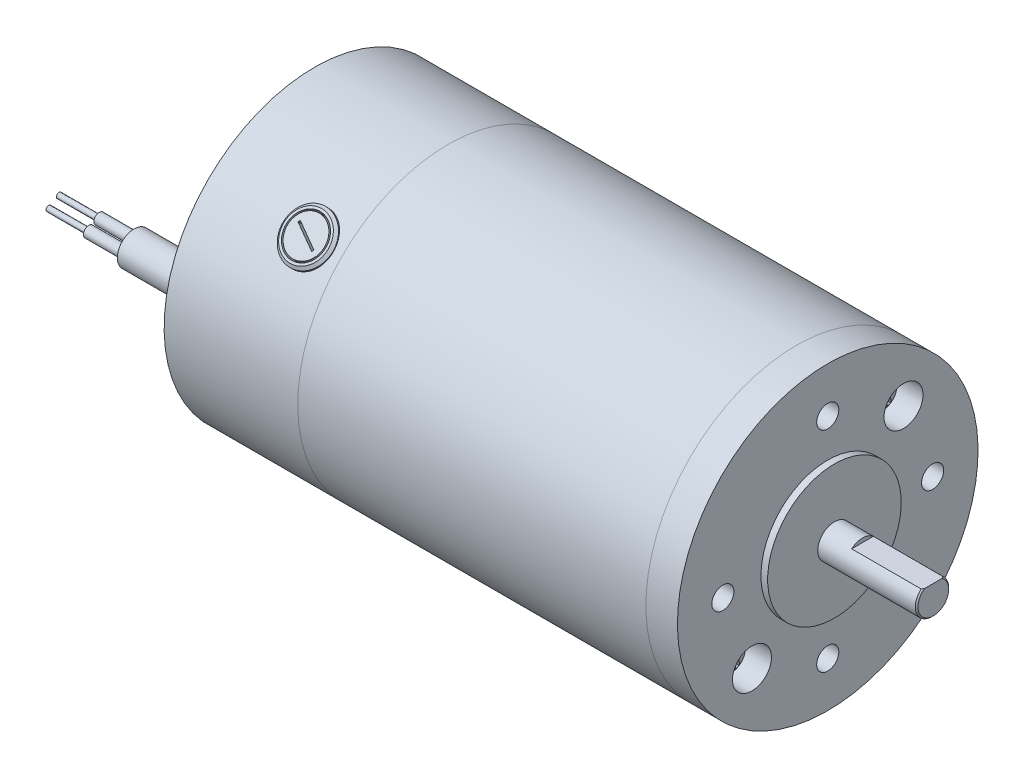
ISO-10303-21;
HEADER;
FILE_DESCRIPTION(('STEP AP214'),'2;1');
FILE_NAME('part.step','',(''),(''),'','','');
FILE_SCHEMA(('AUTOMOTIVE_DESIGN { 1 0 10303 214 1 1 1 1 }'));
ENDSEC;
DATA;
#1=APPLICATION_CONTEXT('core data for automotive mechanical design processes');
#2=APPLICATION_PROTOCOL_DEFINITION('international standard','automotive_design',2000,#1);
#3=PRODUCT_CONTEXT('',#1,'mechanical');
#4=PRODUCT('Part','Part','',(#3));
#5=PRODUCT_RELATED_PRODUCT_CATEGORY('part','',(#4));
#6=PRODUCT_DEFINITION_FORMATION('','',#4);
#7=PRODUCT_DEFINITION_CONTEXT('part definition',#1,'design');
#8=PRODUCT_DEFINITION('design','',#6,#7);
#9=PRODUCT_DEFINITION_SHAPE('','',#8);
#10=(LENGTH_UNIT() NAMED_UNIT(*) SI_UNIT(.MILLI.,.METRE.));
#11=(NAMED_UNIT(*) PLANE_ANGLE_UNIT() SI_UNIT($,.RADIAN.));
#12=(NAMED_UNIT(*) SI_UNIT($,.STERADIAN.) SOLID_ANGLE_UNIT());
#13=UNCERTAINTY_MEASURE_WITH_UNIT(LENGTH_MEASURE(1.E-05),#10,'distance_accuracy_value','');
#14=(GEOMETRIC_REPRESENTATION_CONTEXT(3) GLOBAL_UNCERTAINTY_ASSIGNED_CONTEXT((#13)) GLOBAL_UNIT_ASSIGNED_CONTEXT((#10,
#11,#12)) REPRESENTATION_CONTEXT('',''));
#15=CARTESIAN_POINT('',(0.,0.,0.));
#16=DIRECTION('',(0.,0.,1.));
#17=DIRECTION('',(1.,0.,0.));
#18=AXIS2_PLACEMENT_3D('',#15,#16,#17);
#19=CARTESIAN_POINT('',(81.7723965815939,113.633480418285,-15.9102914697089));
#20=DIRECTION('',(1.,0.,0.));
#21=DIRECTION('',(0.,0.866025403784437,0.500000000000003));
#22=AXIS2_PLACEMENT_3D('',#19,#20,#21);
#23=PLANE('',#22);
#24=CARTESIAN_POINT('',(81.7723965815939,113.633480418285,-15.9102914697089));
#25=DIRECTION('',(1.,0.,0.));
#26=DIRECTION('',(0.,0.866025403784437,0.500000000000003));
#27=AXIS2_PLACEMENT_3D('',#24,#25,#26);
#28=CIRCLE('',#27,6.731);
#29=CARTESIAN_POINT('',(81.7723965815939,116.998980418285,-10.0810744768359));
#30=VERTEX_POINT('',#29);
#31=CARTESIAN_POINT('',(81.7723965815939,110.267980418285,-10.0810744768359));
#32=VERTEX_POINT('',#31);
#33=EDGE_CURVE('P0_E187',#30,#32,#28,.T.);
#34=ORIENTED_EDGE('',*,*,#33,.F.);
#35=DIRECTION('',(0.,-0.866025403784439,0.499999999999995));
#36=VECTOR('',#35,1.);
#37=CARTESIAN_POINT('',(81.7723965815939,120.364480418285,-12.0241468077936));
#38=LINE('',#37,#36);
#39=CARTESIAN_POINT('',(81.7723965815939,113.633480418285,-8.1380021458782));
#40=VERTEX_POINT('',#39);
#41=EDGE_CURVE('P0_E218',#30,#40,#38,.T.);
#42=ORIENTED_EDGE('',*,*,#41,.T.);
#43=DIRECTION('',(0.,-0.866025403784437,-0.500000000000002));
#44=VECTOR('',#43,1.);
#45=CARTESIAN_POINT('',(81.7723965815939,113.633480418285,-8.1380021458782));
#46=LINE('',#45,#44);
#47=EDGE_CURVE('P0_E222',#40,#32,#46,.T.);
#48=ORIENTED_EDGE('',*,*,#47,.T.);
#49=EDGE_LOOP('',(#34,#42,#48));
#50=FACE_BOUND('',#49,.T.);
#51=ADVANCED_FACE('P0_F17',(#50),#23,.T.);
#52=CARTESIAN_POINT('',(81.7723965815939,106.902480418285,-15.910291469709));
#53=VERTEX_POINT('',#52);
#54=EDGE_CURVE('P0_E191',#32,#53,#28,.T.);
#55=ORIENTED_EDGE('',*,*,#54,.F.);
#56=CARTESIAN_POINT('',(81.7723965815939,106.902480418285,-12.0241468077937));
#57=VERTEX_POINT('',#56);
#58=EDGE_CURVE('P0_E221',#32,#57,#46,.T.);
#59=ORIENTED_EDGE('',*,*,#58,.T.);
#60=DIRECTION('',(0.,0.,-0.999999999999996));
#61=VECTOR('',#60,1.);
#62=CARTESIAN_POINT('',(81.7723965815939,106.902480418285,-12.0241468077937));
#63=LINE('',#62,#61);
#64=EDGE_CURVE('P0_E202',#57,#53,#63,.T.);
#65=ORIENTED_EDGE('',*,*,#64,.T.);
#66=EDGE_LOOP('',(#55,#59,#65));
#67=FACE_BOUND('',#66,.T.);
#68=ADVANCED_FACE('P0_F391',(#67),#23,.T.);
#69=CARTESIAN_POINT('',(81.7723965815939,110.267980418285,-21.739508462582));
#70=VERTEX_POINT('',#69);
#71=EDGE_CURVE('P0_E282',#53,#70,#28,.T.);
#72=ORIENTED_EDGE('',*,*,#71,.F.);
#73=CARTESIAN_POINT('',(81.7723965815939,106.902480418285,-19.7964361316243));
#74=VERTEX_POINT('',#73);
#75=EDGE_CURVE('P0_E206',#53,#74,#63,.T.);
#76=ORIENTED_EDGE('',*,*,#75,.T.);
#77=DIRECTION('',(0.,0.866025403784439,-0.499999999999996));
#78=VECTOR('',#77,1.);
#79=CARTESIAN_POINT('',(81.7723965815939,106.902480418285,-19.7964361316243));
#80=LINE('',#79,#78);
#81=EDGE_CURVE('P0_E207',#74,#70,#80,.T.);
#82=ORIENTED_EDGE('',*,*,#81,.T.);
#83=EDGE_LOOP('',(#72,#76,#82));
#84=FACE_BOUND('',#83,.T.);
#85=ADVANCED_FACE('P0_F399',(#84),#23,.T.);
#86=CARTESIAN_POINT('',(81.7723965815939,116.998980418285,-21.739508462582));
#87=VERTEX_POINT('',#86);
#88=EDGE_CURVE('P0_E280',#70,#87,#28,.T.);
#89=ORIENTED_EDGE('',*,*,#88,.F.);
#90=CARTESIAN_POINT('',(81.7723965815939,113.633480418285,-23.6825807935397));
#91=VERTEX_POINT('',#90);
#92=EDGE_CURVE('P0_E205',#70,#91,#80,.T.);
#93=ORIENTED_EDGE('',*,*,#92,.T.);
#94=DIRECTION('',(0.,0.866025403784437,0.500000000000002));
#95=VECTOR('',#94,1.);
#96=CARTESIAN_POINT('',(81.7723965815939,113.633480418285,-23.6825807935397));
#97=LINE('',#96,#95);
#98=EDGE_CURVE('P0_E211',#91,#87,#97,.T.);
#99=ORIENTED_EDGE('',*,*,#98,.T.);
#100=EDGE_LOOP('',(#89,#93,#99));
#101=FACE_BOUND('',#100,.T.);
#102=ADVANCED_FACE('P0_F406',(#101),#23,.T.);
#103=CARTESIAN_POINT('',(81.7723965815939,120.364480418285,-15.9102914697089));
#104=VERTEX_POINT('',#103);
#105=EDGE_CURVE('P0_E277',#87,#104,#28,.T.);
#106=ORIENTED_EDGE('',*,*,#105,.F.);
#107=CARTESIAN_POINT('',(81.7723965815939,120.364480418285,-19.7964361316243));
#108=VERTEX_POINT('',#107);
#109=EDGE_CURVE('P0_E210',#87,#108,#97,.T.);
#110=ORIENTED_EDGE('',*,*,#109,.T.);
#111=DIRECTION('',(0.,0.,0.999999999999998));
#112=VECTOR('',#111,1.);
#113=CARTESIAN_POINT('',(81.7723965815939,120.364480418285,-19.7964361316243));
#114=LINE('',#113,#112);
#115=EDGE_CURVE('P0_E215',#108,#104,#114,.T.);
#116=ORIENTED_EDGE('',*,*,#115,.T.);
#117=EDGE_LOOP('',(#106,#110,#116));
#118=FACE_BOUND('',#117,.T.);
#119=ADVANCED_FACE('P0_F414',(#118),#23,.T.);
#120=CARTESIAN_POINT('',(72.7723965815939,113.633480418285,-15.9102914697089));
#121=DIRECTION('',(-1.,0.,0.));
#122=DIRECTION('',(0.,0.500000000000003,-0.866025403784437));
#123=AXIS2_PLACEMENT_3D('',#120,#121,#122);
#124=CYLINDRICAL_SURFACE('',#123,6.731);
#125=CARTESIAN_POINT('',(72.5183965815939,113.633480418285,-15.9102914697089));
#126=DIRECTION('',(-1.,0.,0.));
#127=DIRECTION('',(0.,0.500000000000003,-0.866025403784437));
#128=AXIS2_PLACEMENT_3D('',#125,#126,#127);
#129=CIRCLE('',#128,6.731);
#130=CARTESIAN_POINT('',(72.5183965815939,116.998980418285,-21.739508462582));
#131=VERTEX_POINT('',#130);
#132=EDGE_CURVE('P0_E21',#131,#131,#129,.F.);
#133=ORIENTED_EDGE('',*,*,#132,.T.);
#134=EDGE_LOOP('',(#133));
#135=FACE_BOUND('',#134,.T.);
#136=CARTESIAN_POINT('',(72.7723965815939,113.633480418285,-15.9102914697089));
#137=DIRECTION('',(-1.,0.,0.));
#138=DIRECTION('',(0.,0.500000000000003,-0.866025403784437));
#139=AXIS2_PLACEMENT_3D('',#136,#137,#138);
#140=CIRCLE('',#139,6.731);
#141=CARTESIAN_POINT('',(72.7723965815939,116.998980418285,-21.739508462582));
#142=VERTEX_POINT('',#141);
#143=CARTESIAN_POINT('',(72.7723965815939,110.267980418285,-21.739508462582));
#144=VERTEX_POINT('',#143);
#145=EDGE_CURVE('P0_E266',#142,#144,#140,.T.);
#146=ORIENTED_EDGE('',*,*,#145,.T.);
#147=CARTESIAN_POINT('',(72.7723965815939,106.902480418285,-15.9102914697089));
#148=VERTEX_POINT('',#147);
#149=EDGE_CURVE('P0_E269',#144,#148,#140,.T.);
#150=ORIENTED_EDGE('',*,*,#149,.T.);
#151=CARTESIAN_POINT('',(72.7723965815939,110.267980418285,-10.0810744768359));
#152=VERTEX_POINT('',#151);
#153=EDGE_CURVE('P0_E435',#148,#152,#140,.T.);
#154=ORIENTED_EDGE('',*,*,#153,.T.);
#155=CARTESIAN_POINT('',(72.7723965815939,116.998980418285,-10.0810744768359));
#156=VERTEX_POINT('',#155);
#157=EDGE_CURVE('P0_E430',#152,#156,#140,.T.);
#158=ORIENTED_EDGE('',*,*,#157,.T.);
#159=CARTESIAN_POINT('',(72.7723965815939,120.364480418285,-15.9102914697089));
#160=VERTEX_POINT('',#159);
#161=EDGE_CURVE('P0_E440',#156,#160,#140,.T.);
#162=ORIENTED_EDGE('',*,*,#161,.T.);
#163=EDGE_CURVE('P0_E265',#160,#142,#140,.T.);
#164=ORIENTED_EDGE('',*,*,#163,.T.);
#165=EDGE_LOOP('',(#146,#150,#154,#158,#162,#164));
#166=FACE_BOUND('',#165,.T.);
#167=ADVANCED_FACE('P0_F436',(#135,#166),#124,.T.);
#168=CARTESIAN_POINT('',(72.5183965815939,113.633480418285,-15.9102914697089));
#169=DIRECTION('',(-1.,0.,0.));
#170=DIRECTION('',(0.,0.500000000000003,-0.866025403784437));
#171=AXIS2_PLACEMENT_3D('',#168,#169,#170);
#172=DEGENERATE_TOROIDAL_SURFACE('',#171,2.921,3.81,.T.);
#173=ORIENTED_EDGE('',*,*,#132,.F.);
#174=EDGE_LOOP('',(#173));
#175=FACE_BOUND('',#174,.T.);
#176=CARTESIAN_POINT('',(68.7083965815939,113.633480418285,-15.9102914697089));
#177=DIRECTION('',(-1.,0.,0.));
#178=DIRECTION('',(0.,0.500000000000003,-0.866025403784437));
#179=AXIS2_PLACEMENT_3D('',#176,#177,#178);
#180=CIRCLE('',#179,2.921);
#181=CARTESIAN_POINT('',(68.7083965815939,115.093980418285,-18.4399516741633));
#182=VERTEX_POINT('',#181);
#183=EDGE_CURVE('P0_E268',#182,#182,#180,.T.);
#184=ORIENTED_EDGE('',*,*,#183,.F.);
#185=EDGE_LOOP('',(#184));
#186=FACE_BOUND('',#185,.T.);
#187=ADVANCED_FACE('P0_F19',(#175,#186),#172,.T.);
#188=CARTESIAN_POINT('',(72.7723965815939,113.633480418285,-15.9102914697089));
#189=DIRECTION('',(1.,0.,0.));
#190=DIRECTION('',(0.,0.866025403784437,0.500000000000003));
#191=AXIS2_PLACEMENT_3D('',#188,#189,#190);
#192=PLANE('',#191);
#193=ORIENTED_EDGE('',*,*,#145,.F.);
#194=DIRECTION('',(0.,0.866025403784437,0.500000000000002));
#195=VECTOR('',#194,1.);
#196=CARTESIAN_POINT('',(72.7723965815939,113.633480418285,-23.6825807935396));
#197=LINE('',#196,#195);
#198=CARTESIAN_POINT('',(72.7723965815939,113.633480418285,-23.6825807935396));
#199=VERTEX_POINT('',#198);
#200=EDGE_CURVE('P0_E234',#199,#142,#197,.T.);
#201=ORIENTED_EDGE('',*,*,#200,.F.);
#202=DIRECTION('',(0.,0.866025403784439,-0.499999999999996));
#203=VECTOR('',#202,1.);
#204=CARTESIAN_POINT('',(72.7723965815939,106.902480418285,-19.7964361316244));
#205=LINE('',#204,#203);
#206=EDGE_CURVE('P0_E229',#144,#199,#205,.T.);
#207=ORIENTED_EDGE('',*,*,#206,.F.);
#208=EDGE_LOOP('',(#193,#201,#207));
#209=FACE_BOUND('',#208,.T.);
#210=ADVANCED_FACE('P0_F460',(#209),#192,.F.);
#211=ORIENTED_EDGE('',*,*,#149,.F.);
#212=CARTESIAN_POINT('',(72.7723965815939,106.902480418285,-19.7964361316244));
#213=VERTEX_POINT('',#212);
#214=EDGE_CURVE('P0_E230',#213,#144,#205,.T.);
#215=ORIENTED_EDGE('',*,*,#214,.F.);
#216=DIRECTION('',(0.,0.,-0.999999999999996));
#217=VECTOR('',#216,1.);
#218=CARTESIAN_POINT('',(72.7723965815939,106.902480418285,-12.0241468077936));
#219=LINE('',#218,#217);
#220=EDGE_CURVE('P0_E199',#148,#213,#219,.T.);
#221=ORIENTED_EDGE('',*,*,#220,.F.);
#222=EDGE_LOOP('',(#211,#215,#221));
#223=FACE_BOUND('',#222,.T.);
#224=ADVANCED_FACE('P0_F538',(#223),#192,.F.);
#225=ORIENTED_EDGE('',*,*,#153,.F.);
#226=CARTESIAN_POINT('',(72.7723965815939,106.902480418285,-12.0241468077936));
#227=VERTEX_POINT('',#226);
#228=EDGE_CURVE('P0_E226',#227,#148,#219,.T.);
#229=ORIENTED_EDGE('',*,*,#228,.F.);
#230=DIRECTION('',(0.,-0.866025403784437,-0.500000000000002));
#231=VECTOR('',#230,1.);
#232=CARTESIAN_POINT('',(72.7723965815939,113.633480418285,-8.13800214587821));
#233=LINE('',#232,#231);
#234=EDGE_CURVE('P0_E244',#152,#227,#233,.T.);
#235=ORIENTED_EDGE('',*,*,#234,.F.);
#236=EDGE_LOOP('',(#225,#229,#235));
#237=FACE_BOUND('',#236,.T.);
#238=ADVANCED_FACE('P0_F456',(#237),#192,.F.);
#239=ORIENTED_EDGE('',*,*,#157,.F.);
#240=CARTESIAN_POINT('',(72.7723965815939,113.633480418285,-8.13800214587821));
#241=VERTEX_POINT('',#240);
#242=EDGE_CURVE('P0_E245',#241,#152,#233,.T.);
#243=ORIENTED_EDGE('',*,*,#242,.F.);
#244=DIRECTION('',(0.,-0.866025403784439,0.499999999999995));
#245=VECTOR('',#244,1.);
#246=CARTESIAN_POINT('',(72.7723965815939,120.364480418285,-12.0241468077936));
#247=LINE('',#246,#245);
#248=EDGE_CURVE('P0_E240',#156,#241,#247,.T.);
#249=ORIENTED_EDGE('',*,*,#248,.F.);
#250=EDGE_LOOP('',(#239,#243,#249));
#251=FACE_BOUND('',#250,.T.);
#252=ADVANCED_FACE('P0_F429',(#251),#192,.F.);
#253=ORIENTED_EDGE('',*,*,#161,.F.);
#254=CARTESIAN_POINT('',(72.7723965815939,120.364480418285,-12.0241468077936));
#255=VERTEX_POINT('',#254);
#256=EDGE_CURVE('P0_E241',#255,#156,#247,.T.);
#257=ORIENTED_EDGE('',*,*,#256,.F.);
#258=DIRECTION('',(0.,0.,0.999999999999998));
#259=VECTOR('',#258,1.);
#260=CARTESIAN_POINT('',(72.7723965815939,120.364480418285,-19.7964361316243));
#261=LINE('',#260,#259);
#262=EDGE_CURVE('P0_E236',#160,#255,#261,.T.);
#263=ORIENTED_EDGE('',*,*,#262,.F.);
#264=EDGE_LOOP('',(#253,#257,#263));
#265=FACE_BOUND('',#264,.T.);
#266=ADVANCED_FACE('P0_F447',(#265),#192,.F.);
#267=CARTESIAN_POINT('',(81.7723965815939,106.902480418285,-12.0241468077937));
#268=DIRECTION('',(0.,0.999999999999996,0.));
#269=DIRECTION('',(0.,0.,-0.999999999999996));
#270=AXIS2_PLACEMENT_3D('',#267,#268,#269);
#271=PLANE('',#270);
#272=ORIENTED_EDGE('',*,*,#228,.T.);
#273=ORIENTED_EDGE('',*,*,#220,.T.);
#274=DIRECTION('',(-1.,0.,0.));
#275=VECTOR('',#274,1.);
#276=CARTESIAN_POINT('',(81.7723965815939,106.902480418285,-19.7964361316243));
#277=LINE('',#276,#275);
#278=EDGE_CURVE('P0_E262',#74,#213,#277,.T.);
#279=ORIENTED_EDGE('',*,*,#278,.F.);
#280=ORIENTED_EDGE('',*,*,#75,.F.);
#281=ORIENTED_EDGE('',*,*,#64,.F.);
#282=DIRECTION('',(-1.,0.,0.));
#283=VECTOR('',#282,1.);
#284=CARTESIAN_POINT('',(81.7723965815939,106.902480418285,-12.0241468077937));
#285=LINE('',#284,#283);
#286=EDGE_CURVE('P0_E225',#57,#227,#285,.T.);
#287=ORIENTED_EDGE('',*,*,#286,.T.);
#288=EDGE_LOOP('',(#272,#273,#279,#280,#281,#287));
#289=FACE_BOUND('',#288,.T.);
#290=ADVANCED_FACE('P0_F394',(#289),#271,.F.);
#291=CARTESIAN_POINT('',(81.7723965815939,106.902480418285,-19.7964361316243));
#292=DIRECTION('',(0.,0.499999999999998,0.86602540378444));
#293=DIRECTION('',(0.,0.86602540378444,-0.499999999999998));
#294=AXIS2_PLACEMENT_3D('',#291,#292,#293);
#295=PLANE('',#294);
#296=ORIENTED_EDGE('',*,*,#214,.T.);
#297=ORIENTED_EDGE('',*,*,#206,.T.);
#298=DIRECTION('',(-1.,0.,0.));
#299=VECTOR('',#298,1.);
#300=CARTESIAN_POINT('',(81.7723965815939,113.633480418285,-23.6825807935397));
#301=LINE('',#300,#299);
#302=EDGE_CURVE('P0_E259',#91,#199,#301,.T.);
#303=ORIENTED_EDGE('',*,*,#302,.F.);
#304=ORIENTED_EDGE('',*,*,#92,.F.);
#305=ORIENTED_EDGE('',*,*,#81,.F.);
#306=ORIENTED_EDGE('',*,*,#278,.T.);
#307=EDGE_LOOP('',(#296,#297,#303,#304,#305,#306));
#308=FACE_BOUND('',#307,.T.);
#309=ADVANCED_FACE('P0_F402',(#308),#295,.F.);
#310=CARTESIAN_POINT('',(81.7723965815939,113.633480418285,-23.6825807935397));
#311=DIRECTION('',(0.,-0.500000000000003,0.866025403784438));
#312=DIRECTION('',(0.,0.866025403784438,0.500000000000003));
#313=AXIS2_PLACEMENT_3D('',#310,#311,#312);
#314=PLANE('',#313);
#315=ORIENTED_EDGE('',*,*,#200,.T.);
#316=CARTESIAN_POINT('',(72.7723965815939,120.364480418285,-19.7964361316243));
#317=VERTEX_POINT('',#316);
#318=EDGE_CURVE('P0_E233',#142,#317,#197,.T.);
#319=ORIENTED_EDGE('',*,*,#318,.T.);
#320=DIRECTION('',(-1.,0.,0.));
#321=VECTOR('',#320,1.);
#322=CARTESIAN_POINT('',(81.7723965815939,120.364480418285,-19.7964361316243));
#323=LINE('',#322,#321);
#324=EDGE_CURVE('P0_E256',#108,#317,#323,.T.);
#325=ORIENTED_EDGE('',*,*,#324,.F.);
#326=ORIENTED_EDGE('',*,*,#109,.F.);
#327=ORIENTED_EDGE('',*,*,#98,.F.);
#328=ORIENTED_EDGE('',*,*,#302,.T.);
#329=EDGE_LOOP('',(#315,#319,#325,#326,#327,#328));
#330=FACE_BOUND('',#329,.T.);
#331=ADVANCED_FACE('P0_F409',(#330),#314,.F.);
#332=CARTESIAN_POINT('',(81.7723965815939,120.364480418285,-19.7964361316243));
#333=DIRECTION('',(0.,-0.999999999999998,0.));
#334=DIRECTION('',(0.,0.,0.999999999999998));
#335=AXIS2_PLACEMENT_3D('',#332,#333,#334);
#336=PLANE('',#335);
#337=EDGE_CURVE('P0_E237',#317,#160,#261,.T.);
#338=ORIENTED_EDGE('',*,*,#337,.T.);
#339=ORIENTED_EDGE('',*,*,#262,.T.);
#340=DIRECTION('',(-1.,0.,0.));
#341=VECTOR('',#340,1.);
#342=CARTESIAN_POINT('',(81.7723965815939,120.364480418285,-12.0241468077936));
#343=LINE('',#342,#341);
#344=CARTESIAN_POINT('',(81.7723965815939,120.364480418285,-12.0241468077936));
#345=VERTEX_POINT('',#344);
#346=EDGE_CURVE('P0_E253',#345,#255,#343,.T.);
#347=ORIENTED_EDGE('',*,*,#346,.F.);
#348=EDGE_CURVE('P0_E214',#104,#345,#114,.T.);
#349=ORIENTED_EDGE('',*,*,#348,.F.);
#350=ORIENTED_EDGE('',*,*,#115,.F.);
#351=ORIENTED_EDGE('',*,*,#324,.T.);
#352=EDGE_LOOP('',(#338,#339,#347,#349,#350,#351));
#353=FACE_BOUND('',#352,.T.);
#354=ADVANCED_FACE('P0_F417',(#353),#336,.F.);
#355=CARTESIAN_POINT('',(81.7723965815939,120.364480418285,-12.0241468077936));
#356=DIRECTION('',(0.,-0.499999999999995,-0.866025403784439));
#357=DIRECTION('',(0.,-0.866025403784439,0.499999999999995));
#358=AXIS2_PLACEMENT_3D('',#355,#356,#357);
#359=PLANE('',#358);
#360=ORIENTED_EDGE('',*,*,#256,.T.);
#361=ORIENTED_EDGE('',*,*,#248,.T.);
#362=DIRECTION('',(-1.,0.,0.));
#363=VECTOR('',#362,1.);
#364=CARTESIAN_POINT('',(81.7723965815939,113.633480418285,-8.1380021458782));
#365=LINE('',#364,#363);
#366=EDGE_CURVE('P0_E250',#40,#241,#365,.T.);
#367=ORIENTED_EDGE('',*,*,#366,.F.);
#368=ORIENTED_EDGE('',*,*,#41,.F.);
#369=EDGE_CURVE('P0_E219',#345,#30,#38,.T.);
#370=ORIENTED_EDGE('',*,*,#369,.F.);
#371=ORIENTED_EDGE('',*,*,#346,.T.);
#372=EDGE_LOOP('',(#360,#361,#367,#368,#370,#371));
#373=FACE_BOUND('',#372,.T.);
#374=ADVANCED_FACE('P0_F424',(#373),#359,.F.);
#375=CARTESIAN_POINT('',(81.7723965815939,113.633480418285,-8.1380021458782));
#376=DIRECTION('',(0.,0.500000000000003,-0.866025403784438));
#377=DIRECTION('',(0.,-0.866025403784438,-0.500000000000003));
#378=AXIS2_PLACEMENT_3D('',#375,#376,#377);
#379=PLANE('',#378);
#380=ORIENTED_EDGE('',*,*,#242,.T.);
#381=ORIENTED_EDGE('',*,*,#234,.T.);
#382=ORIENTED_EDGE('',*,*,#286,.F.);
#383=ORIENTED_EDGE('',*,*,#58,.F.);
#384=ORIENTED_EDGE('',*,*,#47,.F.);
#385=ORIENTED_EDGE('',*,*,#366,.T.);
#386=EDGE_LOOP('',(#380,#381,#382,#383,#384,#385));
#387=FACE_BOUND('',#386,.T.);
#388=ADVANCED_FACE('P0_F386',(#387),#379,.F.);
#389=EDGE_CURVE('P0_E192',#104,#30,#28,.T.);
#390=ORIENTED_EDGE('',*,*,#389,.F.);
#391=ORIENTED_EDGE('',*,*,#348,.T.);
#392=ORIENTED_EDGE('',*,*,#369,.T.);
#393=EDGE_LOOP('',(#390,#391,#392));
#394=FACE_BOUND('',#393,.T.);
#395=ADVANCED_FACE('P0_F422',(#394),#23,.T.);
#396=ORIENTED_EDGE('',*,*,#163,.F.);
#397=ORIENTED_EDGE('',*,*,#337,.F.);
#398=ORIENTED_EDGE('',*,*,#318,.F.);
#399=EDGE_LOOP('',(#396,#397,#398));
#400=FACE_BOUND('',#399,.T.);
#401=ADVANCED_FACE('P0_F377',(#400),#192,.F.);
#402=CARTESIAN_POINT('',(81.8723965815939,113.633480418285,-15.9102914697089));
#403=DIRECTION('',(-1.,0.,0.));
#404=DIRECTION('',(0.,-0.866025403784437,-0.500000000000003));
#405=AXIS2_PLACEMENT_3D('',#402,#403,#404);
#406=CYLINDRICAL_SURFACE('',#405,6.731);
#407=CARTESIAN_POINT('',(81.8723965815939,113.633480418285,-15.9102914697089));
#408=DIRECTION('',(1.,0.,0.));
#409=DIRECTION('',(0.,0.866025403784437,0.500000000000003));
#410=AXIS2_PLACEMENT_3D('',#407,#408,#409);
#411=CIRCLE('',#410,6.731);
#412=CARTESIAN_POINT('',(81.8723965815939,116.998980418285,-10.0810744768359));
#413=VERTEX_POINT('',#412);
#414=CARTESIAN_POINT('',(81.8723965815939,110.267980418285,-10.0810744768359));
#415=VERTEX_POINT('',#414);
#416=EDGE_CURVE('P0_E197',#413,#415,#411,.T.);
#417=ORIENTED_EDGE('',*,*,#416,.F.);
#418=CARTESIAN_POINT('',(81.8723965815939,120.364480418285,-15.9102914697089));
#419=VERTEX_POINT('',#418);
#420=EDGE_CURVE('P0_E34',#419,#413,#411,.T.);
#421=ORIENTED_EDGE('',*,*,#420,.F.);
#422=CARTESIAN_POINT('',(81.8723965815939,116.998980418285,-21.739508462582));
#423=VERTEX_POINT('',#422);
#424=EDGE_CURVE('P0_E38',#423,#419,#411,.T.);
#425=ORIENTED_EDGE('',*,*,#424,.F.);
#426=CARTESIAN_POINT('',(81.8723965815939,110.267980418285,-21.739508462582));
#427=VERTEX_POINT('',#426);
#428=EDGE_CURVE('P0_E347',#427,#423,#411,.T.);
#429=ORIENTED_EDGE('',*,*,#428,.F.);
#430=CARTESIAN_POINT('',(81.8723965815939,106.902480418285,-15.910291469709));
#431=VERTEX_POINT('',#430);
#432=EDGE_CURVE('P0_E362',#431,#427,#411,.T.);
#433=ORIENTED_EDGE('',*,*,#432,.F.);
#434=EDGE_CURVE('P0_E200',#415,#431,#411,.T.);
#435=ORIENTED_EDGE('',*,*,#434,.F.);
#436=EDGE_LOOP('',(#417,#421,#425,#429,#433,#435));
#437=FACE_BOUND('',#436,.T.);
#438=ORIENTED_EDGE('',*,*,#33,.T.);
#439=ORIENTED_EDGE('',*,*,#54,.T.);
#440=ORIENTED_EDGE('',*,*,#71,.T.);
#441=ORIENTED_EDGE('',*,*,#88,.T.);
#442=ORIENTED_EDGE('',*,*,#105,.T.);
#443=ORIENTED_EDGE('',*,*,#389,.T.);
#444=EDGE_LOOP('',(#438,#439,#440,#441,#442,#443));
#445=FACE_BOUND('',#444,.T.);
#446=ADVANCED_FACE('P0_F375',(#437,#445),#406,.T.);
#447=CARTESIAN_POINT('',(81.8723965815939,113.633480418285,-15.9102914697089));
#448=DIRECTION('',(1.,0.,0.));
#449=DIRECTION('',(0.,-0.500000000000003,0.866025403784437));
#450=AXIS2_PLACEMENT_3D('',#447,#448,#449);
#451=PLANE('',#450);
#452=DIRECTION('',(0.,-0.866025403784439,0.499999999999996));
#453=VECTOR('',#452,1.);
#454=CARTESIAN_POINT('',(81.8723965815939,120.364480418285,-12.0241468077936));
#455=LINE('',#454,#453);
#456=CARTESIAN_POINT('',(81.8723965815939,113.633480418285,-8.13800214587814));
#457=VERTEX_POINT('',#456);
#458=EDGE_CURVE('P0_E322',#413,#457,#455,.T.);
#459=ORIENTED_EDGE('',*,*,#458,.F.);
#460=ORIENTED_EDGE('',*,*,#416,.T.);
#461=DIRECTION('',(0.,-0.866025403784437,-0.500000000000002));
#462=VECTOR('',#461,1.);
#463=CARTESIAN_POINT('',(81.8723965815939,113.633480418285,-8.13800214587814));
#464=LINE('',#463,#462);
#465=EDGE_CURVE('P0_E180',#457,#415,#464,.T.);
#466=ORIENTED_EDGE('',*,*,#465,.F.);
#467=EDGE_LOOP('',(#459,#460,#466));
#468=FACE_BOUND('',#467,.T.);
#469=ADVANCED_FACE('P0_F374',(#468),#451,.F.);
#470=CARTESIAN_POINT('',(81.8723965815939,106.902480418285,-12.0241468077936));
#471=VERTEX_POINT('',#470);
#472=EDGE_CURVE('P0_E326',#415,#471,#464,.T.);
#473=ORIENTED_EDGE('',*,*,#472,.F.);
#474=ORIENTED_EDGE('',*,*,#434,.T.);
#475=DIRECTION('',(0.,0.,-0.999999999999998));
#476=VECTOR('',#475,1.);
#477=CARTESIAN_POINT('',(81.8723965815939,106.902480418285,-12.0241468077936));
#478=LINE('',#477,#476);
#479=EDGE_CURVE('P0_E309',#471,#431,#478,.T.);
#480=ORIENTED_EDGE('',*,*,#479,.F.);
#481=EDGE_LOOP('',(#473,#474,#480));
#482=FACE_BOUND('',#481,.T.);
#483=ADVANCED_FACE('P0_F368',(#482),#451,.F.);
#484=CARTESIAN_POINT('',(81.8723965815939,106.902480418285,-19.7964361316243));
#485=VERTEX_POINT('',#484);
#486=EDGE_CURVE('P0_E185',#431,#485,#478,.T.);
#487=ORIENTED_EDGE('',*,*,#486,.F.);
#488=ORIENTED_EDGE('',*,*,#432,.T.);
#489=DIRECTION('',(0.,0.86602540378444,-0.499999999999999));
#490=VECTOR('',#489,1.);
#491=CARTESIAN_POINT('',(81.8723965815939,106.902480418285,-19.7964361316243));
#492=LINE('',#491,#490);
#493=EDGE_CURVE('P0_E312',#485,#427,#492,.T.);
#494=ORIENTED_EDGE('',*,*,#493,.F.);
#495=EDGE_LOOP('',(#487,#488,#494));
#496=FACE_BOUND('',#495,.T.);
#497=ADVANCED_FACE('P0_F369',(#496),#451,.F.);
#498=CARTESIAN_POINT('',(81.8723965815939,113.633480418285,-23.6825807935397));
#499=VERTEX_POINT('',#498);
#500=EDGE_CURVE('P0_E311',#427,#499,#492,.T.);
#501=ORIENTED_EDGE('',*,*,#500,.F.);
#502=ORIENTED_EDGE('',*,*,#428,.T.);
#503=DIRECTION('',(0.,0.866025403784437,0.500000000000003));
#504=VECTOR('',#503,1.);
#505=CARTESIAN_POINT('',(81.8723965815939,113.633480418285,-23.6825807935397));
#506=LINE('',#505,#504);
#507=EDGE_CURVE('P0_E315',#499,#423,#506,.T.);
#508=ORIENTED_EDGE('',*,*,#507,.F.);
#509=EDGE_LOOP('',(#501,#502,#508));
#510=FACE_BOUND('',#509,.T.);
#511=ADVANCED_FACE('P0_F360',(#510),#451,.F.);
#512=CARTESIAN_POINT('',(81.8723965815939,120.364480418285,-19.7964361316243));
#513=VERTEX_POINT('',#512);
#514=EDGE_CURVE('P0_E314',#423,#513,#506,.T.);
#515=ORIENTED_EDGE('',*,*,#514,.F.);
#516=ORIENTED_EDGE('',*,*,#424,.T.);
#517=DIRECTION('',(0.,0.,0.999999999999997));
#518=VECTOR('',#517,1.);
#519=CARTESIAN_POINT('',(81.8723965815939,120.364480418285,-19.7964361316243));
#520=LINE('',#519,#518);
#521=EDGE_CURVE('P0_E319',#513,#419,#520,.T.);
#522=ORIENTED_EDGE('',*,*,#521,.F.);
#523=EDGE_LOOP('',(#515,#516,#522));
#524=FACE_BOUND('',#523,.T.);
#525=ADVANCED_FACE('P0_F345',(#524),#451,.F.);
#526=CARTESIAN_POINT('',(81.8723965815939,120.364480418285,-12.0241468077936));
#527=VERTEX_POINT('',#526);
#528=EDGE_CURVE('P0_E318',#419,#527,#520,.T.);
#529=ORIENTED_EDGE('',*,*,#528,.F.);
#530=ORIENTED_EDGE('',*,*,#420,.T.);
#531=EDGE_CURVE('P0_E323',#527,#413,#455,.T.);
#532=ORIENTED_EDGE('',*,*,#531,.F.);
#533=EDGE_LOOP('',(#529,#530,#532));
#534=FACE_BOUND('',#533,.T.);
#535=ADVANCED_FACE('P0_F350',(#534),#451,.F.);
#536=CARTESIAN_POINT('',(91.8723965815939,106.902480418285,-12.0241468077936));
#537=DIRECTION('',(0.,0.999999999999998,0.));
#538=DIRECTION('',(0.,0.,-0.999999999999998));
#539=AXIS2_PLACEMENT_3D('',#536,#537,#538);
#540=PLANE('',#539);
#541=ORIENTED_EDGE('',*,*,#479,.T.);
#542=ORIENTED_EDGE('',*,*,#486,.T.);
#543=DIRECTION('',(-1.,0.,0.));
#544=VECTOR('',#543,1.);
#545=CARTESIAN_POINT('',(91.8723965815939,106.902480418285,-19.7964361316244));
#546=LINE('',#545,#544);
#547=CARTESIAN_POINT('',(91.8723965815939,106.902480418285,-19.7964361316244));
#548=VERTEX_POINT('',#547);
#549=EDGE_CURVE('P0_E165',#548,#485,#546,.T.);
#550=ORIENTED_EDGE('',*,*,#549,.F.);
#551=DIRECTION('',(0.,0.,-0.999999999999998));
#552=VECTOR('',#551,1.);
#553=CARTESIAN_POINT('',(91.8723965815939,106.902480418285,-12.0241468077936));
#554=LINE('',#553,#552);
#555=CARTESIAN_POINT('',(91.8723965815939,106.902480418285,-12.0241468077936));
#556=VERTEX_POINT('',#555);
#557=EDGE_CURVE('P0_E171',#556,#548,#554,.T.);
#558=ORIENTED_EDGE('',*,*,#557,.F.);
#559=DIRECTION('',(-1.,0.,0.));
#560=VECTOR('',#559,1.);
#561=CARTESIAN_POINT('',(91.8723965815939,106.902480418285,-12.0241468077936));
#562=LINE('',#561,#560);
#563=EDGE_CURVE('P0_E308',#556,#471,#562,.T.);
#564=ORIENTED_EDGE('',*,*,#563,.T.);
#565=EDGE_LOOP('',(#541,#542,#550,#558,#564));
#566=FACE_BOUND('',#565,.T.);
#567=ADVANCED_FACE('P0_F183',(#566),#540,.F.);
#568=CARTESIAN_POINT('',(91.8723965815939,106.902480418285,-19.7964361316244));
#569=DIRECTION('',(0.,0.499999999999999,0.86602540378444));
#570=DIRECTION('',(0.,0.86602540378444,-0.499999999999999));
#571=AXIS2_PLACEMENT_3D('',#568,#569,#570);
#572=PLANE('',#571);
#573=ORIENTED_EDGE('',*,*,#493,.T.);
#574=ORIENTED_EDGE('',*,*,#500,.T.);
#575=DIRECTION('',(-1.,0.,0.));
#576=VECTOR('',#575,1.);
#577=CARTESIAN_POINT('',(91.872396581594,113.633480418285,-23.6825807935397));
#578=LINE('',#577,#576);
#579=CARTESIAN_POINT('',(91.872396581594,113.633480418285,-23.6825807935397));
#580=VERTEX_POINT('',#579);
#581=EDGE_CURVE('P0_E167',#580,#499,#578,.T.);
#582=ORIENTED_EDGE('',*,*,#581,.F.);
#583=DIRECTION('',(0.,0.86602540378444,-0.499999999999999));
#584=VECTOR('',#583,1.);
#585=CARTESIAN_POINT('',(91.8723965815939,106.902480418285,-19.7964361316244));
#586=LINE('',#585,#584);
#587=EDGE_CURVE('P0_E160',#548,#580,#586,.T.);
#588=ORIENTED_EDGE('',*,*,#587,.F.);
#589=ORIENTED_EDGE('',*,*,#549,.T.);
#590=EDGE_LOOP('',(#573,#574,#582,#588,#589));
#591=FACE_BOUND('',#590,.T.);
#592=ADVANCED_FACE('P0_F163',(#591),#572,.F.);
#593=CARTESIAN_POINT('',(91.872396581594,113.633480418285,-23.6825807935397));
#594=DIRECTION('',(0.,-0.500000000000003,0.866025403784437));
#595=DIRECTION('',(-1.,0.,0.));
#596=AXIS2_PLACEMENT_3D('',#593,#594,#595);
#597=PLANE('',#596);
#598=ORIENTED_EDGE('',*,*,#507,.T.);
#599=ORIENTED_EDGE('',*,*,#514,.T.);
#600=DIRECTION('',(-1.,0.,0.));
#601=VECTOR('',#600,1.);
#602=CARTESIAN_POINT('',(91.8723965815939,120.364480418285,-19.7964361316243));
#603=LINE('',#602,#601);
#604=CARTESIAN_POINT('',(91.8723965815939,120.364480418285,-19.7964361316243));
#605=VERTEX_POINT('',#604);
#606=EDGE_CURVE('P0_E193',#605,#513,#603,.T.);
#607=ORIENTED_EDGE('',*,*,#606,.F.);
#608=DIRECTION('',(0.,0.866025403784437,0.500000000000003));
#609=VECTOR('',#608,1.);
#610=CARTESIAN_POINT('',(91.872396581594,113.633480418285,-23.6825807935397));
#611=LINE('',#610,#609);
#612=EDGE_CURVE('P0_E170',#580,#605,#611,.T.);
#613=ORIENTED_EDGE('',*,*,#612,.F.);
#614=ORIENTED_EDGE('',*,*,#581,.T.);
#615=EDGE_LOOP('',(#598,#599,#607,#613,#614));
#616=FACE_BOUND('',#615,.T.);
#617=ADVANCED_FACE('P0_F356',(#616),#597,.F.);
#618=CARTESIAN_POINT('',(91.8723965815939,120.364480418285,-19.7964361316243));
#619=DIRECTION('',(0.,-0.999999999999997,0.));
#620=DIRECTION('',(0.,0.,0.999999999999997));
#621=AXIS2_PLACEMENT_3D('',#618,#619,#620);
#622=PLANE('',#621);
#623=ORIENTED_EDGE('',*,*,#521,.T.);
#624=ORIENTED_EDGE('',*,*,#528,.T.);
#625=DIRECTION('',(-1.,0.,0.));
#626=VECTOR('',#625,1.);
#627=CARTESIAN_POINT('',(91.8723965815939,120.364480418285,-12.0241468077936));
#628=LINE('',#627,#626);
#629=CARTESIAN_POINT('',(91.8723965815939,120.364480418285,-12.0241468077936));
#630=VERTEX_POINT('',#629);
#631=EDGE_CURVE('P0_E333',#630,#527,#628,.T.);
#632=ORIENTED_EDGE('',*,*,#631,.F.);
#633=DIRECTION('',(0.,0.,0.999999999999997));
#634=VECTOR('',#633,1.);
#635=CARTESIAN_POINT('',(91.8723965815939,120.364480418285,-19.7964361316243));
#636=LINE('',#635,#634);
#637=EDGE_CURVE('P0_E303',#605,#630,#636,.T.);
#638=ORIENTED_EDGE('',*,*,#637,.F.);
#639=ORIENTED_EDGE('',*,*,#606,.T.);
#640=EDGE_LOOP('',(#623,#624,#632,#638,#639));
#641=FACE_BOUND('',#640,.T.);
#642=ADVANCED_FACE('P0_F340',(#641),#622,.F.);
#643=CARTESIAN_POINT('',(91.8723965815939,120.364480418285,-12.0241468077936));
#644=DIRECTION('',(0.,-0.499999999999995,-0.866025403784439));
#645=DIRECTION('',(0.,-0.866025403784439,0.499999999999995));
#646=AXIS2_PLACEMENT_3D('',#643,#644,#645);
#647=PLANE('',#646);
#648=ORIENTED_EDGE('',*,*,#531,.T.);
#649=ORIENTED_EDGE('',*,*,#458,.T.);
#650=DIRECTION('',(-1.,0.,0.));
#651=VECTOR('',#650,1.);
#652=CARTESIAN_POINT('',(91.8723965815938,113.633480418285,-8.13800214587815));
#653=LINE('',#652,#651);
#654=CARTESIAN_POINT('',(91.8723965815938,113.633480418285,-8.13800214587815));
#655=VERTEX_POINT('',#654);
#656=EDGE_CURVE('P0_E330',#655,#457,#653,.T.);
#657=ORIENTED_EDGE('',*,*,#656,.F.);
#658=DIRECTION('',(0.,-0.866025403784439,0.499999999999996));
#659=VECTOR('',#658,1.);
#660=CARTESIAN_POINT('',(91.8723965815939,120.364480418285,-12.0241468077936));
#661=LINE('',#660,#659);
#662=EDGE_CURVE('P0_E305',#630,#655,#661,.T.);
#663=ORIENTED_EDGE('',*,*,#662,.F.);
#664=ORIENTED_EDGE('',*,*,#631,.T.);
#665=EDGE_LOOP('',(#648,#649,#657,#663,#664));
#666=FACE_BOUND('',#665,.T.);
#667=ADVANCED_FACE('P0_F354',(#666),#647,.F.);
#668=CARTESIAN_POINT('',(91.8723965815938,113.633480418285,-8.13800214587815));
#669=DIRECTION('',(0.,0.500000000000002,-0.866025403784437));
#670=DIRECTION('',(0.,-0.866025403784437,-0.500000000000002));
#671=AXIS2_PLACEMENT_3D('',#668,#669,#670);
#672=PLANE('',#671);
#673=ORIENTED_EDGE('',*,*,#465,.T.);
#674=ORIENTED_EDGE('',*,*,#472,.T.);
#675=ORIENTED_EDGE('',*,*,#563,.F.);
#676=DIRECTION('',(0.,-0.866025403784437,-0.500000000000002));
#677=VECTOR('',#676,1.);
#678=CARTESIAN_POINT('',(91.8723965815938,113.633480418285,-8.13800214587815));
#679=LINE('',#678,#677);
#680=EDGE_CURVE('P0_E176',#655,#556,#679,.T.);
#681=ORIENTED_EDGE('',*,*,#680,.F.);
#682=ORIENTED_EDGE('',*,*,#656,.T.);
#683=EDGE_LOOP('',(#673,#674,#675,#681,#682));
#684=FACE_BOUND('',#683,.T.);
#685=ADVANCED_FACE('P0_F371',(#684),#672,.F.);
#686=CARTESIAN_POINT('',(91.8723965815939,113.633480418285,-15.9102914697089));
#687=DIRECTION('',(1.,0.,0.));
#688=DIRECTION('',(0.,-0.500000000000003,0.866025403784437));
#689=AXIS2_PLACEMENT_3D('',#686,#687,#688);
#690=PLANE('',#689);
#691=ORIENTED_EDGE('',*,*,#557,.T.);
#692=ORIENTED_EDGE('',*,*,#587,.T.);
#693=ORIENTED_EDGE('',*,*,#612,.T.);
#694=ORIENTED_EDGE('',*,*,#637,.T.);
#695=ORIENTED_EDGE('',*,*,#662,.T.);
#696=ORIENTED_EDGE('',*,*,#680,.T.);
#697=EDGE_LOOP('',(#691,#692,#693,#694,#695,#696));
#698=FACE_BOUND('',#697,.T.);
#699=ADVANCED_FACE('P0_F174',(#698),#690,.T.);
#700=CARTESIAN_POINT('',(56.0083965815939,113.633480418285,-15.9102914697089));
#701=DIRECTION('',(1.,0.,0.));
#702=DIRECTION('',(0.,-0.500000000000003,0.866025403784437));
#703=AXIS2_PLACEMENT_3D('',#700,#701,#702);
#704=CYLINDRICAL_SURFACE('',#703,3.175);
#705=CARTESIAN_POINT('',(56.0083965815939,113.633480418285,-15.9102914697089));
#706=DIRECTION('',(-1.,0.,0.));
#707=DIRECTION('',(0.,0.500000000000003,-0.866025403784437));
#708=AXIS2_PLACEMENT_3D('',#705,#706,#707);
#709=CIRCLE('',#708,3.175);
#710=CARTESIAN_POINT('',(56.0083965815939,115.220980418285,-18.6599221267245));
#711=VERTEX_POINT('',#710);
#712=EDGE_CURVE('P0_E296',#711,#711,#709,.T.);
#713=ORIENTED_EDGE('',*,*,#712,.F.);
#714=EDGE_LOOP('',(#713));
#715=FACE_BOUND('',#714,.T.);
#716=CARTESIAN_POINT('',(68.7083965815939,113.633480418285,-15.9102914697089));
#717=DIRECTION('',(-1.,0.,0.));
#718=DIRECTION('',(0.,0.500000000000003,-0.866025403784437));
#719=AXIS2_PLACEMENT_3D('',#716,#717,#718);
#720=CIRCLE('',#719,3.175);
#721=CARTESIAN_POINT('',(68.7083965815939,115.220980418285,-18.6599221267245));
#722=VERTEX_POINT('',#721);
#723=EDGE_CURVE('P0_E299',#722,#722,#720,.T.);
#724=ORIENTED_EDGE('',*,*,#723,.T.);
#725=EDGE_LOOP('',(#724));
#726=FACE_BOUND('',#725,.T.);
#727=ADVANCED_FACE('P0_F725',(#715,#726),#704,.T.);
#728=CARTESIAN_POINT('',(56.0083965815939,113.633480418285,-15.9102914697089));
#729=DIRECTION('',(-1.,0.,0.));
#730=DIRECTION('',(0.,0.500000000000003,-0.866025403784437));
#731=AXIS2_PLACEMENT_3D('',#728,#729,#730);
#732=PLANE('',#731);
#733=CARTESIAN_POINT('',(56.0083965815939,114.204980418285,-16.9001585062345));
#734=DIRECTION('',(-1.,0.,0.));
#735=DIRECTION('',(0.,0.500000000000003,-0.866025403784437));
#736=AXIS2_PLACEMENT_3D('',#733,#734,#735);
#737=CIRCLE('',#736,1.016);
#738=CARTESIAN_POINT('',(56.0083965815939,113.696980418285,-16.0202766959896));
#739=VERTEX_POINT('',#738);
#740=EDGE_CURVE('P0_E906',#739,#739,#737,.T.);
#741=ORIENTED_EDGE('',*,*,#740,.F.);
#742=EDGE_LOOP('',(#741));
#743=FACE_BOUND('',#742,.T.);
#744=CARTESIAN_POINT('',(56.0083965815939,113.061980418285,-14.9204244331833));
#745=DIRECTION('',(-1.,0.,0.));
#746=DIRECTION('',(0.,0.500000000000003,-0.866025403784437));
#747=AXIS2_PLACEMENT_3D('',#744,#745,#746);
#748=CIRCLE('',#747,1.016);
#749=CARTESIAN_POINT('',(56.0083965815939,112.553980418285,-14.0405426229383));
#750=VERTEX_POINT('',#749);
#751=EDGE_CURVE('P0_E285',#750,#750,#748,.T.);
#752=ORIENTED_EDGE('',*,*,#751,.F.);
#753=EDGE_LOOP('',(#752));
#754=FACE_BOUND('',#753,.T.);
#755=ORIENTED_EDGE('',*,*,#712,.T.);
#756=EDGE_LOOP('',(#755));
#757=FACE_BOUND('',#756,.T.);
#758=ADVANCED_FACE('P0_F734',(#743,#754,#757),#732,.T.);
#759=CARTESIAN_POINT('',(68.7083965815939,113.633480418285,-15.9102914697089));
#760=DIRECTION('',(-1.,0.,0.));
#761=DIRECTION('',(0.,0.500000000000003,-0.866025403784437));
#762=AXIS2_PLACEMENT_3D('',#759,#760,#761);
#763=PLANE('',#762);
#764=ORIENTED_EDGE('',*,*,#183,.T.);
#765=EDGE_LOOP('',(#764));
#766=FACE_BOUND('',#765,.T.);
#767=ORIENTED_EDGE('',*,*,#723,.F.);
#768=EDGE_LOOP('',(#767));
#769=FACE_BOUND('',#768,.T.);
#770=ADVANCED_FACE('P0_F744',(#766,#769),#763,.F.);
#771=CARTESIAN_POINT('',(48.3883965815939,113.061980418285,-14.9204244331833));
#772=DIRECTION('',(1.,0.,0.));
#773=DIRECTION('',(0.,-0.500000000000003,0.866025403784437));
#774=AXIS2_PLACEMENT_3D('',#771,#772,#773);
#775=CYLINDRICAL_SURFACE('',#774,1.016);
#776=CARTESIAN_POINT('',(48.3883965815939,113.061980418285,-14.9204244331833));
#777=DIRECTION('',(-1.,0.,0.));
#778=DIRECTION('',(0.,0.500000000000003,-0.866025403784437));
#779=AXIS2_PLACEMENT_3D('',#776,#777,#778);
#780=CIRCLE('',#779,1.016);
#781=CARTESIAN_POINT('',(48.3883965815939,112.553980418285,-14.0405426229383));
#782=VERTEX_POINT('',#781);
#783=EDGE_CURVE('P0_E294',#782,#782,#780,.T.);
#784=CARTESIAN_POINT('',(48.3883965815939,112.553980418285,-14.0405426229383));
#785=CARTESIAN_POINT('',(48.4677715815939,112.553980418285,-14.0405426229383));
#786=CARTESIAN_POINT('',(48.5471465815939,112.553980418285,-14.0405426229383));
#787=CARTESIAN_POINT('',(48.7058965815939,112.553980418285,-14.0405426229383));
#788=CARTESIAN_POINT('',(48.7852715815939,112.553980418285,-14.0405426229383));
#789=CARTESIAN_POINT('',(48.9440215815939,112.553980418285,-14.0405426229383));
#790=CARTESIAN_POINT('',(49.0233965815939,112.553980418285,-14.0405426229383));
#791=CARTESIAN_POINT('',(49.1821465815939,112.553980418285,-14.0405426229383));
#792=CARTESIAN_POINT('',(49.2615215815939,112.553980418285,-14.0405426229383));
#793=CARTESIAN_POINT('',(49.4202715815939,112.553980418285,-14.0405426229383));
#794=CARTESIAN_POINT('',(49.4996465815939,112.553980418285,-14.0405426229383));
#795=CARTESIAN_POINT('',(49.6583965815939,112.553980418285,-14.0405426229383));
#796=CARTESIAN_POINT('',(49.7377715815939,112.553980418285,-14.0405426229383));
#797=CARTESIAN_POINT('',(49.8965215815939,112.553980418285,-14.0405426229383));
#798=CARTESIAN_POINT('',(49.9758965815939,112.553980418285,-14.0405426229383));
#799=CARTESIAN_POINT('',(50.1346465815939,112.553980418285,-14.0405426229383));
#800=CARTESIAN_POINT('',(50.2140215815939,112.553980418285,-14.0405426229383));
#801=CARTESIAN_POINT('',(50.3727715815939,112.553980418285,-14.0405426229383));
#802=CARTESIAN_POINT('',(50.4521465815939,112.553980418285,-14.0405426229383));
#803=CARTESIAN_POINT('',(50.6108965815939,112.553980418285,-14.0405426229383));
#804=CARTESIAN_POINT('',(50.6902715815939,112.553980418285,-14.0405426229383));
#805=CARTESIAN_POINT('',(50.8490215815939,112.553980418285,-14.0405426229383));
#806=CARTESIAN_POINT('',(50.9283965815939,112.553980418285,-14.0405426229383));
#807=CARTESIAN_POINT('',(51.0871465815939,112.553980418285,-14.0405426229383));
#808=CARTESIAN_POINT('',(51.1665215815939,112.553980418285,-14.0405426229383));
#809=CARTESIAN_POINT('',(51.3252715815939,112.553980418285,-14.0405426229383));
#810=CARTESIAN_POINT('',(51.4046465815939,112.553980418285,-14.0405426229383));
#811=CARTESIAN_POINT('',(51.5633965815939,112.553980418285,-14.0405426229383));
#812=CARTESIAN_POINT('',(51.6427715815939,112.553980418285,-14.0405426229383));
#813=CARTESIAN_POINT('',(51.8015215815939,112.553980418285,-14.0405426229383));
#814=CARTESIAN_POINT('',(51.8808965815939,112.553980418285,-14.0405426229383));
#815=CARTESIAN_POINT('',(52.0396465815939,112.553980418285,-14.0405426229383));
#816=CARTESIAN_POINT('',(52.1190215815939,112.553980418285,-14.0405426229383));
#817=CARTESIAN_POINT('',(52.2777715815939,112.553980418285,-14.0405426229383));
#818=CARTESIAN_POINT('',(52.3571465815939,112.553980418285,-14.0405426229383));
#819=CARTESIAN_POINT('',(52.5158965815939,112.553980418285,-14.0405426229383));
#820=CARTESIAN_POINT('',(52.5952715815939,112.553980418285,-14.0405426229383));
#821=CARTESIAN_POINT('',(52.7540215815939,112.553980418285,-14.0405426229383));
#822=CARTESIAN_POINT('',(52.8333965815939,112.553980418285,-14.0405426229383));
#823=CARTESIAN_POINT('',(52.9921465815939,112.553980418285,-14.0405426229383));
#824=CARTESIAN_POINT('',(53.0715215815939,112.553980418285,-14.0405426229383));
#825=CARTESIAN_POINT('',(53.2302715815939,112.553980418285,-14.0405426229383));
#826=CARTESIAN_POINT('',(53.3096465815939,112.553980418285,-14.0405426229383));
#827=CARTESIAN_POINT('',(53.4683965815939,112.553980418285,-14.0405426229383));
#828=CARTESIAN_POINT('',(53.5477715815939,112.553980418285,-14.0405426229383));
#829=CARTESIAN_POINT('',(53.7065215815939,112.553980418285,-14.0405426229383));
#830=CARTESIAN_POINT('',(53.7858965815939,112.553980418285,-14.0405426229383));
#831=CARTESIAN_POINT('',(53.9446465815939,112.553980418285,-14.0405426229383));
#832=CARTESIAN_POINT('',(54.0240215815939,112.553980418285,-14.0405426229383));
#833=CARTESIAN_POINT('',(54.1827715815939,112.553980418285,-14.0405426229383));
#834=CARTESIAN_POINT('',(54.2621465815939,112.553980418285,-14.0405426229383));
#835=CARTESIAN_POINT('',(54.4208965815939,112.553980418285,-14.0405426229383));
#836=CARTESIAN_POINT('',(54.5002715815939,112.553980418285,-14.0405426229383));
#837=CARTESIAN_POINT('',(54.6590215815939,112.553980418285,-14.0405426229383));
#838=CARTESIAN_POINT('',(54.7383965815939,112.553980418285,-14.0405426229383));
#839=CARTESIAN_POINT('',(54.8971465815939,112.553980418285,-14.0405426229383));
#840=CARTESIAN_POINT('',(54.9765215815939,112.553980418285,-14.0405426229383));
#841=CARTESIAN_POINT('',(55.1352715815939,112.553980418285,-14.0405426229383));
#842=CARTESIAN_POINT('',(55.2146465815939,112.553980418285,-14.0405426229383));
#843=CARTESIAN_POINT('',(55.3733965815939,112.553980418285,-14.0405426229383));
#844=CARTESIAN_POINT('',(55.4527715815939,112.553980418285,-14.0405426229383));
#845=CARTESIAN_POINT('',(55.6115215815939,112.553980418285,-14.0405426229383));
#846=CARTESIAN_POINT('',(55.6908965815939,112.553980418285,-14.0405426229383));
#847=CARTESIAN_POINT('',(55.8496465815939,112.553980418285,-14.0405426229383));
#848=CARTESIAN_POINT('',(55.9290215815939,112.553980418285,-14.0405426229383));
#849=CARTESIAN_POINT('',(56.0083965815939,112.553980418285,-14.0405426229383));
#850=B_SPLINE_CURVE_WITH_KNOTS('',3,(#784,#785,#786,#787,#788,#789,#790,#791,#792,#793,#794,
#795,#796,#797,#798,#799,#800,#801,#802,#803,#804,#805,#806,#807,#808,#809,#810,#811,#812,#813,
#814,#815,#816,#817,#818,#819,#820,#821,#822,#823,#824,#825,#826,#827,#828,#829,#830,#831,#832,
#833,#834,#835,#836,#837,#838,#839,#840,#841,#842,#843,#844,#845,#846,#847,#848,#849),
.UNSPECIFIED.,.F.,.F.,(4,2,2,2,2,2,2,2,2,2,2,2,2,2,2,2,2,2,2,2,2,2,2,2,2,2,2,2,2,2,2,2,4),(0.,
0.238125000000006,0.476250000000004,0.714375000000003,0.952500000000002,1.190625,1.42875,
1.666875,1.905,2.143125,2.38125,2.619375,2.8575,3.095625,3.33375,3.571875,3.81,4.048125,4.28625,
4.524375,4.7625,5.00062499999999,5.23874999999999,5.47687499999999,5.715,5.953125,6.19125,
6.42937499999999,6.66749999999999,6.90562499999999,7.14374999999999,7.381875,7.61999999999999),.UNSPECIFIED.);
#851=EDGE_CURVE('P0_BSEAM754',#782,#750,#850,.T.);
#852=ORIENTED_EDGE('',*,*,#783,.F.);
#853=ORIENTED_EDGE('',*,*,#751,.T.);
#854=ORIENTED_EDGE('',*,*,#851,.T.);
#855=ORIENTED_EDGE('',*,*,#851,.F.);
#856=EDGE_LOOP('',(#852,#854,#853,#855));
#857=FACE_BOUND('',#856,.T.);
#858=ADVANCED_FACE('P0_F754',(#857),#775,.T.);
#859=CARTESIAN_POINT('',(48.3883965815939,113.061980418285,-14.9204244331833));
#860=DIRECTION('',(-1.,0.,0.));
#861=DIRECTION('',(0.,0.500000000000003,-0.866025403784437));
#862=AXIS2_PLACEMENT_3D('',#859,#860,#861);
#863=PLANE('',#862);
#864=CARTESIAN_POINT('',(48.3883965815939,113.061980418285,-14.9204244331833));
#865=DIRECTION('',(-1.,0.,0.));
#866=DIRECTION('',(0.,0.500000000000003,-0.866025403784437));
#867=AXIS2_PLACEMENT_3D('',#864,#865,#866);
#868=CIRCLE('',#867,0.508);
#869=CARTESIAN_POINT('',(48.3883965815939,113.315980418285,-15.3603653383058));
#870=VERTEX_POINT('',#869);
#871=EDGE_CURVE('P0_E26',#870,#870,#868,.T.);
#872=ORIENTED_EDGE('',*,*,#871,.F.);
#873=EDGE_LOOP('',(#872));
#874=FACE_BOUND('',#873,.T.);
#875=ORIENTED_EDGE('',*,*,#783,.T.);
#876=EDGE_LOOP('',(#875));
#877=FACE_BOUND('',#876,.T.);
#878=ADVANCED_FACE('P0_F763',(#874,#877),#863,.T.);
#879=CARTESIAN_POINT('',(48.3883965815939,114.204980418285,-16.9001585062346));
#880=DIRECTION('',(1.,0.,0.));
#881=DIRECTION('',(0.,-0.500000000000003,0.866025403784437));
#882=AXIS2_PLACEMENT_3D('',#879,#880,#881);
#883=CYLINDRICAL_SURFACE('',#882,1.016);
#884=CARTESIAN_POINT('',(48.3883965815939,114.204980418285,-16.9001585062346));
#885=DIRECTION('',(-1.,0.,0.));
#886=DIRECTION('',(0.,0.500000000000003,-0.866025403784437));
#887=AXIS2_PLACEMENT_3D('',#884,#885,#886);
#888=CIRCLE('',#887,1.016);
#889=CARTESIAN_POINT('',(48.3883965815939,113.696980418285,-16.0202766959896));
#890=VERTEX_POINT('',#889);
#891=EDGE_CURVE('P0_E909',#890,#890,#888,.T.);
#892=CARTESIAN_POINT('',(48.3883965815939,113.696980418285,-16.0202766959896));
#893=CARTESIAN_POINT('',(48.4677715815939,113.696980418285,-16.0202766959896));
#894=CARTESIAN_POINT('',(48.5471465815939,113.696980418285,-16.0202766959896));
#895=CARTESIAN_POINT('',(48.7058965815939,113.696980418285,-16.0202766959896));
#896=CARTESIAN_POINT('',(48.7852715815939,113.696980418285,-16.0202766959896));
#897=CARTESIAN_POINT('',(48.9440215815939,113.696980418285,-16.0202766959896));
#898=CARTESIAN_POINT('',(49.0233965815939,113.696980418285,-16.0202766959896));
#899=CARTESIAN_POINT('',(49.1821465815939,113.696980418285,-16.0202766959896));
#900=CARTESIAN_POINT('',(49.2615215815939,113.696980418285,-16.0202766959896));
#901=CARTESIAN_POINT('',(49.4202715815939,113.696980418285,-16.0202766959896));
#902=CARTESIAN_POINT('',(49.4996465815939,113.696980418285,-16.0202766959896));
#903=CARTESIAN_POINT('',(49.6583965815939,113.696980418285,-16.0202766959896));
#904=CARTESIAN_POINT('',(49.7377715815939,113.696980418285,-16.0202766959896));
#905=CARTESIAN_POINT('',(49.8965215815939,113.696980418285,-16.0202766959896));
#906=CARTESIAN_POINT('',(49.9758965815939,113.696980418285,-16.0202766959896));
#907=CARTESIAN_POINT('',(50.1346465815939,113.696980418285,-16.0202766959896));
#908=CARTESIAN_POINT('',(50.2140215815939,113.696980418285,-16.0202766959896));
#909=CARTESIAN_POINT('',(50.3727715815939,113.696980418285,-16.0202766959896));
#910=CARTESIAN_POINT('',(50.4521465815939,113.696980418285,-16.0202766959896));
#911=CARTESIAN_POINT('',(50.6108965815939,113.696980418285,-16.0202766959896));
#912=CARTESIAN_POINT('',(50.6902715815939,113.696980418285,-16.0202766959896));
#913=CARTESIAN_POINT('',(50.8490215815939,113.696980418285,-16.0202766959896));
#914=CARTESIAN_POINT('',(50.9283965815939,113.696980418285,-16.0202766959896));
#915=CARTESIAN_POINT('',(51.0871465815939,113.696980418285,-16.0202766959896));
#916=CARTESIAN_POINT('',(51.1665215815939,113.696980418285,-16.0202766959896));
#917=CARTESIAN_POINT('',(51.3252715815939,113.696980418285,-16.0202766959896));
#918=CARTESIAN_POINT('',(51.4046465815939,113.696980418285,-16.0202766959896));
#919=CARTESIAN_POINT('',(51.5633965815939,113.696980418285,-16.0202766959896));
#920=CARTESIAN_POINT('',(51.6427715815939,113.696980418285,-16.0202766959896));
#921=CARTESIAN_POINT('',(51.8015215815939,113.696980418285,-16.0202766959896));
#922=CARTESIAN_POINT('',(51.8808965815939,113.696980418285,-16.0202766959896));
#923=CARTESIAN_POINT('',(52.0396465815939,113.696980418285,-16.0202766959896));
#924=CARTESIAN_POINT('',(52.1190215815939,113.696980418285,-16.0202766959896));
#925=CARTESIAN_POINT('',(52.2777715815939,113.696980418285,-16.0202766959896));
#926=CARTESIAN_POINT('',(52.3571465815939,113.696980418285,-16.0202766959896));
#927=CARTESIAN_POINT('',(52.5158965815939,113.696980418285,-16.0202766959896));
#928=CARTESIAN_POINT('',(52.5952715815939,113.696980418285,-16.0202766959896));
#929=CARTESIAN_POINT('',(52.7540215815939,113.696980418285,-16.0202766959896));
#930=CARTESIAN_POINT('',(52.8333965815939,113.696980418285,-16.0202766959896));
#931=CARTESIAN_POINT('',(52.9921465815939,113.696980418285,-16.0202766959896));
#932=CARTESIAN_POINT('',(53.0715215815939,113.696980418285,-16.0202766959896));
#933=CARTESIAN_POINT('',(53.2302715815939,113.696980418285,-16.0202766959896));
#934=CARTESIAN_POINT('',(53.3096465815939,113.696980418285,-16.0202766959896));
#935=CARTESIAN_POINT('',(53.4683965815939,113.696980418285,-16.0202766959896));
#936=CARTESIAN_POINT('',(53.5477715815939,113.696980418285,-16.0202766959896));
#937=CARTESIAN_POINT('',(53.7065215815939,113.696980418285,-16.0202766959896));
#938=CARTESIAN_POINT('',(53.7858965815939,113.696980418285,-16.0202766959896));
#939=CARTESIAN_POINT('',(53.9446465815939,113.696980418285,-16.0202766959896));
#940=CARTESIAN_POINT('',(54.0240215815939,113.696980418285,-16.0202766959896));
#941=CARTESIAN_POINT('',(54.1827715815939,113.696980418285,-16.0202766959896));
#942=CARTESIAN_POINT('',(54.2621465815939,113.696980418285,-16.0202766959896));
#943=CARTESIAN_POINT('',(54.4208965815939,113.696980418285,-16.0202766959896));
#944=CARTESIAN_POINT('',(54.5002715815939,113.696980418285,-16.0202766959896));
#945=CARTESIAN_POINT('',(54.6590215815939,113.696980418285,-16.0202766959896));
#946=CARTESIAN_POINT('',(54.7383965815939,113.696980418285,-16.0202766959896));
#947=CARTESIAN_POINT('',(54.8971465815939,113.696980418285,-16.0202766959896));
#948=CARTESIAN_POINT('',(54.9765215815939,113.696980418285,-16.0202766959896));
#949=CARTESIAN_POINT('',(55.1352715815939,113.696980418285,-16.0202766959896));
#950=CARTESIAN_POINT('',(55.2146465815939,113.696980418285,-16.0202766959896));
#951=CARTESIAN_POINT('',(55.3733965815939,113.696980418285,-16.0202766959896));
#952=CARTESIAN_POINT('',(55.4527715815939,113.696980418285,-16.0202766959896));
#953=CARTESIAN_POINT('',(55.6115215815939,113.696980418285,-16.0202766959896));
#954=CARTESIAN_POINT('',(55.6908965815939,113.696980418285,-16.0202766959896));
#955=CARTESIAN_POINT('',(55.8496465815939,113.696980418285,-16.0202766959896));
#956=CARTESIAN_POINT('',(55.9290215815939,113.696980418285,-16.0202766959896));
#957=CARTESIAN_POINT('',(56.0083965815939,113.696980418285,-16.0202766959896));
#958=B_SPLINE_CURVE_WITH_KNOTS('',3,(#892,#893,#894,#895,#896,#897,#898,#899,#900,#901,#902,
#903,#904,#905,#906,#907,#908,#909,#910,#911,#912,#913,#914,#915,#916,#917,#918,#919,#920,#921,
#922,#923,#924,#925,#926,#927,#928,#929,#930,#931,#932,#933,#934,#935,#936,#937,#938,#939,#940,
#941,#942,#943,#944,#945,#946,#947,#948,#949,#950,#951,#952,#953,#954,#955,#956,#957),
.UNSPECIFIED.,.F.,.F.,(4,2,2,2,2,2,2,2,2,2,2,2,2,2,2,2,2,2,2,2,2,2,2,2,2,2,2,2,2,2,2,2,4),(0.,
0.238125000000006,0.476250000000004,0.714375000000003,0.952500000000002,1.190625,1.42875,
1.666875,1.905,2.143125,2.38125,2.619375,2.8575,3.095625,3.33375,3.571875,3.81,4.048125,4.28625,
4.524375,4.7625,5.00062499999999,5.23874999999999,5.47687499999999,5.715,5.953125,6.19125,
6.42937499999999,6.66749999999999,6.90562499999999,7.14374999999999,7.381875,7.61999999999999),.UNSPECIFIED.);
#959=EDGE_CURVE('P0_BSEAM772',#890,#739,#958,.T.);
#960=ORIENTED_EDGE('',*,*,#891,.F.);
#961=ORIENTED_EDGE('',*,*,#740,.T.);
#962=ORIENTED_EDGE('',*,*,#959,.T.);
#963=ORIENTED_EDGE('',*,*,#959,.F.);
#964=EDGE_LOOP('',(#960,#962,#961,#963));
#965=FACE_BOUND('',#964,.T.);
#966=ADVANCED_FACE('P0_F772',(#965),#883,.T.);
#967=CARTESIAN_POINT('',(48.3883965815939,114.204980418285,-16.9001585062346));
#968=DIRECTION('',(-1.,0.,0.));
#969=DIRECTION('',(0.,0.500000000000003,-0.866025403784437));
#970=AXIS2_PLACEMENT_3D('',#967,#968,#969);
#971=PLANE('',#970);
#972=CARTESIAN_POINT('',(48.3883965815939,114.204980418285,-16.9001585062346));
#973=DIRECTION('',(-1.,0.,0.));
#974=DIRECTION('',(0.,0.500000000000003,-0.866025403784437));
#975=AXIS2_PLACEMENT_3D('',#972,#973,#974);
#976=CIRCLE('',#975,0.508);
#977=CARTESIAN_POINT('',(48.3883965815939,114.458980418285,-17.3400994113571));
#978=VERTEX_POINT('',#977);
#979=EDGE_CURVE('P0_E11',#978,#978,#976,.T.);
#980=ORIENTED_EDGE('',*,*,#979,.F.);
#981=EDGE_LOOP('',(#980));
#982=FACE_BOUND('',#981,.T.);
#983=ORIENTED_EDGE('',*,*,#891,.T.);
#984=EDGE_LOOP('',(#983));
#985=FACE_BOUND('',#984,.T.);
#986=ADVANCED_FACE('P0_F781',(#982,#985),#971,.T.);
#987=CARTESIAN_POINT('',(40.7683965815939,113.061980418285,-14.9204244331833));
#988=DIRECTION('',(1.,0.,0.));
#989=DIRECTION('',(0.,-0.500000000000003,0.866025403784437));
#990=AXIS2_PLACEMENT_3D('',#987,#988,#989);
#991=CYLINDRICAL_SURFACE('',#990,0.508);
#992=CARTESIAN_POINT('',(40.7683965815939,113.061980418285,-14.9204244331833));
#993=DIRECTION('',(-1.,0.,0.));
#994=DIRECTION('',(0.,0.500000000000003,-0.866025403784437));
#995=AXIS2_PLACEMENT_3D('',#992,#993,#994);
#996=CIRCLE('',#995,0.508);
#997=CARTESIAN_POINT('',(40.7683965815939,113.315980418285,-15.3603653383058));
#998=VERTEX_POINT('',#997);
#999=EDGE_CURVE('P0_E903',#998,#998,#996,.T.);
#1000=ORIENTED_EDGE('',*,*,#999,.F.);
#1001=EDGE_LOOP('',(#1000));
#1002=FACE_BOUND('',#1001,.T.);
#1003=ORIENTED_EDGE('',*,*,#871,.T.);
#1004=EDGE_LOOP('',(#1003));
#1005=FACE_BOUND('',#1004,.T.);
#1006=ADVANCED_FACE('P0_F790',(#1002,#1005),#991,.T.);
#1007=CARTESIAN_POINT('',(40.7683965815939,113.061980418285,-14.9204244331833));
#1008=DIRECTION('',(-1.,0.,0.));
#1009=DIRECTION('',(0.,0.500000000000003,-0.866025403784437));
#1010=AXIS2_PLACEMENT_3D('',#1007,#1008,#1009);
#1011=PLANE('',#1010);
#1012=ORIENTED_EDGE('',*,*,#999,.T.);
#1013=EDGE_LOOP('',(#1012));
#1014=FACE_BOUND('',#1013,.T.);
#1015=ADVANCED_FACE('P0_F799',(#1014),#1011,.T.);
#1016=CARTESIAN_POINT('',(40.7683965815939,114.204980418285,-16.9001585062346));
#1017=DIRECTION('',(1.,0.,0.));
#1018=DIRECTION('',(0.,-0.500000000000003,0.866025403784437));
#1019=AXIS2_PLACEMENT_3D('',#1016,#1017,#1018);
#1020=CYLINDRICAL_SURFACE('',#1019,0.508);
#1021=CARTESIAN_POINT('',(40.7683965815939,114.204980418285,-16.9001585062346));
#1022=DIRECTION('',(-1.,0.,0.));
#1023=DIRECTION('',(0.,0.500000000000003,-0.866025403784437));
#1024=AXIS2_PLACEMENT_3D('',#1021,#1022,#1023);
#1025=CIRCLE('',#1024,0.508);
#1026=CARTESIAN_POINT('',(40.7683965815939,114.458980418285,-17.3400994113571));
#1027=VERTEX_POINT('',#1026);
#1028=EDGE_CURVE('P0_E902',#1027,#1027,#1025,.T.);
#1029=ORIENTED_EDGE('',*,*,#1028,.F.);
#1030=EDGE_LOOP('',(#1029));
#1031=FACE_BOUND('',#1030,.T.);
#1032=ORIENTED_EDGE('',*,*,#979,.T.);
#1033=EDGE_LOOP('',(#1032));
#1034=FACE_BOUND('',#1033,.T.);
#1035=ADVANCED_FACE('P0_F808',(#1031,#1034),#1020,.T.);
#1036=CARTESIAN_POINT('',(40.7683965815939,114.204980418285,-16.9001585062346));
#1037=DIRECTION('',(-1.,0.,0.));
#1038=DIRECTION('',(0.,0.500000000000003,-0.866025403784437));
#1039=AXIS2_PLACEMENT_3D('',#1036,#1037,#1038);
#1040=PLANE('',#1039);
#1041=ORIENTED_EDGE('',*,*,#1028,.T.);
#1042=EDGE_LOOP('',(#1041));
#1043=FACE_BOUND('',#1042,.T.);
#1044=ADVANCED_FACE('P0_F817',(#1043),#1040,.T.);
#1045=CLOSED_SHELL('',(#51,#68,#85,#102,#119,#167,#187,#210,#224,#238,#252,#266,#290,#309,#331,
#354,#374,#388,#395,#401,#446,#469,#483,#497,#511,#525,#535,#567,#592,#617,#642,#667,#685,#699,
#727,#758,#770,#858,#878,#966,#986,#1006,#1015,#1035,#1044));
#1046=MANIFOLD_SOLID_BREP('P0_B1',#1045);
#1047=CARTESIAN_POINT('',(207.962396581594,131.993015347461,-15.9102914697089));
#1048=DIRECTION('',(-1.,0.,0.));
#1049=DIRECTION('',(0.,0.,1.));
#1050=AXIS2_PLACEMENT_3D('',#1047,#1048,#1049);
#1051=CYLINDRICAL_SURFACE('',#1050,3.175);
#1052=CARTESIAN_POINT('',(187.892396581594,131.993015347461,-15.9102914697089));
#1053=DIRECTION('',(1.,0.,0.));
#1054=DIRECTION('',(0.,0.,-1.));
#1055=AXIS2_PLACEMENT_3D('',#1052,#1053,#1054);
#1056=CIRCLE('',#1055,3.175);
#1057=CARTESIAN_POINT('',(187.892396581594,131.993015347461,-19.0852914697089));
#1058=VERTEX_POINT('',#1057);
#1059=EDGE_CURVE('P1_E57',#1058,#1058,#1056,.T.);
#1060=ORIENTED_EDGE('',*,*,#1059,.T.);
#1061=EDGE_LOOP('',(#1060));
#1062=FACE_BOUND('',#1061,.T.);
#1063=DIRECTION('',(-1.,0.,0.));
#1064=VECTOR('',#1063,1.);
#1065=CARTESIAN_POINT('',(207.962396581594,134.408015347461,-17.9714561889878));
#1066=LINE('',#1065,#1064);
#1067=CARTESIAN_POINT('',(207.708396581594,134.408015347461,-17.9714561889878));
#1068=VERTEX_POINT('',#1067);
#1069=CARTESIAN_POINT('',(194.502396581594,134.408015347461,-17.9714561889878));
#1070=VERTEX_POINT('',#1069);
#1071=EDGE_CURVE('P1_E51',#1068,#1070,#1066,.T.);
#1072=ORIENTED_EDGE('',*,*,#1071,.F.);
#1073=CARTESIAN_POINT('',(207.708396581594,131.993015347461,-15.9102914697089));
#1074=DIRECTION('',(1.,0.,0.));
#1075=DIRECTION('',(0.,0.,-1.));
#1076=AXIS2_PLACEMENT_3D('',#1073,#1074,#1075);
#1077=CIRCLE('',#1076,3.175);
#1078=CARTESIAN_POINT('',(207.708396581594,134.408015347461,-13.84912675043));
#1079=VERTEX_POINT('',#1078);
#1080=EDGE_CURVE('P1_E70',#1068,#1079,#1077,.F.);
#1081=ORIENTED_EDGE('',*,*,#1080,.T.);
#1082=DIRECTION('',(-1.,0.,0.));
#1083=VECTOR('',#1082,1.);
#1084=CARTESIAN_POINT('',(207.962396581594,134.408015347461,-13.84912675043));
#1085=LINE('',#1084,#1083);
#1086=CARTESIAN_POINT('',(194.502396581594,134.408015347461,-13.84912675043));
#1087=VERTEX_POINT('',#1086);
#1088=EDGE_CURVE('P1_E33',#1087,#1079,#1085,.F.);
#1089=ORIENTED_EDGE('',*,*,#1088,.F.);
#1090=CARTESIAN_POINT('',(194.502396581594,131.993015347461,-15.9102914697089));
#1091=DIRECTION('',(1.,0.,0.));
#1092=DIRECTION('',(0.,0.,-1.));
#1093=AXIS2_PLACEMENT_3D('',#1090,#1091,#1092);
#1094=CIRCLE('',#1093,3.175);
#1095=EDGE_CURVE('P1_E11',#1070,#1087,#1094,.T.);
#1096=ORIENTED_EDGE('',*,*,#1095,.F.);
#1097=EDGE_LOOP('',(#1072,#1081,#1089,#1096));
#1098=FACE_BOUND('',#1097,.T.);
#1099=ADVANCED_FACE('P1_F17',(#1062,#1098),#1051,.T.);
#1100=CARTESIAN_POINT('',(207.962396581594,131.993015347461,-15.9102914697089));
#1101=DIRECTION('',(1.,0.,0.));
#1102=DIRECTION('',(0.,0.,-1.));
#1103=AXIS2_PLACEMENT_3D('',#1100,#1101,#1102);
#1104=PLANE('',#1103);
#1105=CARTESIAN_POINT('',(207.962396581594,131.993015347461,-15.9102914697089));
#1106=DIRECTION('',(1.,0.,0.));
#1107=DIRECTION('',(0.,0.,-1.));
#1108=AXIS2_PLACEMENT_3D('',#1105,#1106,#1107);
#1109=CIRCLE('',#1108,2.921);
#1110=CARTESIAN_POINT('',(207.962396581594,134.408015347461,-14.2671189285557));
#1111=VERTEX_POINT('',#1110);
#1112=CARTESIAN_POINT('',(207.962396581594,134.408015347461,-17.5534640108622));
#1113=VERTEX_POINT('',#1112);
#1114=EDGE_CURVE('P1_E67',#1111,#1113,#1109,.T.);
#1115=ORIENTED_EDGE('',*,*,#1114,.T.);
#1116=DIRECTION('',(0.,0.,-1.));
#1117=VECTOR('',#1116,1.);
#1118=CARTESIAN_POINT('',(207.962396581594,134.408015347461,-12.7352914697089));
#1119=LINE('',#1118,#1117);
#1120=EDGE_CURVE('P1_E60',#1111,#1113,#1119,.T.);
#1121=ORIENTED_EDGE('',*,*,#1120,.F.);
#1122=EDGE_LOOP('',(#1115,#1121));
#1123=FACE_BOUND('',#1122,.T.);
#1124=ADVANCED_FACE('P1_F82',(#1123),#1104,.T.);
#1125=CARTESIAN_POINT('',(207.962396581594,131.993015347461,-15.9102914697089));
#1126=DIRECTION('',(-1.,0.,0.));
#1127=DIRECTION('',(0.,0.,1.));
#1128=AXIS2_PLACEMENT_3D('',#1125,#1126,#1127);
#1129=CONICAL_SURFACE('',#1128,2.921,0.785398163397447);
#1130=ORIENTED_EDGE('',*,*,#1080,.F.);
#1131=CARTESIAN_POINT('',(203.895149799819,134.408015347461,-22.4679868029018));
#1132=CARTESIAN_POINT('',(204.087142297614,134.408015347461,-22.2633289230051));
#1133=CARTESIAN_POINT('',(204.278624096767,134.408015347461,-22.0581845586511));
#1134=CARTESIAN_POINT('',(204.66018423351,134.408015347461,-21.6463495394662));
#1135=CARTESIAN_POINT('',(204.850261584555,134.408015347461,-21.4396579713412));
#1136=CARTESIAN_POINT('',(205.232752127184,134.408015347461,-21.019618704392));
#1137=CARTESIAN_POINT('',(205.425117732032,134.408015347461,-20.8062275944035));
#1138=CARTESIAN_POINT('',(205.806715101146,134.408015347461,-20.3768597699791));
#1139=CARTESIAN_POINT('',(205.995948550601,134.408015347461,-20.1608845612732));
#1140=CARTESIAN_POINT('',(206.276348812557,134.408015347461,-19.8340342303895));
#1141=CARTESIAN_POINT('',(206.369222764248,134.408015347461,-19.7246245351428));
#1142=CARTESIAN_POINT('',(206.553536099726,134.408015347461,-19.504604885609));
#1143=CARTESIAN_POINT('',(206.644975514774,134.408015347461,-19.3939949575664));
#1144=CARTESIAN_POINT('',(206.826202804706,134.408015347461,-19.1710913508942));
#1145=CARTESIAN_POINT('',(206.915987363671,134.408015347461,-19.0587949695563));
#1146=CARTESIAN_POINT('',(207.093186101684,134.408015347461,-18.8323532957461));
#1147=CARTESIAN_POINT('',(207.180600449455,134.408015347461,-18.7182081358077));
#1148=CARTESIAN_POINT('',(207.351516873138,134.408015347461,-18.4886197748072));
#1149=CARTESIAN_POINT('',(207.435047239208,134.408015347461,-18.373197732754));
#1150=CARTESIAN_POINT('',(207.597968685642,134.408015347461,-18.139384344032));
#1151=CARTESIAN_POINT('',(207.677358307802,134.408015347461,-18.0209919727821));
#1152=CARTESIAN_POINT('',(207.830091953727,134.408015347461,-17.7808562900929));
#1153=CARTESIAN_POINT('',(207.90345399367,134.408015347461,-17.6591245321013));
#1154=CARTESIAN_POINT('',(208.041916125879,134.408015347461,-17.4110839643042));
#1155=CARTESIAN_POINT('',(208.107023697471,134.408015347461,-17.2847794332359));
#1156=CARTESIAN_POINT('',(208.200181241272,134.408015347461,-17.0815081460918));
#1157=CARTESIAN_POINT('',(208.232223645,134.408015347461,-17.0063770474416));
#1158=CARTESIAN_POINT('',(208.291439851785,134.408015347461,-16.8541835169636));
#1159=CARTESIAN_POINT('',(208.318612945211,134.408015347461,-16.777120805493));
#1160=CARTESIAN_POINT('',(208.366908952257,134.408015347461,-16.6215679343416));
#1161=CARTESIAN_POINT('',(208.38806469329,134.408015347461,-16.5430881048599));
#1162=CARTESIAN_POINT('',(208.423472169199,134.408015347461,-16.3845923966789));
#1163=CARTESIAN_POINT('',(208.437726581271,134.408015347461,-16.3045771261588));
#1164=CARTESIAN_POINT('',(208.458627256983,134.408015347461,-16.1423287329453));
#1165=CARTESIAN_POINT('',(208.465157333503,134.408015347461,-16.0600803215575));
#1166=CARTESIAN_POINT('',(208.469753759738,134.408015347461,-15.8953519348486));
#1167=CARTESIAN_POINT('',(208.467821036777,134.408015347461,-15.8128719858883));
#1168=CARTESIAN_POINT('',(208.455616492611,134.408015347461,-15.6482754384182));
#1169=CARTESIAN_POINT('',(208.445317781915,134.408015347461,-15.5661608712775));
#1170=CARTESIAN_POINT('',(208.417052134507,134.408015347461,-15.4032655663));
#1171=CARTESIAN_POINT('',(208.399082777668,134.408015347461,-15.3224852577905));
#1172=CARTESIAN_POINT('',(208.349570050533,134.408015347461,-15.1366779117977));
#1173=CARTESIAN_POINT('',(208.315511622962,134.408015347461,-15.0323259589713));
#1174=CARTESIAN_POINT('',(208.238302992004,134.408015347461,-14.8270722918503));
#1175=CARTESIAN_POINT('',(208.195147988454,134.408015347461,-14.7261724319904));
#1176=CARTESIAN_POINT('',(208.101436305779,134.408015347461,-14.5264762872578));
#1177=CARTESIAN_POINT('',(208.050799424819,134.408015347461,-14.4277180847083));
#1178=CARTESIAN_POINT('',(207.970908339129,134.408015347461,-14.2817914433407));
#1179=CARTESIAN_POINT('',(207.943625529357,134.408015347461,-14.2335233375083));
#1180=CARTESIAN_POINT('',(207.887910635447,134.408015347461,-14.1376573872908));
#1181=CARTESIAN_POINT('',(207.859478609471,134.408015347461,-14.0900595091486));
#1182=CARTESIAN_POINT('',(207.759861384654,134.408015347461,-13.9272055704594));
#1183=CARTESIAN_POINT('',(207.686203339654,134.408015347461,-13.8134602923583));
#1184=CARTESIAN_POINT('',(207.534597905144,134.408015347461,-13.5888526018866));
#1185=CARTESIAN_POINT('',(207.456649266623,134.408015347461,-13.4779910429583));
#1186=CARTESIAN_POINT('',(207.297505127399,134.408015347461,-13.258479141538));
#1187=CARTESIAN_POINT('',(207.216306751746,134.408015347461,-13.1498308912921));
#1188=CARTESIAN_POINT('',(207.051493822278,134.408015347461,-12.9343777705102));
#1189=CARTESIAN_POINT('',(206.967879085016,134.408015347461,-12.8275730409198));
#1190=CARTESIAN_POINT('',(206.798433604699,134.408015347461,-12.615017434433));
#1191=CARTESIAN_POINT('',(206.71259513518,134.408015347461,-12.5092727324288));
#1192=CARTESIAN_POINT('',(206.539429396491,134.408015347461,-12.299007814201));
#1193=CARTESIAN_POINT('',(206.452102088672,134.408015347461,-12.1944876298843));
#1194=CARTESIAN_POINT('',(206.188448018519,134.408015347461,-11.8825449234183));
#1195=CARTESIAN_POINT('',(206.010351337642,134.408015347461,-11.6766190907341));
#1196=CARTESIAN_POINT('',(205.672166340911,134.408015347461,-11.2916272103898));
#1197=CARTESIAN_POINT('',(205.512426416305,134.408015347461,-11.112253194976));
#1198=CARTESIAN_POINT('',(205.191113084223,134.408015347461,-10.7551050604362));
#1199=CARTESIAN_POINT('',(205.029539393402,134.408015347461,-10.5773311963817));
#1200=CARTESIAN_POINT('',(204.706392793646,134.408015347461,-10.2245078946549));
#1201=CARTESIAN_POINT('',(204.544831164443,134.408015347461,-10.0494481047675));
#1202=CARTESIAN_POINT('',(204.220690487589,134.408015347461,-9.70033697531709));
#1203=CARTESIAN_POINT('',(204.058111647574,134.408015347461,-9.52628544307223));
#1204=CARTESIAN_POINT('',(203.895149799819,134.408015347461,-9.35259613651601));
#1205=B_SPLINE_CURVE_WITH_KNOTS('',3,(#1131,#1132,#1133,#1134,#1135,#1136,#1137,#1138,#1139,
#1140,#1141,#1142,#1143,#1144,#1145,#1146,#1147,#1148,#1149,#1150,#1151,#1152,#1153,#1154,#1155,
#1156,#1157,#1158,#1159,#1160,#1161,#1162,#1163,#1164,#1165,#1166,#1167,#1168,#1169,#1170,#1171,
#1172,#1173,#1174,#1175,#1176,#1177,#1178,#1179,#1180,#1181,#1182,#1183,#1184,#1185,#1186,#1187,
#1188,#1189,#1190,#1191,#1192,#1193,#1194,#1195,#1196,#1197,#1198,#1199,#1200,#1201,#1202,#1203,
#1204),.UNSPECIFIED.,.F.,.F.,(4,2,2,2,2,2,2,2,2,2,2,2,2,2,2,2,2,2,2,2,2,2,2,2,2,2,2,2,2,2,2,2,2,
2,2,2,4),(0.,0.841858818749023,1.68426147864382,2.54613898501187,3.40753662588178,
3.83806716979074,4.26858831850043,4.69989458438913,5.13117006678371,5.55853443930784,
5.98604831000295,6.41223398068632,6.83803068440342,7.08293385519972,7.32787268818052,
7.57144844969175,7.8149296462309,8.0620284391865,8.3091001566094,8.55696915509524,
8.80491641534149,9.13364656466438,9.46255061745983,9.79527763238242,9.96160119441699,
10.1279163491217,10.5342979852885,10.9407985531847,11.3476670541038,11.7545665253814,
12.1631466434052,12.5717373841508,13.38845193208,14.1090135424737,14.8296880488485,
15.544339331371,16.2588492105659),.UNSPECIFIED.);
#1206=EDGE_CURVE('P1_E26',#1068,#1113,#1205,.T.);
#1207=ORIENTED_EDGE('',*,*,#1206,.T.);
#1208=ORIENTED_EDGE('',*,*,#1114,.F.);
#1209=EDGE_CURVE('P1_E71',#1111,#1079,#1205,.T.);
#1210=ORIENTED_EDGE('',*,*,#1209,.T.);
#1211=EDGE_LOOP('',(#1130,#1207,#1208,#1210));
#1212=FACE_BOUND('',#1211,.T.);
#1213=ADVANCED_FACE('P1_F19',(#1212),#1129,.T.);
#1214=CARTESIAN_POINT('',(187.892396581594,131.993015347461,-15.9102914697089));
#1215=DIRECTION('',(1.,0.,0.));
#1216=DIRECTION('',(0.,0.,-1.));
#1217=AXIS2_PLACEMENT_3D('',#1214,#1215,#1216);
#1218=PLANE('',#1217);
#1219=ORIENTED_EDGE('',*,*,#1059,.F.);
#1220=EDGE_LOOP('',(#1219));
#1221=FACE_BOUND('',#1220,.T.);
#1222=ADVANCED_FACE('P1_F81',(#1221),#1218,.F.);
#1223=CARTESIAN_POINT('',(194.502396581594,135.168015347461,-19.0852914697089));
#1224=DIRECTION('',(1.,0.,0.));
#1225=DIRECTION('',(0.,0.,-1.));
#1226=AXIS2_PLACEMENT_3D('',#1223,#1224,#1225);
#1227=PLANE('',#1226);
#1228=DIRECTION('',(0.,0.,1.));
#1229=VECTOR('',#1228,1.);
#1230=CARTESIAN_POINT('',(194.502396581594,134.408015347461,-19.0852914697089));
#1231=LINE('',#1230,#1229);
#1232=EDGE_CURVE('P1_E56',#1070,#1087,#1231,.T.);
#1233=ORIENTED_EDGE('',*,*,#1232,.F.);
#1234=ORIENTED_EDGE('',*,*,#1095,.T.);
#1235=EDGE_LOOP('',(#1233,#1234));
#1236=FACE_BOUND('',#1235,.T.);
#1237=ADVANCED_FACE('P1_F59',(#1236),#1227,.T.);
#1238=CARTESIAN_POINT('',(187.892396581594,134.408015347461,-15.9102914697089));
#1239=DIRECTION('',(0.,1.,0.));
#1240=DIRECTION('',(0.,0.,1.));
#1241=AXIS2_PLACEMENT_3D('',#1238,#1239,#1240);
#1242=PLANE('',#1241);
#1243=ORIENTED_EDGE('',*,*,#1071,.T.);
#1244=ORIENTED_EDGE('',*,*,#1232,.T.);
#1245=ORIENTED_EDGE('',*,*,#1088,.T.);
#1246=ORIENTED_EDGE('',*,*,#1209,.F.);
#1247=ORIENTED_EDGE('',*,*,#1120,.T.);
#1248=ORIENTED_EDGE('',*,*,#1206,.F.);
#1249=EDGE_LOOP('',(#1243,#1244,#1245,#1246,#1247,#1248));
#1250=FACE_BOUND('',#1249,.T.);
#1251=ADVANCED_FACE('P1_F55',(#1250),#1242,.T.);
#1252=CLOSED_SHELL('',(#1099,#1124,#1213,#1222,#1237,#1251));
#1253=MANIFOLD_SOLID_BREP('P1_B1',#1252);
#1254=CARTESIAN_POINT('',(180.292716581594,117.588735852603,-1.50601197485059));
#1255=DIRECTION('',(1.,0.,0.));
#1256=DIRECTION('',(0.,0.381849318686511,-0.924224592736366));
#1257=AXIS2_PLACEMENT_3D('',#1254,#1255,#1256);
#1258=SPHERICAL_SURFACE('',#1257,4.55168);
#1259=CARTESIAN_POINT('',(183.123404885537,117.588735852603,-1.50601197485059));
#1260=DIRECTION('',(1.,0.,0.));
#1261=DIRECTION('',(0.,-0.924224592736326,-0.38184931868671));
#1262=AXIS2_PLACEMENT_3D('',#1259,#1260,#1261);
#1263=CIRCLE('',#1262,3.56440661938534);
#1264=CARTESIAN_POINT('',(183.123404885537,114.294423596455,-2.86707821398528));
#1265=VERTEX_POINT('',#1264);
#1266=EDGE_CURVE('P2_E136',#1265,#1265,#1263,.T.);
#1267=ORIENTED_EDGE('',*,*,#1266,.T.);
#1268=EDGE_LOOP('',(#1267));
#1269=FACE_BOUND('',#1268,.T.);
#1270=CARTESIAN_POINT('',(180.298182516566,117.568125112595,-1.45612592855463));
#1271=DIRECTION('',(0.100750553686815,-0.379906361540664,0.919521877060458));
#1272=DIRECTION('',(-0.994911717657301,-0.0384715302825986,0.0931161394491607));
#1273=AXIS2_PLACEMENT_3D('',#1270,#1271,#1272);
#1274=CIRCLE('',#1273,4.55135666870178);
#1275=CARTESIAN_POINT('',(184.227718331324,115.629762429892,-2.68752591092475));
#1276=VERTEX_POINT('',#1275);
#1277=CARTESIAN_POINT('',(184.808614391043,117.370279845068,-2.03206783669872));
#1278=VERTEX_POINT('',#1277);
#1279=EDGE_CURVE('P2_E167',#1276,#1278,#1274,.T.);
#1280=ORIENTED_EDGE('',*,*,#1279,.F.);
#1281=CARTESIAN_POINT('',(181.946576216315,118.620825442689,-1.0795975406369));
#1282=DIRECTION('',(-0.8287665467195,-0.517191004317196,-0.21368078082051));
#1283=DIRECTION('',(-0.55959450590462,0.765966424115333,0.316463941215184));
#1284=AXIS2_PLACEMENT_3D('',#1281,#1282,#1283);
#1285=CIRCLE('',#1284,4.09090466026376);
#1286=CARTESIAN_POINT('',(184.227718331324,115.367087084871,-2.05174891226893));
#1287=VERTEX_POINT('',#1286);
#1288=EDGE_CURVE('P2_E132',#1276,#1287,#1285,.T.);
#1289=ORIENTED_EDGE('',*,*,#1288,.T.);
#1290=CARTESIAN_POINT('',(180.298182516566,117.609346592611,-1.55589802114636));
#1291=DIRECTION('',(0.100750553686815,0.379906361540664,-0.919521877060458));
#1292=DIRECTION('',(0.994911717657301,-0.0384715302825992,0.0931161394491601));
#1293=AXIS2_PLACEMENT_3D('',#1290,#1291,#1292);
#1294=CIRCLE('',#1293,4.55135666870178);
#1295=CARTESIAN_POINT('',(184.808614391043,117.062679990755,-1.28755596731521));
#1296=VERTEX_POINT('',#1295);
#1297=EDGE_CURVE('P2_E88',#1296,#1287,#1294,.T.);
#1298=ORIENTED_EDGE('',*,*,#1297,.F.);
#1299=CARTESIAN_POINT('',(180.298182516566,117.638621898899,-1.48540123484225));
#1300=DIRECTION('',(0.100750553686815,0.919521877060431,0.379906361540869));
#1301=DIRECTION('',(0.994911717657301,-0.0931161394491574,-0.0384715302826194));
#1302=AXIS2_PLACEMENT_3D('',#1299,#1300,#1301);
#1303=CIRCLE('',#1302,4.55135666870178);
#1304=CARTESIAN_POINT('',(184.227718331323,116.407221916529,0.452961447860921));
#1305=VERTEX_POINT('',#1304);
#1306=EDGE_CURVE('P2_E113',#1305,#1296,#1303,.T.);
#1307=ORIENTED_EDGE('',*,*,#1306,.F.);
#1308=CARTESIAN_POINT('',(181.946576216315,118.015150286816,-2.53810156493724));
#1309=DIRECTION('',(-0.8287665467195,-0.213680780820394,0.517191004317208));
#1310=DIRECTION('',(-0.55959450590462,0.316463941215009,-0.765966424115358));
#1311=AXIS2_PLACEMENT_3D('',#1308,#1309,#1310);
#1312=CIRCLE('',#1311,4.09090466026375);
#1313=CARTESIAN_POINT('',(184.227718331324,117.042998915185,0.715636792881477));
#1314=VERTEX_POINT('',#1313);
#1315=EDGE_CURVE('P2_E121',#1305,#1314,#1312,.T.);
#1316=ORIENTED_EDGE('',*,*,#1315,.T.);
#1317=CARTESIAN_POINT('',(180.298182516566,117.538849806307,-1.52662271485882));
#1318=DIRECTION('',(0.100750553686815,-0.919521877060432,-0.37990636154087));
#1319=DIRECTION('',(-0.994911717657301,-0.0931161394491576,-0.0384715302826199));
#1320=AXIS2_PLACEMENT_3D('',#1317,#1318,#1319);
#1321=CIRCLE('',#1320,4.55135666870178);
#1322=CARTESIAN_POINT('',(184.808614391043,117.807191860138,-0.979956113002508));
#1323=VERTEX_POINT('',#1322);
#1324=EDGE_CURVE('P2_E31',#1323,#1314,#1321,.T.);
#1325=ORIENTED_EDGE('',*,*,#1324,.F.);
#1326=CARTESIAN_POINT('',(184.227718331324,119.547709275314,-0.324498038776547));
#1327=VERTEX_POINT('',#1326);
#1328=EDGE_CURVE('P2_E174',#1327,#1323,#1294,.T.);
#1329=ORIENTED_EDGE('',*,*,#1328,.F.);
#1330=CARTESIAN_POINT('',(181.946576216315,116.556646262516,-1.93242640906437));
#1331=DIRECTION('',(-0.8287665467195,0.517191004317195,0.213680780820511));
#1332=DIRECTION('',(0.55959450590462,0.765966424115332,0.316463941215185));
#1333=AXIS2_PLACEMENT_3D('',#1330,#1331,#1332);
#1334=CIRCLE('',#1333,4.09090466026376);
#1335=CARTESIAN_POINT('',(184.227718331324,119.810384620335,-0.960275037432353));
#1336=VERTEX_POINT('',#1335);
#1337=EDGE_CURVE('P2_E114',#1327,#1336,#1334,.T.);
#1338=ORIENTED_EDGE('',*,*,#1337,.T.);
#1339=CARTESIAN_POINT('',(184.808614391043,118.114791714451,-1.7244679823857));
#1340=VERTEX_POINT('',#1339);
#1341=EDGE_CURVE('P2_E162',#1340,#1336,#1274,.T.);
#1342=ORIENTED_EDGE('',*,*,#1341,.F.);
#1343=CARTESIAN_POINT('',(184.227718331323,118.770249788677,-3.46498539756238));
#1344=VERTEX_POINT('',#1343);
#1345=EDGE_CURVE('P2_E24',#1344,#1340,#1321,.T.);
#1346=ORIENTED_EDGE('',*,*,#1345,.F.);
#1347=CARTESIAN_POINT('',(181.946576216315,117.162321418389,-0.473922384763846));
#1348=DIRECTION('',(-0.8287665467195,0.21368078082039,-0.517191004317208));
#1349=DIRECTION('',(0.55959450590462,0.31646394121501,-0.765966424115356));
#1350=AXIS2_PLACEMENT_3D('',#1347,#1348,#1349);
#1351=CIRCLE('',#1350,4.09090466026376);
#1352=CARTESIAN_POINT('',(184.227718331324,118.134472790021,-3.72766074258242));
#1353=VERTEX_POINT('',#1352);
#1354=EDGE_CURVE('P2_E10',#1344,#1353,#1351,.T.);
#1355=ORIENTED_EDGE('',*,*,#1354,.T.);
#1356=EDGE_CURVE('P2_E150',#1278,#1353,#1303,.T.);
#1357=ORIENTED_EDGE('',*,*,#1356,.F.);
#1358=EDGE_LOOP('',(#1280,#1289,#1298,#1307,#1316,#1325,#1329,#1338,#1342,#1346,#1355,#1357));
#1359=FACE_BOUND('',#1358,.T.);
#1360=ADVANCED_FACE('P2_F16',(#1269,#1359),#1258,.T.);
#1361=CARTESIAN_POINT('',(182.700593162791,117.763697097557,-1.43372561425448));
#1362=DIRECTION('',(0.100750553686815,-0.919521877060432,-0.37990636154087));
#1363=DIRECTION('',(-0.994911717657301,-0.0931161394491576,-0.0384715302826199));
#1364=AXIS2_PLACEMENT_3D('',#1361,#1362,#1363);
#1365=PLANE('',#1364);
#1366=ORIENTED_EDGE('',*,*,#1345,.T.);
#1367=DIRECTION('',(-0.989900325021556,-0.130924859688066,0.0543693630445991));
#1368=VECTOR('',#1367,1.);
#1369=CARTESIAN_POINT('',(182.681808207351,117.83349894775,-1.60765511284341));
#1370=LINE('',#1369,#1368);
#1371=CARTESIAN_POINT('',(182.837796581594,117.854130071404,-1.61622263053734));
#1372=VERTEX_POINT('',#1371);
#1373=EDGE_CURVE('P2_E156',#1340,#1372,#1370,.T.);
#1374=ORIENTED_EDGE('',*,*,#1373,.T.);
#1375=DIRECTION('',(-0.558698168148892,-0.368246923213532,0.743135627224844));
#1376=VECTOR('',#1375,1.);
#1377=CARTESIAN_POINT('',(184.844396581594,119.176712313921,-4.2852414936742));
#1378=LINE('',#1377,#1376);
#1379=EDGE_CURVE('P2_E137',#1344,#1372,#1378,.T.);
#1380=ORIENTED_EDGE('',*,*,#1379,.F.);
#1381=EDGE_LOOP('',(#1366,#1374,#1380));
#1382=FACE_BOUND('',#1381,.T.);
#1383=ADVANCED_FACE('P2_F155',(#1382),#1365,.T.);
#1384=DIRECTION('',(-0.558698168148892,0.263667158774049,-0.786343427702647));
#1385=VECTOR('',#1384,1.);
#1386=CARTESIAN_POINT('',(184.844396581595,116.751969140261,1.58358467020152));
#1387=LINE('',#1386,#1385);
#1388=CARTESIAN_POINT('',(182.837796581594,117.69894650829,-1.24061775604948));
#1389=VERTEX_POINT('',#1388);
#1390=EDGE_CURVE('P2_E122',#1314,#1389,#1387,.T.);
#1391=ORIENTED_EDGE('',*,*,#1390,.T.);
#1392=DIRECTION('',(0.989900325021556,0.0543693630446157,0.130924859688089));
#1393=VECTOR('',#1392,1.);
#1394=CARTESIAN_POINT('',(182.681808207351,117.690378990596,-1.26124887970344));
#1395=LINE('',#1394,#1393);
#1396=EDGE_CURVE('P2_E177',#1389,#1323,#1395,.T.);
#1397=ORIENTED_EDGE('',*,*,#1396,.T.);
#1398=ORIENTED_EDGE('',*,*,#1324,.T.);
#1399=EDGE_LOOP('',(#1391,#1397,#1398));
#1400=FACE_BOUND('',#1399,.T.);
#1401=ADVANCED_FACE('P2_F192',(#1400),#1365,.T.);
#1402=CARTESIAN_POINT('',(182.700593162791,117.413774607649,-1.57829833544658));
#1403=DIRECTION('',(0.100750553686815,0.919521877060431,0.379906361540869));
#1404=DIRECTION('',(0.994911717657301,-0.0931161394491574,-0.0384715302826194));
#1405=AXIS2_PLACEMENT_3D('',#1402,#1403,#1404);
#1406=PLANE('',#1405);
#1407=DIRECTION('',(-0.558698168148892,-0.26366715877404,0.78634342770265));
#1408=VECTOR('',#1407,1.);
#1409=CARTESIAN_POINT('',(184.844396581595,118.425502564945,-4.59560861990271));
#1410=LINE('',#1409,#1408);
#1411=CARTESIAN_POINT('',(182.837796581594,117.478525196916,-1.77140619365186));
#1412=VERTEX_POINT('',#1411);
#1413=EDGE_CURVE('P2_E193',#1353,#1412,#1410,.T.);
#1414=ORIENTED_EDGE('',*,*,#1413,.T.);
#1415=DIRECTION('',(0.989900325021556,-0.0543693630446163,-0.13092485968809));
#1416=VECTOR('',#1415,1.);
#1417=CARTESIAN_POINT('',(182.681808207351,117.48709271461,-1.75077506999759));
#1418=LINE('',#1417,#1416);
#1419=EDGE_CURVE('P2_E171',#1412,#1278,#1418,.T.);
#1420=ORIENTED_EDGE('',*,*,#1419,.T.);
#1421=ORIENTED_EDGE('',*,*,#1356,.T.);
#1422=EDGE_LOOP('',(#1414,#1420,#1421));
#1423=FACE_BOUND('',#1422,.T.);
#1424=ADVANCED_FACE('P2_F197',(#1423),#1406,.T.);
#1425=ORIENTED_EDGE('',*,*,#1306,.T.);
#1426=DIRECTION('',(-0.989900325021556,0.13092485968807,-0.0543693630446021));
#1427=VECTOR('',#1426,1.);
#1428=CARTESIAN_POINT('',(182.681808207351,117.343972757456,-1.40436883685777));
#1429=LINE('',#1428,#1427);
#1430=CARTESIAN_POINT('',(182.837796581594,117.323341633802,-1.39580131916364));
#1431=VERTEX_POINT('',#1430);
#1432=EDGE_CURVE('P2_E86',#1296,#1431,#1429,.T.);
#1433=ORIENTED_EDGE('',*,*,#1432,.T.);
#1434=DIRECTION('',(-0.558698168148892,0.368246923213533,-0.743135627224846));
#1435=VECTOR('',#1434,1.);
#1436=CARTESIAN_POINT('',(184.844396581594,116.000759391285,1.27321754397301));
#1437=LINE('',#1436,#1435);
#1438=EDGE_CURVE('P2_E111',#1305,#1431,#1437,.T.);
#1439=ORIENTED_EDGE('',*,*,#1438,.F.);
#1440=EDGE_LOOP('',(#1425,#1433,#1439));
#1441=FACE_BOUND('',#1440,.T.);
#1442=ADVANCED_FACE('P2_F110',(#1441),#1406,.T.);
#1443=CARTESIAN_POINT('',(210.244396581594,117.588735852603,-1.50601197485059));
#1444=DIRECTION('',(1.,0.,0.));
#1445=DIRECTION('',(0.,-0.924224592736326,-0.38184931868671));
#1446=AXIS2_PLACEMENT_3D('',#1443,#1444,#1445);
#1447=CYLINDRICAL_SURFACE('',#1446,1.905);
#1448=CARTESIAN_POINT('',(175.954396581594,117.588735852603,-1.50601197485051));
#1449=DIRECTION('',(1.,0.,0.));
#1450=DIRECTION('',(0.,-0.924224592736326,-0.38184931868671));
#1451=AXIS2_PLACEMENT_3D('',#1448,#1449,#1450);
#1452=CIRCLE('',#1451,1.905);
#1453=CARTESIAN_POINT('',(175.954396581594,115.82808800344,-2.23343492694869));
#1454=VERTEX_POINT('',#1453);
#1455=EDGE_CURVE('P2_E133',#1454,#1454,#1452,.T.);
#1456=ORIENTED_EDGE('',*,*,#1455,.T.);
#1457=EDGE_LOOP('',(#1456));
#1458=FACE_BOUND('',#1457,.T.);
#1459=CARTESIAN_POINT('',(182.304396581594,117.588735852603,-1.50601197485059));
#1460=DIRECTION('',(1.,0.,0.));
#1461=DIRECTION('',(0.,-0.924224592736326,-0.38184931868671));
#1462=AXIS2_PLACEMENT_3D('',#1459,#1460,#1461);
#1463=CIRCLE('',#1462,1.905);
#1464=CARTESIAN_POINT('',(182.304396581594,115.82808800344,-2.23343492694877));
#1465=VERTEX_POINT('',#1464);
#1466=EDGE_CURVE('P2_E146',#1465,#1465,#1463,.T.);
#1467=ORIENTED_EDGE('',*,*,#1466,.F.);
#1468=EDGE_LOOP('',(#1467));
#1469=FACE_BOUND('',#1468,.T.);
#1470=ADVANCED_FACE('P2_F18',(#1458,#1469),#1447,.T.);
#1471=CARTESIAN_POINT('',(182.304396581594,118.316158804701,-3.2666598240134));
#1472=DIRECTION('',(1.,0.,0.));
#1473=DIRECTION('',(0.,-0.924224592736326,-0.38184931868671));
#1474=AXIS2_PLACEMENT_3D('',#1471,#1472,#1473);
#1475=PLANE('',#1474);
#1476=CARTESIAN_POINT('',(182.304396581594,117.588735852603,-1.50601197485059));
#1477=DIRECTION('',(1.,0.,0.));
#1478=DIRECTION('',(0.,-0.924224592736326,-0.38184931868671));
#1479=AXIS2_PLACEMENT_3D('',#1476,#1477,#1478);
#1480=CIRCLE('',#1479,3.6195);
#1481=CARTESIAN_POINT('',(182.304396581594,114.243504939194,-2.88811558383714));
#1482=VERTEX_POINT('',#1481);
#1483=EDGE_CURVE('P2_E143',#1482,#1482,#1480,.T.);
#1484=ORIENTED_EDGE('',*,*,#1483,.F.);
#1485=EDGE_LOOP('',(#1484));
#1486=FACE_BOUND('',#1485,.T.);
#1487=ORIENTED_EDGE('',*,*,#1466,.T.);
#1488=EDGE_LOOP('',(#1487));
#1489=FACE_BOUND('',#1488,.T.);
#1490=ADVANCED_FACE('P2_F226',(#1486,#1489),#1475,.F.);
#1491=CARTESIAN_POINT('',(210.244396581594,117.588735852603,-1.50601197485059));
#1492=DIRECTION('',(1.,0.,0.));
#1493=DIRECTION('',(0.,-0.924224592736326,-0.38184931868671));
#1494=AXIS2_PLACEMENT_3D('',#1491,#1492,#1493);
#1495=CYLINDRICAL_SURFACE('',#1494,3.6195);
#1496=ORIENTED_EDGE('',*,*,#1483,.T.);
#1497=EDGE_LOOP('',(#1496));
#1498=FACE_BOUND('',#1497,.T.);
#1499=CARTESIAN_POINT('',(182.965442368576,117.588735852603,-1.50601197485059));
#1500=DIRECTION('',(1.,0.,0.));
#1501=DIRECTION('',(0.,-0.924224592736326,-0.38184931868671));
#1502=AXIS2_PLACEMENT_3D('',#1499,#1500,#1501);
#1503=CIRCLE('',#1502,3.6195);
#1504=CARTESIAN_POINT('',(182.965442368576,114.243504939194,-2.88811558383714));
#1505=VERTEX_POINT('',#1504);
#1506=EDGE_CURVE('P2_E140',#1505,#1505,#1503,.T.);
#1507=ORIENTED_EDGE('',*,*,#1506,.F.);
#1508=EDGE_LOOP('',(#1507));
#1509=FACE_BOUND('',#1508,.T.);
#1510=ADVANCED_FACE('P2_F223',(#1498,#1509),#1495,.T.);
#1511=CARTESIAN_POINT('',(182.965442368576,117.588735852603,-1.50601197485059));
#1512=DIRECTION('',(1.,0.,0.));
#1513=DIRECTION('',(0.,-0.924224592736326,-0.38184931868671));
#1514=AXIS2_PLACEMENT_3D('',#1511,#1512,#1513);
#1515=TOROIDAL_SURFACE('',#1514,3.3655,0.254);
#1516=ORIENTED_EDGE('',*,*,#1506,.T.);
#1517=EDGE_LOOP('',(#1516));
#1518=FACE_BOUND('',#1517,.T.);
#1519=ORIENTED_EDGE('',*,*,#1266,.F.);
#1520=EDGE_LOOP('',(#1519));
#1521=FACE_BOUND('',#1520,.T.);
#1522=ADVANCED_FACE('P2_F220',(#1518,#1521),#1515,.T.);
#1523=CARTESIAN_POINT('',(175.954396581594,118.316158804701,-3.2666598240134));
#1524=DIRECTION('',(-1.,0.,0.));
#1525=DIRECTION('',(0.,0.924224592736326,0.38184931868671));
#1526=AXIS2_PLACEMENT_3D('',#1523,#1524,#1525);
#1527=PLANE('',#1526);
#1528=ORIENTED_EDGE('',*,*,#1455,.F.);
#1529=EDGE_LOOP('',(#1528));
#1530=FACE_BOUND('',#1529,.T.);
#1531=ADVANCED_FACE('P2_F218',(#1530),#1527,.T.);
#1532=CARTESIAN_POINT('',(182.837796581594,117.478525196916,-1.77140619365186));
#1533=DIRECTION('',(-0.8287665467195,0.21368078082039,-0.517191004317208));
#1534=DIRECTION('',(0.55959450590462,0.31646394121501,-0.765966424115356));
#1535=AXIS2_PLACEMENT_3D('',#1532,#1533,#1534);
#1536=PLANE('',#1535);
#1537=ORIENTED_EDGE('',*,*,#1379,.T.);
#1538=DIRECTION('',(0.,0.924224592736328,0.38184931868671));
#1539=VECTOR('',#1538,1.);
#1540=CARTESIAN_POINT('',(182.837796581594,117.478525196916,-1.77140619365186));
#1541=LINE('',#1540,#1539);
#1542=EDGE_CURVE('P2_E104',#1412,#1372,#1541,.T.);
#1543=ORIENTED_EDGE('',*,*,#1542,.F.);
#1544=ORIENTED_EDGE('',*,*,#1413,.F.);
#1545=ORIENTED_EDGE('',*,*,#1354,.F.);
#1546=EDGE_LOOP('',(#1537,#1543,#1544,#1545));
#1547=FACE_BOUND('',#1546,.T.);
#1548=ADVANCED_FACE('P2_F196',(#1547),#1536,.F.);
#1549=CARTESIAN_POINT('',(182.837796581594,117.69894650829,-1.24061775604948));
#1550=DIRECTION('',(-0.8287665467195,-0.213680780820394,0.517191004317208));
#1551=DIRECTION('',(-0.55959450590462,0.316463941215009,-0.765966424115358));
#1552=AXIS2_PLACEMENT_3D('',#1549,#1550,#1551);
#1553=PLANE('',#1552);
#1554=ORIENTED_EDGE('',*,*,#1438,.T.);
#1555=DIRECTION('',(0.,-0.924224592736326,-0.38184931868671));
#1556=VECTOR('',#1555,1.);
#1557=CARTESIAN_POINT('',(182.837796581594,117.69894650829,-1.24061775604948));
#1558=LINE('',#1557,#1556);
#1559=EDGE_CURVE('P2_E103',#1389,#1431,#1558,.T.);
#1560=ORIENTED_EDGE('',*,*,#1559,.F.);
#1561=ORIENTED_EDGE('',*,*,#1390,.F.);
#1562=ORIENTED_EDGE('',*,*,#1315,.F.);
#1563=EDGE_LOOP('',(#1554,#1560,#1561,#1562));
#1564=FACE_BOUND('',#1563,.T.);
#1565=ADVANCED_FACE('P2_F118',(#1564),#1553,.F.);
#1566=CARTESIAN_POINT('',(182.837796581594,117.854130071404,-1.61622263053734));
#1567=DIRECTION('',(1.,0.,0.));
#1568=DIRECTION('',(0.,-0.924224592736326,-0.38184931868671));
#1569=AXIS2_PLACEMENT_3D('',#1566,#1567,#1568);
#1570=PLANE('',#1569);
#1571=DIRECTION('',(0.,0.381849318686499,-0.924224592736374));
#1572=VECTOR('',#1571,1.);
#1573=CARTESIAN_POINT('',(182.837796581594,117.69894650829,-1.24061775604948));
#1574=LINE('',#1573,#1572);
#1575=EDGE_CURVE('P2_E126',#1389,#1372,#1574,.T.);
#1576=ORIENTED_EDGE('',*,*,#1575,.F.);
#1577=ORIENTED_EDGE('',*,*,#1559,.T.);
#1578=DIRECTION('',(0.,-0.381849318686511,0.924224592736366));
#1579=VECTOR('',#1578,1.);
#1580=CARTESIAN_POINT('',(182.837796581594,117.478525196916,-1.77140619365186));
#1581=LINE('',#1580,#1579);
#1582=EDGE_CURVE('P2_E95',#1412,#1431,#1581,.T.);
#1583=ORIENTED_EDGE('',*,*,#1582,.F.);
#1584=ORIENTED_EDGE('',*,*,#1542,.T.);
#1585=EDGE_LOOP('',(#1576,#1577,#1583,#1584));
#1586=FACE_BOUND('',#1585,.T.);
#1587=ADVANCED_FACE('P2_F124',(#1586),#1570,.T.);
#1588=CARTESIAN_POINT('',(182.837796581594,117.854130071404,-1.61622263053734));
#1589=DIRECTION('',(-0.8287665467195,0.517191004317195,0.213680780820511));
#1590=DIRECTION('',(-0.55959450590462,-0.765966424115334,-0.316463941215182));
#1591=AXIS2_PLACEMENT_3D('',#1588,#1589,#1590);
#1592=PLANE('',#1591);
#1593=DIRECTION('',(-0.558698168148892,-0.743135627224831,-0.368246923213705));
#1594=VECTOR('',#1593,1.);
#1595=CARTESIAN_POINT('',(184.844396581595,120.367965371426,0.081964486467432));
#1596=LINE('',#1595,#1594);
#1597=EDGE_CURVE('P2_E182',#1327,#1389,#1596,.T.);
#1598=ORIENTED_EDGE('',*,*,#1597,.T.);
#1599=ORIENTED_EDGE('',*,*,#1575,.T.);
#1600=DIRECTION('',(-0.558698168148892,-0.786343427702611,-0.263667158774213));
#1601=VECTOR('',#1600,1.);
#1602=CARTESIAN_POINT('',(184.844396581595,120.678332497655,-0.669245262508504));
#1603=LINE('',#1602,#1601);
#1604=EDGE_CURVE('P2_E92',#1336,#1372,#1603,.T.);
#1605=ORIENTED_EDGE('',*,*,#1604,.F.);
#1606=ORIENTED_EDGE('',*,*,#1337,.F.);
#1607=EDGE_LOOP('',(#1598,#1599,#1605,#1606));
#1608=FACE_BOUND('',#1607,.T.);
#1609=ADVANCED_FACE('P2_F187',(#1608),#1592,.F.);
#1610=CARTESIAN_POINT('',(182.700593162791,117.516449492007,-1.33105072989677));
#1611=DIRECTION('',(0.100750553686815,0.379906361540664,-0.919521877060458));
#1612=DIRECTION('',(0.994911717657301,-0.0384715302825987,0.0931161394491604));
#1613=AXIS2_PLACEMENT_3D('',#1610,#1611,#1612);
#1614=PLANE('',#1613);
#1615=ORIENTED_EDGE('',*,*,#1328,.T.);
#1616=ORIENTED_EDGE('',*,*,#1396,.F.);
#1617=ORIENTED_EDGE('',*,*,#1597,.F.);
#1618=EDGE_LOOP('',(#1615,#1616,#1617));
#1619=FACE_BOUND('',#1618,.T.);
#1620=ADVANCED_FACE('P2_F191',(#1619),#1614,.T.);
#1621=CARTESIAN_POINT('',(182.700593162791,117.661022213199,-1.68097321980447));
#1622=DIRECTION('',(0.100750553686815,-0.379906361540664,0.919521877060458));
#1623=DIRECTION('',(-0.994911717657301,-0.0384715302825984,0.0931161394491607));
#1624=AXIS2_PLACEMENT_3D('',#1621,#1622,#1623);
#1625=PLANE('',#1624);
#1626=ORIENTED_EDGE('',*,*,#1341,.T.);
#1627=ORIENTED_EDGE('',*,*,#1604,.T.);
#1628=ORIENTED_EDGE('',*,*,#1373,.F.);
#1629=EDGE_LOOP('',(#1626,#1627,#1628));
#1630=FACE_BOUND('',#1629,.T.);
#1631=ADVANCED_FACE('P2_F185',(#1630),#1625,.T.);
#1632=CARTESIAN_POINT('',(182.837796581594,117.323341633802,-1.39580131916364));
#1633=DIRECTION('',(-0.8287665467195,-0.517191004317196,-0.21368078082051));
#1634=DIRECTION('',(0.55959450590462,-0.765966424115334,-0.316463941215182));
#1635=AXIS2_PLACEMENT_3D('',#1632,#1633,#1634);
#1636=PLANE('',#1635);
#1637=DIRECTION('',(-0.558698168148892,0.743135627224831,0.368246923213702));
#1638=VECTOR('',#1637,1.);
#1639=CARTESIAN_POINT('',(184.844396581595,114.809506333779,-3.09398843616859));
#1640=LINE('',#1639,#1638);
#1641=EDGE_CURVE('P2_E91',#1276,#1412,#1640,.T.);
#1642=ORIENTED_EDGE('',*,*,#1641,.T.);
#1643=ORIENTED_EDGE('',*,*,#1582,.T.);
#1644=DIRECTION('',(-0.558698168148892,0.786343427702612,0.263667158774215));
#1645=VECTOR('',#1644,1.);
#1646=CARTESIAN_POINT('',(184.844396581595,114.499139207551,-2.34277868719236));
#1647=LINE('',#1646,#1645);
#1648=EDGE_CURVE('P2_E82',#1287,#1431,#1647,.T.);
#1649=ORIENTED_EDGE('',*,*,#1648,.F.);
#1650=ORIENTED_EDGE('',*,*,#1288,.F.);
#1651=EDGE_LOOP('',(#1642,#1643,#1649,#1650));
#1652=FACE_BOUND('',#1651,.T.);
#1653=ADVANCED_FACE('P2_F96',(#1652),#1636,.F.);
#1654=ORIENTED_EDGE('',*,*,#1279,.T.);
#1655=ORIENTED_EDGE('',*,*,#1419,.F.);
#1656=ORIENTED_EDGE('',*,*,#1641,.F.);
#1657=EDGE_LOOP('',(#1654,#1655,#1656));
#1658=FACE_BOUND('',#1657,.T.);
#1659=ADVANCED_FACE('P2_F198',(#1658),#1625,.T.);
#1660=ORIENTED_EDGE('',*,*,#1297,.T.);
#1661=ORIENTED_EDGE('',*,*,#1648,.T.);
#1662=ORIENTED_EDGE('',*,*,#1432,.F.);
#1663=EDGE_LOOP('',(#1660,#1661,#1662));
#1664=FACE_BOUND('',#1663,.T.);
#1665=ADVANCED_FACE('P2_F84',(#1664),#1614,.T.);
#1666=CLOSED_SHELL('',(#1360,#1383,#1401,#1424,#1442,#1470,#1490,#1510,#1522,#1531,#1548,#1565,
#1587,#1609,#1620,#1631,#1653,#1659,#1665));
#1667=MANIFOLD_SOLID_BREP('P2_B1',#1666);
#1668=CARTESIAN_POINT('',(180.292716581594,146.39729484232,-30.3145709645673));
#1669=DIRECTION('',(1.,0.,0.));
#1670=DIRECTION('',(0.,-0.381849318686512,0.924224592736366));
#1671=AXIS2_PLACEMENT_3D('',#1668,#1669,#1670);
#1672=SPHERICAL_SURFACE('',#1671,4.55168);
#1673=CARTESIAN_POINT('',(183.123404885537,146.39729484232,-30.3145709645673));
#1674=DIRECTION('',(1.,0.,0.));
#1675=DIRECTION('',(0.,0.924224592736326,0.38184931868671));
#1676=AXIS2_PLACEMENT_3D('',#1673,#1674,#1675);
#1677=CIRCLE('',#1676,3.56440661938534);
#1678=CARTESIAN_POINT('',(183.123404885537,149.691607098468,-28.9535047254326));
#1679=VERTEX_POINT('',#1678);
#1680=EDGE_CURVE('P3_E137',#1679,#1679,#1677,.T.);
#1681=ORIENTED_EDGE('',*,*,#1680,.T.);
#1682=EDGE_LOOP('',(#1681));
#1683=FACE_BOUND('',#1682,.T.);
#1684=CARTESIAN_POINT('',(180.298182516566,146.417905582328,-30.3644570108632));
#1685=DIRECTION('',(0.100750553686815,0.379906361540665,-0.919521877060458));
#1686=DIRECTION('',(-0.994911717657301,0.0384715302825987,-0.0931161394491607));
#1687=AXIS2_PLACEMENT_3D('',#1684,#1685,#1686);
#1688=CIRCLE('',#1687,4.55135666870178);
#1689=CARTESIAN_POINT('',(184.227718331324,148.356268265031,-29.1330570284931));
#1690=VERTEX_POINT('',#1689);
#1691=CARTESIAN_POINT('',(184.808614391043,146.615750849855,-29.7885151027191));
#1692=VERTEX_POINT('',#1691);
#1693=EDGE_CURVE('P3_E168',#1690,#1692,#1688,.T.);
#1694=ORIENTED_EDGE('',*,*,#1693,.F.);
#1695=CARTESIAN_POINT('',(181.946576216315,145.365205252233,-30.740985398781));
#1696=DIRECTION('',(-0.8287665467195,0.517191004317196,0.21368078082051));
#1697=DIRECTION('',(-0.55959450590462,-0.765966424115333,-0.316463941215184));
#1698=AXIS2_PLACEMENT_3D('',#1695,#1696,#1697);
#1699=CIRCLE('',#1698,4.09090466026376);
#1700=CARTESIAN_POINT('',(184.227718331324,148.618943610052,-29.7688340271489));
#1701=VERTEX_POINT('',#1700);
#1702=EDGE_CURVE('P3_E133',#1690,#1701,#1699,.T.);
#1703=ORIENTED_EDGE('',*,*,#1702,.T.);
#1704=CARTESIAN_POINT('',(180.298182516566,146.376684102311,-30.2646849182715));
#1705=DIRECTION('',(0.100750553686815,-0.379906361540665,0.919521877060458));
#1706=DIRECTION('',(0.994911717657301,0.0384715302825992,-0.0931161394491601));
#1707=AXIS2_PLACEMENT_3D('',#1704,#1705,#1706);
#1708=CIRCLE('',#1707,4.55135666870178);
#1709=CARTESIAN_POINT('',(184.808614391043,146.923350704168,-30.5330269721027));
#1710=VERTEX_POINT('',#1709);
#1711=EDGE_CURVE('P3_E89',#1710,#1701,#1708,.T.);
#1712=ORIENTED_EDGE('',*,*,#1711,.F.);
#1713=CARTESIAN_POINT('',(180.298182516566,146.347408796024,-30.3351817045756));
#1714=DIRECTION('',(0.100750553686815,-0.919521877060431,-0.379906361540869));
#1715=DIRECTION('',(0.994911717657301,0.0931161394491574,0.0384715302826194));
#1716=AXIS2_PLACEMENT_3D('',#1713,#1714,#1715);
#1717=CIRCLE('',#1716,4.55135666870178);
#1718=CARTESIAN_POINT('',(184.227718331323,147.578808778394,-32.2735443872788));
#1719=VERTEX_POINT('',#1718);
#1720=EDGE_CURVE('P3_E114',#1719,#1710,#1717,.T.);
#1721=ORIENTED_EDGE('',*,*,#1720,.F.);
#1722=CARTESIAN_POINT('',(181.946576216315,145.970880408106,-29.2824813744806));
#1723=DIRECTION('',(-0.8287665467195,0.213680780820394,-0.517191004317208));
#1724=DIRECTION('',(-0.55959450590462,-0.316463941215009,0.765966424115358));
#1725=AXIS2_PLACEMENT_3D('',#1722,#1723,#1724);
#1726=CIRCLE('',#1725,4.09090466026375);
#1727=CARTESIAN_POINT('',(184.227718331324,146.943031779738,-32.5362197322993));
#1728=VERTEX_POINT('',#1727);
#1729=EDGE_CURVE('P3_E122',#1719,#1728,#1726,.T.);
#1730=ORIENTED_EDGE('',*,*,#1729,.T.);
#1731=CARTESIAN_POINT('',(180.298182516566,146.447180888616,-30.293960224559));
#1732=DIRECTION('',(0.100750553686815,0.919521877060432,0.379906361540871));
#1733=DIRECTION('',(-0.994911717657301,0.0931161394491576,0.0384715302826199));
#1734=AXIS2_PLACEMENT_3D('',#1731,#1732,#1733);
#1735=CIRCLE('',#1734,4.55135666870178);
#1736=CARTESIAN_POINT('',(184.808614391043,146.178838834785,-30.8406268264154));
#1737=VERTEX_POINT('',#1736);
#1738=EDGE_CURVE('P3_E32',#1737,#1728,#1735,.T.);
#1739=ORIENTED_EDGE('',*,*,#1738,.F.);
#1740=CARTESIAN_POINT('',(184.227718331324,144.438321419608,-31.4960849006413));
#1741=VERTEX_POINT('',#1740);
#1742=EDGE_CURVE('P3_E175',#1741,#1737,#1708,.T.);
#1743=ORIENTED_EDGE('',*,*,#1742,.F.);
#1744=CARTESIAN_POINT('',(181.946576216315,147.429384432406,-29.8881565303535));
#1745=DIRECTION('',(-0.8287665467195,-0.517191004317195,-0.213680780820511));
#1746=DIRECTION('',(0.55959450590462,-0.765966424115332,-0.316463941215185));
#1747=AXIS2_PLACEMENT_3D('',#1744,#1745,#1746);
#1748=CIRCLE('',#1747,4.09090466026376);
#1749=CARTESIAN_POINT('',(184.227718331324,144.175646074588,-30.8603079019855));
#1750=VERTEX_POINT('',#1749);
#1751=EDGE_CURVE('P3_E115',#1741,#1750,#1748,.T.);
#1752=ORIENTED_EDGE('',*,*,#1751,.T.);
#1753=CARTESIAN_POINT('',(184.808614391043,145.871238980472,-30.0961149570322));
#1754=VERTEX_POINT('',#1753);
#1755=EDGE_CURVE('P3_E163',#1754,#1750,#1688,.T.);
#1756=ORIENTED_EDGE('',*,*,#1755,.F.);
#1757=CARTESIAN_POINT('',(184.227718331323,145.215780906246,-28.3555975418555));
#1758=VERTEX_POINT('',#1757);
#1759=EDGE_CURVE('P3_E25',#1758,#1754,#1735,.T.);
#1760=ORIENTED_EDGE('',*,*,#1759,.F.);
#1761=CARTESIAN_POINT('',(181.946576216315,146.823709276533,-31.346660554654));
#1762=DIRECTION('',(-0.8287665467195,-0.21368078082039,0.517191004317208));
#1763=DIRECTION('',(0.55959450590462,-0.316463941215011,0.765966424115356));
#1764=AXIS2_PLACEMENT_3D('',#1761,#1762,#1763);
#1765=CIRCLE('',#1764,4.09090466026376);
#1766=CARTESIAN_POINT('',(184.227718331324,145.851557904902,-28.0929221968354));
#1767=VERTEX_POINT('',#1766);
#1768=EDGE_CURVE('P3_E11',#1758,#1767,#1765,.T.);
#1769=ORIENTED_EDGE('',*,*,#1768,.T.);
#1770=EDGE_CURVE('P3_E151',#1692,#1767,#1717,.T.);
#1771=ORIENTED_EDGE('',*,*,#1770,.F.);
#1772=EDGE_LOOP('',(#1694,#1703,#1712,#1721,#1730,#1739,#1743,#1752,#1756,#1760,#1769,#1771));
#1773=FACE_BOUND('',#1772,.T.);
#1774=ADVANCED_FACE('P3_F17',(#1683,#1773),#1672,.T.);
#1775=CARTESIAN_POINT('',(182.700593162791,146.222333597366,-30.3868573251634));
#1776=DIRECTION('',(0.100750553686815,0.919521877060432,0.379906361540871));
#1777=DIRECTION('',(-0.994911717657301,0.0931161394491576,0.0384715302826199));
#1778=AXIS2_PLACEMENT_3D('',#1775,#1776,#1777);
#1779=PLANE('',#1778);
#1780=ORIENTED_EDGE('',*,*,#1759,.T.);
#1781=DIRECTION('',(-0.989900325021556,0.130924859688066,-0.0543693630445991));
#1782=VECTOR('',#1781,1.);
#1783=CARTESIAN_POINT('',(182.681808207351,146.152531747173,-30.2129278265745));
#1784=LINE('',#1783,#1782);
#1785=CARTESIAN_POINT('',(182.837796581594,146.131900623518,-30.2043603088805));
#1786=VERTEX_POINT('',#1785);
#1787=EDGE_CURVE('P3_E157',#1754,#1786,#1784,.T.);
#1788=ORIENTED_EDGE('',*,*,#1787,.T.);
#1789=DIRECTION('',(-0.558698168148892,0.368246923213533,-0.743135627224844));
#1790=VECTOR('',#1789,1.);
#1791=CARTESIAN_POINT('',(184.844396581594,144.809318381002,-27.5353414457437));
#1792=LINE('',#1791,#1790);
#1793=EDGE_CURVE('P3_E138',#1758,#1786,#1792,.T.);
#1794=ORIENTED_EDGE('',*,*,#1793,.F.);
#1795=EDGE_LOOP('',(#1780,#1788,#1794));
#1796=FACE_BOUND('',#1795,.T.);
#1797=ADVANCED_FACE('P3_F156',(#1796),#1779,.T.);
#1798=DIRECTION('',(-0.558698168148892,-0.263667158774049,0.786343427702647));
#1799=VECTOR('',#1798,1.);
#1800=CARTESIAN_POINT('',(184.844396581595,147.234061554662,-33.4041676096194));
#1801=LINE('',#1800,#1799);
#1802=CARTESIAN_POINT('',(182.837796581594,146.287084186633,-30.5799651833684));
#1803=VERTEX_POINT('',#1802);
#1804=EDGE_CURVE('P3_E123',#1728,#1803,#1801,.T.);
#1805=ORIENTED_EDGE('',*,*,#1804,.T.);
#1806=DIRECTION('',(0.989900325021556,-0.0543693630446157,-0.130924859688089));
#1807=VECTOR('',#1806,1.);
#1808=CARTESIAN_POINT('',(182.681808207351,146.295651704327,-30.5593340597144));
#1809=LINE('',#1808,#1807);
#1810=EDGE_CURVE('P3_E178',#1803,#1737,#1809,.T.);
#1811=ORIENTED_EDGE('',*,*,#1810,.T.);
#1812=ORIENTED_EDGE('',*,*,#1738,.T.);
#1813=EDGE_LOOP('',(#1805,#1811,#1812));
#1814=FACE_BOUND('',#1813,.T.);
#1815=ADVANCED_FACE('P3_F193',(#1814),#1779,.T.);
#1816=CARTESIAN_POINT('',(182.700593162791,146.572256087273,-30.2422846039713));
#1817=DIRECTION('',(0.100750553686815,-0.919521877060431,-0.379906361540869));
#1818=DIRECTION('',(0.994911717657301,0.0931161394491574,0.0384715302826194));
#1819=AXIS2_PLACEMENT_3D('',#1816,#1817,#1818);
#1820=PLANE('',#1819);
#1821=DIRECTION('',(-0.558698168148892,0.263667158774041,-0.78634342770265));
#1822=VECTOR('',#1821,1.);
#1823=CARTESIAN_POINT('',(184.844396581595,145.560528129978,-27.2249743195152));
#1824=LINE('',#1823,#1822);
#1825=CARTESIAN_POINT('',(182.837796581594,146.507505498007,-30.049176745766));
#1826=VERTEX_POINT('',#1825);
#1827=EDGE_CURVE('P3_E194',#1767,#1826,#1824,.T.);
#1828=ORIENTED_EDGE('',*,*,#1827,.T.);
#1829=DIRECTION('',(0.989900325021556,0.0543693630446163,0.13092485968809));
#1830=VECTOR('',#1829,1.);
#1831=CARTESIAN_POINT('',(182.681808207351,146.498937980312,-30.0698078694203));
#1832=LINE('',#1831,#1830);
#1833=EDGE_CURVE('P3_E172',#1826,#1692,#1832,.T.);
#1834=ORIENTED_EDGE('',*,*,#1833,.T.);
#1835=ORIENTED_EDGE('',*,*,#1770,.T.);
#1836=EDGE_LOOP('',(#1828,#1834,#1835));
#1837=FACE_BOUND('',#1836,.T.);
#1838=ADVANCED_FACE('P3_F198',(#1837),#1820,.T.);
#1839=ORIENTED_EDGE('',*,*,#1720,.T.);
#1840=DIRECTION('',(-0.989900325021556,-0.13092485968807,0.054369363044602));
#1841=VECTOR('',#1840,1.);
#1842=CARTESIAN_POINT('',(182.681808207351,146.642057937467,-30.4162141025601));
#1843=LINE('',#1842,#1841);
#1844=CARTESIAN_POINT('',(182.837796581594,146.662689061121,-30.4247816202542));
#1845=VERTEX_POINT('',#1844);
#1846=EDGE_CURVE('P3_E87',#1710,#1845,#1843,.T.);
#1847=ORIENTED_EDGE('',*,*,#1846,.T.);
#1848=DIRECTION('',(-0.558698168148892,-0.368246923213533,0.743135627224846));
#1849=VECTOR('',#1848,1.);
#1850=CARTESIAN_POINT('',(184.844396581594,147.985271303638,-33.0938004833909));
#1851=LINE('',#1850,#1849);
#1852=EDGE_CURVE('P3_E112',#1719,#1845,#1851,.T.);
#1853=ORIENTED_EDGE('',*,*,#1852,.F.);
#1854=EDGE_LOOP('',(#1839,#1847,#1853));
#1855=FACE_BOUND('',#1854,.T.);
#1856=ADVANCED_FACE('P3_F111',(#1855),#1820,.T.);
#1857=CARTESIAN_POINT('',(210.244396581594,146.39729484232,-30.3145709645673));
#1858=DIRECTION('',(1.,0.,0.));
#1859=DIRECTION('',(0.,0.924224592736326,0.38184931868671));
#1860=AXIS2_PLACEMENT_3D('',#1857,#1858,#1859);
#1861=CYLINDRICAL_SURFACE('',#1860,1.905);
#1862=CARTESIAN_POINT('',(175.954396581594,146.39729484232,-30.3145709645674));
#1863=DIRECTION('',(1.,0.,0.));
#1864=DIRECTION('',(0.,0.924224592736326,0.38184931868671));
#1865=AXIS2_PLACEMENT_3D('',#1862,#1863,#1864);
#1866=CIRCLE('',#1865,1.905);
#1867=CARTESIAN_POINT('',(175.954396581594,148.157942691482,-29.5871480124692));
#1868=VERTEX_POINT('',#1867);
#1869=EDGE_CURVE('P3_E134',#1868,#1868,#1866,.T.);
#1870=ORIENTED_EDGE('',*,*,#1869,.T.);
#1871=EDGE_LOOP('',(#1870));
#1872=FACE_BOUND('',#1871,.T.);
#1873=CARTESIAN_POINT('',(182.304396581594,146.39729484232,-30.3145709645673));
#1874=DIRECTION('',(1.,0.,0.));
#1875=DIRECTION('',(0.,0.924224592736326,0.38184931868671));
#1876=AXIS2_PLACEMENT_3D('',#1873,#1874,#1875);
#1877=CIRCLE('',#1876,1.905);
#1878=CARTESIAN_POINT('',(182.304396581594,148.157942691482,-29.5871480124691));
#1879=VERTEX_POINT('',#1878);
#1880=EDGE_CURVE('P3_E147',#1879,#1879,#1877,.T.);
#1881=ORIENTED_EDGE('',*,*,#1880,.F.);
#1882=EDGE_LOOP('',(#1881));
#1883=FACE_BOUND('',#1882,.T.);
#1884=ADVANCED_FACE('P3_F19',(#1872,#1883),#1861,.T.);
#1885=CARTESIAN_POINT('',(182.304396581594,145.669871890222,-28.5539231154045));
#1886=DIRECTION('',(1.,0.,0.));
#1887=DIRECTION('',(0.,0.924224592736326,0.38184931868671));
#1888=AXIS2_PLACEMENT_3D('',#1885,#1886,#1887);
#1889=PLANE('',#1888);
#1890=CARTESIAN_POINT('',(182.304396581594,146.39729484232,-30.3145709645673));
#1891=DIRECTION('',(1.,0.,0.));
#1892=DIRECTION('',(0.,0.924224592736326,0.38184931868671));
#1893=AXIS2_PLACEMENT_3D('',#1890,#1891,#1892);
#1894=CIRCLE('',#1893,3.6195);
#1895=CARTESIAN_POINT('',(182.304396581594,149.742525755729,-28.9324673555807));
#1896=VERTEX_POINT('',#1895);
#1897=EDGE_CURVE('P3_E144',#1896,#1896,#1894,.T.);
#1898=ORIENTED_EDGE('',*,*,#1897,.F.);
#1899=EDGE_LOOP('',(#1898));
#1900=FACE_BOUND('',#1899,.T.);
#1901=ORIENTED_EDGE('',*,*,#1880,.T.);
#1902=EDGE_LOOP('',(#1901));
#1903=FACE_BOUND('',#1902,.T.);
#1904=ADVANCED_FACE('P3_F227',(#1900,#1903),#1889,.F.);
#1905=CARTESIAN_POINT('',(210.244396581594,146.39729484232,-30.3145709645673));
#1906=DIRECTION('',(1.,0.,0.));
#1907=DIRECTION('',(0.,0.924224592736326,0.38184931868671));
#1908=AXIS2_PLACEMENT_3D('',#1905,#1906,#1907);
#1909=CYLINDRICAL_SURFACE('',#1908,3.6195);
#1910=ORIENTED_EDGE('',*,*,#1897,.T.);
#1911=EDGE_LOOP('',(#1910));
#1912=FACE_BOUND('',#1911,.T.);
#1913=CARTESIAN_POINT('',(182.965442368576,146.39729484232,-30.3145709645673));
#1914=DIRECTION('',(1.,0.,0.));
#1915=DIRECTION('',(0.,0.924224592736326,0.38184931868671));
#1916=AXIS2_PLACEMENT_3D('',#1913,#1914,#1915);
#1917=CIRCLE('',#1916,3.6195);
#1918=CARTESIAN_POINT('',(182.965442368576,149.742525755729,-28.9324673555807));
#1919=VERTEX_POINT('',#1918);
#1920=EDGE_CURVE('P3_E141',#1919,#1919,#1917,.T.);
#1921=ORIENTED_EDGE('',*,*,#1920,.F.);
#1922=EDGE_LOOP('',(#1921));
#1923=FACE_BOUND('',#1922,.T.);
#1924=ADVANCED_FACE('P3_F224',(#1912,#1923),#1909,.T.);
#1925=CARTESIAN_POINT('',(182.965442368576,146.39729484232,-30.3145709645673));
#1926=DIRECTION('',(1.,0.,0.));
#1927=DIRECTION('',(0.,0.924224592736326,0.38184931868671));
#1928=AXIS2_PLACEMENT_3D('',#1925,#1926,#1927);
#1929=TOROIDAL_SURFACE('',#1928,3.3655,0.254);
#1930=ORIENTED_EDGE('',*,*,#1920,.T.);
#1931=EDGE_LOOP('',(#1930));
#1932=FACE_BOUND('',#1931,.T.);
#1933=ORIENTED_EDGE('',*,*,#1680,.F.);
#1934=EDGE_LOOP('',(#1933));
#1935=FACE_BOUND('',#1934,.T.);
#1936=ADVANCED_FACE('P3_F221',(#1932,#1935),#1929,.T.);
#1937=CARTESIAN_POINT('',(175.954396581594,145.669871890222,-28.5539231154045));
#1938=DIRECTION('',(-1.,0.,0.));
#1939=DIRECTION('',(0.,-0.924224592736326,-0.38184931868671));
#1940=AXIS2_PLACEMENT_3D('',#1937,#1938,#1939);
#1941=PLANE('',#1940);
#1942=ORIENTED_EDGE('',*,*,#1869,.F.);
#1943=EDGE_LOOP('',(#1942));
#1944=FACE_BOUND('',#1943,.T.);
#1945=ADVANCED_FACE('P3_F219',(#1944),#1941,.T.);
#1946=CARTESIAN_POINT('',(182.837796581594,146.507505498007,-30.049176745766));
#1947=DIRECTION('',(-0.8287665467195,-0.21368078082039,0.517191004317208));
#1948=DIRECTION('',(0.55959450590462,-0.316463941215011,0.765966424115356));
#1949=AXIS2_PLACEMENT_3D('',#1946,#1947,#1948);
#1950=PLANE('',#1949);
#1951=ORIENTED_EDGE('',*,*,#1793,.T.);
#1952=DIRECTION('',(0.,-0.924224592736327,-0.381849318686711));
#1953=VECTOR('',#1952,1.);
#1954=CARTESIAN_POINT('',(182.837796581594,146.507505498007,-30.049176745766));
#1955=LINE('',#1954,#1953);
#1956=EDGE_CURVE('P3_E105',#1826,#1786,#1955,.T.);
#1957=ORIENTED_EDGE('',*,*,#1956,.F.);
#1958=ORIENTED_EDGE('',*,*,#1827,.F.);
#1959=ORIENTED_EDGE('',*,*,#1768,.F.);
#1960=EDGE_LOOP('',(#1951,#1957,#1958,#1959));
#1961=FACE_BOUND('',#1960,.T.);
#1962=ADVANCED_FACE('P3_F197',(#1961),#1950,.F.);
#1963=CARTESIAN_POINT('',(182.837796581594,146.287084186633,-30.5799651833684));
#1964=DIRECTION('',(-0.8287665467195,0.213680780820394,-0.517191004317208));
#1965=DIRECTION('',(-0.55959450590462,-0.316463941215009,0.765966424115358));
#1966=AXIS2_PLACEMENT_3D('',#1963,#1964,#1965);
#1967=PLANE('',#1966);
#1968=ORIENTED_EDGE('',*,*,#1852,.T.);
#1969=DIRECTION('',(0.,0.924224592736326,0.38184931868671));
#1970=VECTOR('',#1969,1.);
#1971=CARTESIAN_POINT('',(182.837796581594,146.287084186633,-30.5799651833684));
#1972=LINE('',#1971,#1970);
#1973=EDGE_CURVE('P3_E104',#1803,#1845,#1972,.T.);
#1974=ORIENTED_EDGE('',*,*,#1973,.F.);
#1975=ORIENTED_EDGE('',*,*,#1804,.F.);
#1976=ORIENTED_EDGE('',*,*,#1729,.F.);
#1977=EDGE_LOOP('',(#1968,#1974,#1975,#1976));
#1978=FACE_BOUND('',#1977,.T.);
#1979=ADVANCED_FACE('P3_F119',(#1978),#1967,.F.);
#1980=CARTESIAN_POINT('',(182.837796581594,146.131900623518,-30.2043603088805));
#1981=DIRECTION('',(1.,0.,0.));
#1982=DIRECTION('',(0.,0.924224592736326,0.38184931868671));
#1983=AXIS2_PLACEMENT_3D('',#1980,#1981,#1982);
#1984=PLANE('',#1983);
#1985=DIRECTION('',(0.,-0.381849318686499,0.924224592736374));
#1986=VECTOR('',#1985,1.);
#1987=CARTESIAN_POINT('',(182.837796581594,146.287084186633,-30.5799651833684));
#1988=LINE('',#1987,#1986);
#1989=EDGE_CURVE('P3_E127',#1803,#1786,#1988,.T.);
#1990=ORIENTED_EDGE('',*,*,#1989,.F.);
#1991=ORIENTED_EDGE('',*,*,#1973,.T.);
#1992=DIRECTION('',(0.,0.381849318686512,-0.924224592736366));
#1993=VECTOR('',#1992,1.);
#1994=CARTESIAN_POINT('',(182.837796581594,146.507505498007,-30.049176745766));
#1995=LINE('',#1994,#1993);
#1996=EDGE_CURVE('P3_E96',#1826,#1845,#1995,.T.);
#1997=ORIENTED_EDGE('',*,*,#1996,.F.);
#1998=ORIENTED_EDGE('',*,*,#1956,.T.);
#1999=EDGE_LOOP('',(#1990,#1991,#1997,#1998));
#2000=FACE_BOUND('',#1999,.T.);
#2001=ADVANCED_FACE('P3_F125',(#2000),#1984,.T.);
#2002=CARTESIAN_POINT('',(182.837796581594,146.131900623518,-30.2043603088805));
#2003=DIRECTION('',(-0.8287665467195,-0.517191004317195,-0.213680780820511));
#2004=DIRECTION('',(-0.55959450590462,0.765966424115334,0.316463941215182));
#2005=AXIS2_PLACEMENT_3D('',#2002,#2003,#2004);
#2006=PLANE('',#2005);
#2007=DIRECTION('',(-0.558698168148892,0.743135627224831,0.368246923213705));
#2008=VECTOR('',#2007,1.);
#2009=CARTESIAN_POINT('',(184.844396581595,143.618065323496,-31.9025474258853));
#2010=LINE('',#2009,#2008);
#2011=EDGE_CURVE('P3_E183',#1741,#1803,#2010,.T.);
#2012=ORIENTED_EDGE('',*,*,#2011,.T.);
#2013=ORIENTED_EDGE('',*,*,#1989,.T.);
#2014=DIRECTION('',(-0.558698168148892,0.786343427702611,0.263667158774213));
#2015=VECTOR('',#2014,1.);
#2016=CARTESIAN_POINT('',(184.844396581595,143.307698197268,-31.1513376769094));
#2017=LINE('',#2016,#2015);
#2018=EDGE_CURVE('P3_E93',#1750,#1786,#2017,.T.);
#2019=ORIENTED_EDGE('',*,*,#2018,.F.);
#2020=ORIENTED_EDGE('',*,*,#1751,.F.);
#2021=EDGE_LOOP('',(#2012,#2013,#2019,#2020));
#2022=FACE_BOUND('',#2021,.T.);
#2023=ADVANCED_FACE('P3_F188',(#2022),#2006,.F.);
#2024=CARTESIAN_POINT('',(182.700593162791,146.469581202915,-30.4895322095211));
#2025=DIRECTION('',(0.100750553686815,-0.379906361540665,0.919521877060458));
#2026=DIRECTION('',(0.994911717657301,0.0384715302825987,-0.0931161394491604));
#2027=AXIS2_PLACEMENT_3D('',#2024,#2025,#2026);
#2028=PLANE('',#2027);
#2029=ORIENTED_EDGE('',*,*,#1742,.T.);
#2030=ORIENTED_EDGE('',*,*,#1810,.F.);
#2031=ORIENTED_EDGE('',*,*,#2011,.F.);
#2032=EDGE_LOOP('',(#2029,#2030,#2031));
#2033=FACE_BOUND('',#2032,.T.);
#2034=ADVANCED_FACE('P3_F192',(#2033),#2028,.T.);
#2035=CARTESIAN_POINT('',(182.700593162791,146.325008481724,-30.1396097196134));
#2036=DIRECTION('',(0.100750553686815,0.379906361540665,-0.919521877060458));
#2037=DIRECTION('',(-0.994911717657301,0.0384715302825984,-0.0931161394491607));
#2038=AXIS2_PLACEMENT_3D('',#2035,#2036,#2037);
#2039=PLANE('',#2038);
#2040=ORIENTED_EDGE('',*,*,#1755,.T.);
#2041=ORIENTED_EDGE('',*,*,#2018,.T.);
#2042=ORIENTED_EDGE('',*,*,#1787,.F.);
#2043=EDGE_LOOP('',(#2040,#2041,#2042));
#2044=FACE_BOUND('',#2043,.T.);
#2045=ADVANCED_FACE('P3_F186',(#2044),#2039,.T.);
#2046=CARTESIAN_POINT('',(182.837796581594,146.662689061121,-30.4247816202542));
#2047=DIRECTION('',(-0.8287665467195,0.517191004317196,0.21368078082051));
#2048=DIRECTION('',(0.55959450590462,0.765966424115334,0.316463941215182));
#2049=AXIS2_PLACEMENT_3D('',#2046,#2047,#2048);
#2050=PLANE('',#2049);
#2051=DIRECTION('',(-0.558698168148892,-0.74313562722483,-0.368246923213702));
#2052=VECTOR('',#2051,1.);
#2053=CARTESIAN_POINT('',(184.844396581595,149.176524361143,-28.7265945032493));
#2054=LINE('',#2053,#2052);
#2055=EDGE_CURVE('P3_E92',#1690,#1826,#2054,.T.);
#2056=ORIENTED_EDGE('',*,*,#2055,.T.);
#2057=ORIENTED_EDGE('',*,*,#1996,.T.);
#2058=DIRECTION('',(-0.558698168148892,-0.786343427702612,-0.263667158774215));
#2059=VECTOR('',#2058,1.);
#2060=CARTESIAN_POINT('',(184.844396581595,149.486891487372,-29.4778042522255));
#2061=LINE('',#2060,#2059);
#2062=EDGE_CURVE('P3_E83',#1701,#1845,#2061,.T.);
#2063=ORIENTED_EDGE('',*,*,#2062,.F.);
#2064=ORIENTED_EDGE('',*,*,#1702,.F.);
#2065=EDGE_LOOP('',(#2056,#2057,#2063,#2064));
#2066=FACE_BOUND('',#2065,.T.);
#2067=ADVANCED_FACE('P3_F97',(#2066),#2050,.F.);
#2068=ORIENTED_EDGE('',*,*,#1693,.T.);
#2069=ORIENTED_EDGE('',*,*,#1833,.F.);
#2070=ORIENTED_EDGE('',*,*,#2055,.F.);
#2071=EDGE_LOOP('',(#2068,#2069,#2070));
#2072=FACE_BOUND('',#2071,.T.);
#2073=ADVANCED_FACE('P3_F199',(#2072),#2039,.T.);
#2074=ORIENTED_EDGE('',*,*,#1711,.T.);
#2075=ORIENTED_EDGE('',*,*,#2062,.T.);
#2076=ORIENTED_EDGE('',*,*,#1846,.F.);
#2077=EDGE_LOOP('',(#2074,#2075,#2076));
#2078=FACE_BOUND('',#2077,.T.);
#2079=ADVANCED_FACE('P3_F85',(#2078),#2028,.T.);
#2080=CLOSED_SHELL('',(#1774,#1797,#1815,#1838,#1856,#1884,#1904,#1924,#1936,#1945,#1962,#1979,
#2001,#2023,#2034,#2045,#2067,#2073,#2079));
#2081=MANIFOLD_SOLID_BREP('P3_B1',#2080);
#2082=CARTESIAN_POINT('',(187.892396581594,131.993015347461,-15.9102914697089));
#2083=DIRECTION('',(-1.,0.,0.));
#2084=DIRECTION('',(0.,0.707106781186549,0.707106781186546));
#2085=AXIS2_PLACEMENT_3D('',#2082,#2083,#2084);
#2086=PLANE('',#2085);
#2087=CARTESIAN_POINT('',(187.892396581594,117.588735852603,-1.50601197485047));
#2088=DIRECTION('',(1.,0.,0.));
#2089=DIRECTION('',(0.,-0.707106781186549,-0.707106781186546));
#2090=AXIS2_PLACEMENT_3D('',#2087,#2088,#2089);
#2091=CIRCLE('',#2090,3.70388018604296);
#2092=CARTESIAN_POINT('',(187.892396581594,114.96969705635,-4.12505077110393));
#2093=VERTEX_POINT('',#2092);
#2094=EDGE_CURVE('P4_E63',#2093,#2093,#2091,.T.);
#2095=ORIENTED_EDGE('',*,*,#2094,.F.);
#2096=EDGE_LOOP('',(#2095));
#2097=FACE_BOUND('',#2096,.T.);
#2098=CARTESIAN_POINT('',(187.892396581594,146.39729484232,-30.3145709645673));
#2099=DIRECTION('',(1.,0.,0.));
#2100=DIRECTION('',(0.,-0.707106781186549,-0.707106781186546));
#2101=AXIS2_PLACEMENT_3D('',#2098,#2099,#2100);
#2102=CIRCLE('',#2101,3.70388018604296);
#2103=CARTESIAN_POINT('',(187.892396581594,143.778256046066,-32.9336097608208));
#2104=VERTEX_POINT('',#2103);
#2105=EDGE_CURVE('P4_E57',#2104,#2104,#2102,.T.);
#2106=ORIENTED_EDGE('',*,*,#2105,.F.);
#2107=EDGE_LOOP('',(#2106));
#2108=FACE_BOUND('',#2107,.T.);
#2109=CARTESIAN_POINT('',(187.892396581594,131.993015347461,4.0297085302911));
#2110=DIRECTION('',(1.,0.,0.));
#2111=DIRECTION('',(0.,-0.707106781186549,-0.707106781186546));
#2112=AXIS2_PLACEMENT_3D('',#2109,#2110,#2111);
#2113=CIRCLE('',#2112,2.1);
#2114=CARTESIAN_POINT('',(187.892396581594,130.50809110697,2.54478428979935));
#2115=VERTEX_POINT('',#2114);
#2116=EDGE_CURVE('P4_E53',#2115,#2115,#2113,.T.);
#2117=ORIENTED_EDGE('',*,*,#2116,.F.);
#2118=EDGE_LOOP('',(#2117));
#2119=FACE_BOUND('',#2118,.T.);
#2120=CARTESIAN_POINT('',(187.892396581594,151.933015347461,-15.9102914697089));
#2121=DIRECTION('',(1.,0.,0.));
#2122=DIRECTION('',(0.,-0.707106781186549,-0.707106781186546));
#2123=AXIS2_PLACEMENT_3D('',#2120,#2121,#2122);
#2124=CIRCLE('',#2123,2.1);
#2125=CARTESIAN_POINT('',(187.892396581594,150.44809110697,-17.3952157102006));
#2126=VERTEX_POINT('',#2125);
#2127=EDGE_CURVE('P4_E47',#2126,#2126,#2124,.T.);
#2128=ORIENTED_EDGE('',*,*,#2127,.F.);
#2129=EDGE_LOOP('',(#2128));
#2130=FACE_BOUND('',#2129,.T.);
#2131=CARTESIAN_POINT('',(187.892396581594,131.993015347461,-35.850291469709));
#2132=DIRECTION('',(1.,0.,0.));
#2133=DIRECTION('',(0.,-0.707106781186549,-0.707106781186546));
#2134=AXIS2_PLACEMENT_3D('',#2131,#2132,#2133);
#2135=CIRCLE('',#2134,2.1);
#2136=CARTESIAN_POINT('',(187.892396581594,130.50809110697,-37.3352157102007));
#2137=VERTEX_POINT('',#2136);
#2138=EDGE_CURVE('P4_E41',#2137,#2137,#2135,.T.);
#2139=ORIENTED_EDGE('',*,*,#2138,.F.);
#2140=EDGE_LOOP('',(#2139));
#2141=FACE_BOUND('',#2140,.T.);
#2142=CARTESIAN_POINT('',(187.892396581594,112.053015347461,-15.910291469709));
#2143=DIRECTION('',(1.,0.,0.));
#2144=DIRECTION('',(0.,-0.707106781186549,-0.707106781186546));
#2145=AXIS2_PLACEMENT_3D('',#2142,#2143,#2144);
#2146=CIRCLE('',#2145,2.1);
#2147=CARTESIAN_POINT('',(187.892396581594,110.568091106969,-17.3952157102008));
#2148=VERTEX_POINT('',#2147);
#2149=EDGE_CURVE('P4_E38',#2148,#2148,#2146,.T.);
#2150=ORIENTED_EDGE('',*,*,#2149,.F.);
#2151=EDGE_LOOP('',(#2150));
#2152=FACE_BOUND('',#2151,.T.);
#2153=CARTESIAN_POINT('',(187.892396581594,131.993015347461,-15.9102914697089));
#2154=DIRECTION('',(-1.,0.,0.));
#2155=DIRECTION('',(0.,0.707106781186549,0.707106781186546));
#2156=AXIS2_PLACEMENT_3D('',#2153,#2154,#2155);
#2157=CIRCLE('',#2156,28.575);
#2158=CARTESIAN_POINT('',(187.892396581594,152.198591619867,4.29528480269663));
#2159=VERTEX_POINT('',#2158);
#2160=EDGE_CURVE('P4_E27',#2159,#2159,#2157,.T.);
#2161=ORIENTED_EDGE('',*,*,#2160,.F.);
#2162=EDGE_LOOP('',(#2161));
#2163=FACE_BOUND('',#2162,.T.);
#2164=CARTESIAN_POINT('',(187.892396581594,131.993015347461,-15.9102914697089));
#2165=DIRECTION('',(-1.,0.,0.));
#2166=DIRECTION('',(0.,0.707106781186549,0.707106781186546));
#2167=AXIS2_PLACEMENT_3D('',#2164,#2165,#2166);
#2168=CIRCLE('',#2167,12.7);
#2169=CARTESIAN_POINT('',(187.892396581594,140.97327146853,-6.9300353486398));
#2170=VERTEX_POINT('',#2169);
#2171=EDGE_CURVE('P4_E10',#2170,#2170,#2168,.F.);
#2172=ORIENTED_EDGE('',*,*,#2171,.F.);
#2173=EDGE_LOOP('',(#2172));
#2174=FACE_BOUND('',#2173,.T.);
#2175=ADVANCED_FACE('P4_F15',(#2097,#2108,#2119,#2130,#2141,#2152,#2163,#2174),#2086,.F.);
#2176=CARTESIAN_POINT('',(181.892408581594,131.993015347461,-15.9102914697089));
#2177=DIRECTION('',(1.,0.,0.));
#2178=DIRECTION('',(0.,-0.707106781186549,-0.707106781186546));
#2179=AXIS2_PLACEMENT_3D('',#2176,#2177,#2178);
#2180=CYLINDRICAL_SURFACE('',#2179,28.575);
#2181=CARTESIAN_POINT('',(181.892408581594,131.993015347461,-15.9102914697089));
#2182=DIRECTION('',(-1.,0.,0.));
#2183=DIRECTION('',(0.,0.707106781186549,0.707106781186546));
#2184=AXIS2_PLACEMENT_3D('',#2181,#2182,#2183);
#2185=CIRCLE('',#2184,28.575);
#2186=CARTESIAN_POINT('',(181.892408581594,152.198591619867,4.29528480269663));
#2187=VERTEX_POINT('',#2186);
#2188=EDGE_CURVE('P4_E23',#2187,#2187,#2185,.T.);
#2189=ORIENTED_EDGE('',*,*,#2188,.F.);
#2190=EDGE_LOOP('',(#2189));
#2191=FACE_BOUND('',#2190,.T.);
#2192=ORIENTED_EDGE('',*,*,#2160,.T.);
#2193=EDGE_LOOP('',(#2192));
#2194=FACE_BOUND('',#2193,.T.);
#2195=ADVANCED_FACE('P4_F17',(#2191,#2194),#2180,.T.);
#2196=CARTESIAN_POINT('',(181.892408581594,131.993015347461,-15.9102914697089));
#2197=DIRECTION('',(-1.,0.,0.));
#2198=DIRECTION('',(0.,0.707106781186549,0.707106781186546));
#2199=AXIS2_PLACEMENT_3D('',#2196,#2197,#2198);
#2200=PLANE('',#2199);
#2201=CARTESIAN_POINT('',(181.892408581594,131.993015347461,4.0297085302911));
#2202=DIRECTION('',(-1.,0.,0.));
#2203=DIRECTION('',(0.,0.707106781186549,0.707106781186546));
#2204=AXIS2_PLACEMENT_3D('',#2201,#2202,#2203);
#2205=CIRCLE('',#2204,2.1);
#2206=CARTESIAN_POINT('',(181.892408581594,133.477939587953,5.51463277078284));
#2207=VERTEX_POINT('',#2206);
#2208=EDGE_CURVE('P4_E50',#2207,#2207,#2205,.T.);
#2209=ORIENTED_EDGE('',*,*,#2208,.F.);
#2210=EDGE_LOOP('',(#2209));
#2211=FACE_BOUND('',#2210,.T.);
#2212=CARTESIAN_POINT('',(181.892408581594,151.933015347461,-15.9102914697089));
#2213=DIRECTION('',(-1.,0.,0.));
#2214=DIRECTION('',(0.,0.707106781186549,0.707106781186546));
#2215=AXIS2_PLACEMENT_3D('',#2212,#2213,#2214);
#2216=CIRCLE('',#2215,2.1);
#2217=CARTESIAN_POINT('',(181.892408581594,153.417939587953,-14.4253672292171));
#2218=VERTEX_POINT('',#2217);
#2219=EDGE_CURVE('P4_E44',#2218,#2218,#2216,.T.);
#2220=ORIENTED_EDGE('',*,*,#2219,.F.);
#2221=EDGE_LOOP('',(#2220));
#2222=FACE_BOUND('',#2221,.T.);
#2223=CARTESIAN_POINT('',(181.892408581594,131.993015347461,-35.850291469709));
#2224=DIRECTION('',(-1.,0.,0.));
#2225=DIRECTION('',(0.,0.707106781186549,0.707106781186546));
#2226=AXIS2_PLACEMENT_3D('',#2223,#2224,#2225);
#2227=CIRCLE('',#2226,2.1);
#2228=CARTESIAN_POINT('',(181.892408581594,133.477939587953,-34.3653672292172));
#2229=VERTEX_POINT('',#2228);
#2230=EDGE_CURVE('P4_E19',#2229,#2229,#2227,.T.);
#2231=ORIENTED_EDGE('',*,*,#2230,.F.);
#2232=EDGE_LOOP('',(#2231));
#2233=FACE_BOUND('',#2232,.T.);
#2234=CARTESIAN_POINT('',(181.892408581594,112.053015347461,-15.910291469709));
#2235=DIRECTION('',(-1.,0.,0.));
#2236=DIRECTION('',(0.,0.707106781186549,0.707106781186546));
#2237=AXIS2_PLACEMENT_3D('',#2234,#2235,#2236);
#2238=CIRCLE('',#2237,2.1);
#2239=CARTESIAN_POINT('',(181.892408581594,113.537939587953,-14.4253672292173));
#2240=VERTEX_POINT('',#2239);
#2241=EDGE_CURVE('P4_E35',#2240,#2240,#2238,.T.);
#2242=ORIENTED_EDGE('',*,*,#2241,.F.);
#2243=EDGE_LOOP('',(#2242));
#2244=FACE_BOUND('',#2243,.T.);
#2245=ORIENTED_EDGE('',*,*,#2188,.T.);
#2246=EDGE_LOOP('',(#2245));
#2247=FACE_BOUND('',#2246,.T.);
#2248=ADVANCED_FACE('P4_F94',(#2211,#2222,#2233,#2244,#2247),#2200,.T.);
#2249=CARTESIAN_POINT('',(189.162396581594,131.993015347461,-15.9102914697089));
#2250=DIRECTION('',(-1.,0.,0.));
#2251=DIRECTION('',(0.,0.707106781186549,0.707106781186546));
#2252=AXIS2_PLACEMENT_3D('',#2249,#2250,#2251);
#2253=CYLINDRICAL_SURFACE('',#2252,12.7);
#2254=CARTESIAN_POINT('',(189.162396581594,131.993015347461,-15.9102914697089));
#2255=DIRECTION('',(1.,0.,0.));
#2256=DIRECTION('',(0.,-0.707106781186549,-0.707106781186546));
#2257=AXIS2_PLACEMENT_3D('',#2254,#2255,#2256);
#2258=CIRCLE('',#2257,12.7);
#2259=CARTESIAN_POINT('',(189.162396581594,123.012759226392,-24.8905475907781));
#2260=VERTEX_POINT('',#2259);
#2261=EDGE_CURVE('P4_E31',#2260,#2260,#2258,.T.);
#2262=ORIENTED_EDGE('',*,*,#2261,.F.);
#2263=EDGE_LOOP('',(#2262));
#2264=FACE_BOUND('',#2263,.T.);
#2265=ORIENTED_EDGE('',*,*,#2171,.T.);
#2266=EDGE_LOOP('',(#2265));
#2267=FACE_BOUND('',#2266,.T.);
#2268=ADVANCED_FACE('P4_F100',(#2264,#2267),#2253,.T.);
#2269=CARTESIAN_POINT('',(189.162396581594,131.993015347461,-15.9102914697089));
#2270=DIRECTION('',(1.,0.,0.));
#2271=DIRECTION('',(0.,-0.707106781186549,-0.707106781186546));
#2272=AXIS2_PLACEMENT_3D('',#2269,#2270,#2271);
#2273=PLANE('',#2272);
#2274=ORIENTED_EDGE('',*,*,#2261,.T.);
#2275=EDGE_LOOP('',(#2274));
#2276=FACE_BOUND('',#2275,.T.);
#2277=ADVANCED_FACE('P4_F108',(#2276),#2273,.T.);
#2278=CARTESIAN_POINT('',(187.892396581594,112.053015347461,-15.910291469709));
#2279=DIRECTION('',(1.,0.,0.));
#2280=DIRECTION('',(0.,-0.707106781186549,-0.707106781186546));
#2281=AXIS2_PLACEMENT_3D('',#2278,#2279,#2280);
#2282=CYLINDRICAL_SURFACE('',#2281,2.1);
#2283=ORIENTED_EDGE('',*,*,#2241,.T.);
#2284=EDGE_LOOP('',(#2283));
#2285=FACE_BOUND('',#2284,.T.);
#2286=ORIENTED_EDGE('',*,*,#2149,.T.);
#2287=EDGE_LOOP('',(#2286));
#2288=FACE_BOUND('',#2287,.T.);
#2289=ADVANCED_FACE('P4_F116',(#2285,#2288),#2282,.F.);
#2290=CARTESIAN_POINT('',(187.892396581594,131.993015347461,-35.850291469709));
#2291=DIRECTION('',(1.,0.,0.));
#2292=DIRECTION('',(0.,-0.707106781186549,-0.707106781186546));
#2293=AXIS2_PLACEMENT_3D('',#2290,#2291,#2292);
#2294=CYLINDRICAL_SURFACE('',#2293,2.1);
#2295=ORIENTED_EDGE('',*,*,#2230,.T.);
#2296=EDGE_LOOP('',(#2295));
#2297=FACE_BOUND('',#2296,.T.);
#2298=ORIENTED_EDGE('',*,*,#2138,.T.);
#2299=EDGE_LOOP('',(#2298));
#2300=FACE_BOUND('',#2299,.T.);
#2301=ADVANCED_FACE('P4_F120',(#2297,#2300),#2294,.F.);
#2302=CARTESIAN_POINT('',(187.892396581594,151.933015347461,-15.9102914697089));
#2303=DIRECTION('',(1.,0.,0.));
#2304=DIRECTION('',(0.,-0.707106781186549,-0.707106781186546));
#2305=AXIS2_PLACEMENT_3D('',#2302,#2303,#2304);
#2306=CYLINDRICAL_SURFACE('',#2305,2.1);
#2307=ORIENTED_EDGE('',*,*,#2219,.T.);
#2308=EDGE_LOOP('',(#2307));
#2309=FACE_BOUND('',#2308,.T.);
#2310=ORIENTED_EDGE('',*,*,#2127,.T.);
#2311=EDGE_LOOP('',(#2310));
#2312=FACE_BOUND('',#2311,.T.);
#2313=ADVANCED_FACE('P4_F124',(#2309,#2312),#2306,.F.);
#2314=CARTESIAN_POINT('',(187.892396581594,131.993015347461,4.0297085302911));
#2315=DIRECTION('',(1.,0.,0.));
#2316=DIRECTION('',(0.,-0.707106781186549,-0.707106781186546));
#2317=AXIS2_PLACEMENT_3D('',#2314,#2315,#2316);
#2318=CYLINDRICAL_SURFACE('',#2317,2.1);
#2319=ORIENTED_EDGE('',*,*,#2208,.T.);
#2320=EDGE_LOOP('',(#2319));
#2321=FACE_BOUND('',#2320,.T.);
#2322=ORIENTED_EDGE('',*,*,#2116,.T.);
#2323=EDGE_LOOP('',(#2322));
#2324=FACE_BOUND('',#2323,.T.);
#2325=ADVANCED_FACE('P4_F128',(#2321,#2324),#2318,.F.);
#2326=CARTESIAN_POINT('',(182.304396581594,146.39729484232,-30.3145709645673));
#2327=DIRECTION('',(1.,0.,0.));
#2328=DIRECTION('',(0.,-0.707106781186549,-0.707106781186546));
#2329=AXIS2_PLACEMENT_3D('',#2326,#2327,#2328);
#2330=CYLINDRICAL_SURFACE('',#2329,3.70388018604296);
#2331=CARTESIAN_POINT('',(182.304396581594,146.39729484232,-30.3145709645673));
#2332=DIRECTION('',(1.,0.,0.));
#2333=DIRECTION('',(0.,-0.707106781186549,-0.707106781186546));
#2334=AXIS2_PLACEMENT_3D('',#2331,#2332,#2333);
#2335=CIRCLE('',#2334,3.70388018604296);
#2336=CARTESIAN_POINT('',(182.304396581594,143.778256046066,-32.9336097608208));
#2337=VERTEX_POINT('',#2336);
#2338=EDGE_CURVE('P4_E60',#2337,#2337,#2335,.T.);
#2339=ORIENTED_EDGE('',*,*,#2338,.F.);
#2340=EDGE_LOOP('',(#2339));
#2341=FACE_BOUND('',#2340,.T.);
#2342=ORIENTED_EDGE('',*,*,#2105,.T.);
#2343=EDGE_LOOP('',(#2342));
#2344=FACE_BOUND('',#2343,.T.);
#2345=ADVANCED_FACE('P4_F132',(#2341,#2344),#2330,.F.);
#2346=CARTESIAN_POINT('',(182.304396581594,146.39729484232,-30.3145709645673));
#2347=DIRECTION('',(1.,0.,0.));
#2348=DIRECTION('',(0.,-0.707106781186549,-0.707106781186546));
#2349=AXIS2_PLACEMENT_3D('',#2346,#2347,#2348);
#2350=PLANE('',#2349);
#2351=ORIENTED_EDGE('',*,*,#2338,.T.);
#2352=EDGE_LOOP('',(#2351));
#2353=FACE_BOUND('',#2352,.T.);
#2354=ADVANCED_FACE('P4_F74',(#2353),#2350,.T.);
#2355=CARTESIAN_POINT('',(182.304396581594,117.588735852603,-1.50601197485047));
#2356=DIRECTION('',(1.,0.,0.));
#2357=DIRECTION('',(0.,-0.707106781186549,-0.707106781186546));
#2358=AXIS2_PLACEMENT_3D('',#2355,#2356,#2357);
#2359=CYLINDRICAL_SURFACE('',#2358,3.70388018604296);
#2360=CARTESIAN_POINT('',(182.304396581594,117.588735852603,-1.50601197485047));
#2361=DIRECTION('',(1.,0.,0.));
#2362=DIRECTION('',(0.,-0.707106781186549,-0.707106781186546));
#2363=AXIS2_PLACEMENT_3D('',#2360,#2361,#2362);
#2364=CIRCLE('',#2363,3.70388018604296);
#2365=CARTESIAN_POINT('',(182.304396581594,114.96969705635,-4.12505077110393));
#2366=VERTEX_POINT('',#2365);
#2367=EDGE_CURVE('P4_E56',#2366,#2366,#2364,.T.);
#2368=ORIENTED_EDGE('',*,*,#2367,.F.);
#2369=EDGE_LOOP('',(#2368));
#2370=FACE_BOUND('',#2369,.T.);
#2371=ORIENTED_EDGE('',*,*,#2094,.T.);
#2372=EDGE_LOOP('',(#2371));
#2373=FACE_BOUND('',#2372,.T.);
#2374=ADVANCED_FACE('P4_F71',(#2370,#2373),#2359,.F.);
#2375=CARTESIAN_POINT('',(182.304396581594,117.588735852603,-1.50601197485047));
#2376=DIRECTION('',(1.,0.,0.));
#2377=DIRECTION('',(0.,-0.707106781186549,-0.707106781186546));
#2378=AXIS2_PLACEMENT_3D('',#2375,#2376,#2377);
#2379=PLANE('',#2378);
#2380=ORIENTED_EDGE('',*,*,#2367,.T.);
#2381=EDGE_LOOP('',(#2380));
#2382=FACE_BOUND('',#2381,.T.);
#2383=ADVANCED_FACE('P4_F69',(#2382),#2379,.T.);
#2384=CLOSED_SHELL('',(#2175,#2195,#2248,#2268,#2277,#2289,#2301,#2313,#2325,#2345,#2354,#2374,#2383));
#2385=MANIFOLD_SOLID_BREP('P4_B1',#2384);
#2386=CARTESIAN_POINT('',(115.702396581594,131.993015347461,-15.9102914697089));
#2387=DIRECTION('',(-1.,0.,0.));
#2388=DIRECTION('',(0.,0.707106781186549,0.707106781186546));
#2389=AXIS2_PLACEMENT_3D('',#2386,#2387,#2388);
#2390=CYLINDRICAL_SURFACE('',#2389,28.575);
#2391=CARTESIAN_POINT('',(114.114896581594,111.787439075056,-36.1158677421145));
#2392=CARTESIAN_POINT('',(114.114885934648,111.975207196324,-36.3036294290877));
#2393=CARTESIAN_POINT('',(114.092613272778,112.165715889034,-36.4888554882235));
#2394=CARTESIAN_POINT('',(114.004148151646,112.54646393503,-36.8490387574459));
#2395=CARTESIAN_POINT('',(113.937915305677,112.736702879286,-37.0239863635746));
#2396=CARTESIAN_POINT('',(113.763585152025,113.110640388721,-37.3590568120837));
#2397=CARTESIAN_POINT('',(113.655522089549,113.294344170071,-37.5191916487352));
#2398=CARTESIAN_POINT('',(113.400688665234,113.649314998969,-37.8213316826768));
#2399=CARTESIAN_POINT('',(113.253922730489,113.820583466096,-37.9633389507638));
#2400=CARTESIAN_POINT('',(112.924357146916,114.146291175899,-38.2277623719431));
#2401=CARTESIAN_POINT('',(112.741259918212,114.300573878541,-38.3500004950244));
#2402=CARTESIAN_POINT('',(112.344869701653,114.585052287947,-38.5714039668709));
#2403=CARTESIAN_POINT('',(112.131574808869,114.715246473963,-38.6705678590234));
#2404=CARTESIAN_POINT('',(111.679218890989,114.947310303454,-38.8448905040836));
#2405=CARTESIAN_POINT('',(111.440007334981,115.049000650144,-38.9198977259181));
#2406=CARTESIAN_POINT('',(110.943624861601,115.218831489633,-39.0440009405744));
#2407=CARTESIAN_POINT('',(110.686455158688,115.286974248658,-39.0930986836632));
#2408=CARTESIAN_POINT('',(110.163964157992,115.386333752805,-39.1643769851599));
#2409=CARTESIAN_POINT('',(109.898739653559,115.417884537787,-39.1868010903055));
#2410=CARTESIAN_POINT('',(109.365578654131,115.443809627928,-39.2052412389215));
#2411=CARTESIAN_POINT('',(109.097642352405,115.438186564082,-39.201259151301));
#2412=CARTESIAN_POINT('',(108.569579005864,115.390269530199,-39.1671244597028));
#2413=CARTESIAN_POINT('',(108.30939993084,115.348354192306,-39.1372420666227));
#2414=CARTESIAN_POINT('',(107.801304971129,115.230143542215,-39.052072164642));
#2415=CARTESIAN_POINT('',(107.553389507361,115.153847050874,-38.9967837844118));
#2416=CARTESIAN_POINT('',(107.075485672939,114.969537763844,-38.8612156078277));
#2417=CARTESIAN_POINT('',(106.845589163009,114.861374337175,-38.7808170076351));
#2418=CARTESIAN_POINT('',(106.411258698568,114.617678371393,-38.5962250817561));
#2419=CARTESIAN_POINT('',(106.206826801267,114.482143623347,-38.4920298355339));
#2420=CARTESIAN_POINT('',(105.826572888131,114.1868673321,-38.259952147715));
#2421=CARTESIAN_POINT('',(105.651136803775,114.026846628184,-38.1317921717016));
#2422=CARTESIAN_POINT('',(105.336889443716,113.689604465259,-37.8548421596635));
#2423=CARTESIAN_POINT('',(105.198078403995,113.512382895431,-37.7060519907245));
#2424=CARTESIAN_POINT('',(104.960986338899,113.146691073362,-37.3906306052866));
#2425=CARTESIAN_POINT('',(104.862739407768,112.958211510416,-37.223984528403));
#2426=CARTESIAN_POINT('',(104.70992260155,112.576430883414,-36.8767738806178));
#2427=CARTESIAN_POINT('',(104.655349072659,112.383130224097,-36.696210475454));
#2428=CARTESIAN_POINT('',(104.591951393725,112.000134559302,-36.3280548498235));
#2429=CARTESIAN_POINT('',(104.582597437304,111.810423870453,-36.1405700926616));
#2430=CARTESIAN_POINT('',(104.608491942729,111.43786305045,-35.761913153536));
#2431=CARTESIAN_POINT('',(104.643738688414,111.255012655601,-35.5707411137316));
#2432=CARTESIAN_POINT('',(104.757393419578,110.902132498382,-35.1916809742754));
#2433=CARTESIAN_POINT('',(104.835539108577,110.732031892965,-35.0037800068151));
#2434=CARTESIAN_POINT('',(105.032493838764,110.407409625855,-34.6360083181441));
#2435=CARTESIAN_POINT('',(105.151305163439,110.252888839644,-34.4561380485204));
#2436=CARTESIAN_POINT('',(105.427431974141,109.961291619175,-34.1087999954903));
#2437=CARTESIAN_POINT('',(105.585078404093,109.824381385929,-33.9414558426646));
#2438=CARTESIAN_POINT('',(105.933945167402,109.572061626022,-33.6267307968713));
#2439=CARTESIAN_POINT('',(106.125167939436,109.456653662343,-33.4793513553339));
#2440=CARTESIAN_POINT('',(106.53813541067,109.248076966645,-33.2084994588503));
#2441=CARTESIAN_POINT('',(106.760175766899,109.155150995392,-33.085290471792));
#2442=CARTESIAN_POINT('',(107.227088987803,108.99446590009,-32.8695226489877));
#2443=CARTESIAN_POINT('',(107.471961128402,108.926705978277,-32.7769628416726));
#2444=CARTESIAN_POINT('',(107.976586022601,108.817525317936,-32.6266290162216));
#2445=CARTESIAN_POINT('',(108.236272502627,108.77599597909,-32.568711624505));
#2446=CARTESIAN_POINT('',(108.763980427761,108.719407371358,-32.4895618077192));
#2447=CARTESIAN_POINT('',(109.032001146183,108.704345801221,-32.4683261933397));
#2448=CARTESIAN_POINT('',(109.565194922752,108.700915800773,-32.4635003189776));
#2449=CARTESIAN_POINT('',(109.83036180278,108.712216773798,-32.4794438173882));
#2450=CARTESIAN_POINT('',(110.353625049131,108.760673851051,-32.5473177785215));
#2451=CARTESIAN_POINT('',(110.611721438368,108.797829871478,-32.5992481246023));
#2452=CARTESIAN_POINT('',(111.113299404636,108.897438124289,-32.7368206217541));
#2453=CARTESIAN_POINT('',(111.356797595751,108.959860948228,-32.8224235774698));
#2454=CARTESIAN_POINT('',(111.82286853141,109.109162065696,-33.0238982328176));
#2455=CARTESIAN_POINT('',(112.045440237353,109.196041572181,-33.139771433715));
#2456=CARTESIAN_POINT('',(112.466186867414,109.394218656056,-33.3989123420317));
#2457=CARTESIAN_POINT('',(112.664040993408,109.505793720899,-33.542488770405));
#2458=CARTESIAN_POINT('',(113.026858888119,109.751050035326,-33.850869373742));
#2459=CARTESIAN_POINT('',(113.19181505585,109.884736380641,-34.0156784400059));
#2460=CARTESIAN_POINT('',(113.485195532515,110.172832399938,-34.3618838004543));
#2461=CARTESIAN_POINT('',(113.613359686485,110.327378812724,-34.5433867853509));
#2462=CARTESIAN_POINT('',(113.827754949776,110.653199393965,-34.9156546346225));
#2463=CARTESIAN_POINT('',(113.914027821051,110.824456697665,-35.1064100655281));
#2464=CARTESIAN_POINT('',(114.023466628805,111.12771189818,-35.4347439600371));
#2465=CARTESIAN_POINT('',(114.057697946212,111.256599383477,-35.5716122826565));
#2466=CARTESIAN_POINT('',(114.103416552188,111.518999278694,-35.8447127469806));
#2467=CARTESIAN_POINT('',(114.114904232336,111.652511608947,-35.9809448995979));
#2468=CARTESIAN_POINT('',(114.114896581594,111.787439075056,-36.1158677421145));
#2469=B_SPLINE_CURVE_WITH_KNOTS('',3,(#2391,#2392,#2393,#2394,#2395,#2396,#2397,#2398,#2399,
#2400,#2401,#2402,#2403,#2404,#2405,#2406,#2407,#2408,#2409,#2410,#2411,#2412,#2413,#2414,#2415,
#2416,#2417,#2418,#2419,#2420,#2421,#2422,#2423,#2424,#2425,#2426,#2427,#2428,#2429,#2430,#2431,
#2432,#2433,#2434,#2435,#2436,#2437,#2438,#2439,#2440,#2441,#2442,#2443,#2444,#2445,#2446,#2447,
#2448,#2449,#2450,#2451,#2452,#2453,#2454,#2455,#2456,#2457,#2458,#2459,#2460,#2461,#2462,#2463,
#2464,#2465,#2466,#2467,#2468),.UNSPECIFIED.,.T.,.F.,(4,2,2,2,2,2,2,2,2,2,2,2,2,2,2,2,2,2,2,2,2,
2,2,2,2,2,2,2,2,2,2,2,2,2,2,2,2,2,4),(0.,0.795921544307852,1.59257532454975,2.38857828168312,
3.18449022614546,3.98721245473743,4.7899853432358,5.59770002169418,6.40536012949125,
7.20558776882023,8.00575877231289,8.79768093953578,9.58963026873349,10.3853848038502,
11.1812035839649,11.9868842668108,12.7925701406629,13.598931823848,14.4052260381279,
15.2020501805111,15.9988436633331,16.7908187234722,17.5828382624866,18.3818560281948,
19.1809318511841,19.9882853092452,20.7956131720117,21.5995762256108,22.4034693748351,
23.1973356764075,23.9911994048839,24.7841417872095,25.5771235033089,26.3795138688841,
27.1820894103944,27.9902075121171,28.7975183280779,29.3694659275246,29.9414036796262),.UNSPECIFIED.);
#2470=CARTESIAN_POINT('',(114.114896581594,111.787439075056,-36.1158677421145));
#2471=VERTEX_POINT('',#2470);
#2472=EDGE_CURVE('P5_E10',#2471,#2471,#2469,.T.);
#2473=ORIENTED_EDGE('',*,*,#2472,.T.);
#2474=EDGE_LOOP('',(#2473));
#2475=FACE_BOUND('',#2474,.T.);
#2476=CARTESIAN_POINT('',(114.114896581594,152.198591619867,4.29528480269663));
#2477=CARTESIAN_POINT('',(114.114885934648,152.010823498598,4.48304648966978));
#2478=CARTESIAN_POINT('',(114.092613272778,151.820314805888,4.66827254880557));
#2479=CARTESIAN_POINT('',(114.004148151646,151.439566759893,5.02845581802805));
#2480=CARTESIAN_POINT('',(113.937915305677,151.249327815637,5.20340342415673));
#2481=CARTESIAN_POINT('',(113.763585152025,150.875390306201,5.53847387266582));
#2482=CARTESIAN_POINT('',(113.655522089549,150.691686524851,5.69860870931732));
#2483=CARTESIAN_POINT('',(113.400688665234,150.336715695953,6.00074874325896));
#2484=CARTESIAN_POINT('',(113.253922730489,150.165447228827,6.14275601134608));
#2485=CARTESIAN_POINT('',(112.924357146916,149.839739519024,6.40717943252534));
#2486=CARTESIAN_POINT('',(112.741259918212,149.685456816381,6.52941755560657));
#2487=CARTESIAN_POINT('',(112.344869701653,149.400978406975,6.75082102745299));
#2488=CARTESIAN_POINT('',(112.131574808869,149.27078422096,6.84998491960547));
#2489=CARTESIAN_POINT('',(111.679218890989,149.038720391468,7.02430756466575));
#2490=CARTESIAN_POINT('',(111.440007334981,148.937030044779,7.09931478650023));
#2491=CARTESIAN_POINT('',(110.943624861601,148.767199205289,7.22341800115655));
#2492=CARTESIAN_POINT('',(110.686455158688,148.699056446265,7.27251574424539));
#2493=CARTESIAN_POINT('',(110.163964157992,148.599696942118,7.34379404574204));
#2494=CARTESIAN_POINT('',(109.898739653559,148.568146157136,7.3662181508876));
#2495=CARTESIAN_POINT('',(109.365578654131,148.542221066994,7.38465829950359));
#2496=CARTESIAN_POINT('',(109.097642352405,148.54784413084,7.38067621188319));
#2497=CARTESIAN_POINT('',(108.569579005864,148.595761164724,7.346541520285));
#2498=CARTESIAN_POINT('',(108.30939993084,148.637676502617,7.31665912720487));
#2499=CARTESIAN_POINT('',(107.801304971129,148.755887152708,7.23148922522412));
#2500=CARTESIAN_POINT('',(107.553389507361,148.832183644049,7.17620084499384));
#2501=CARTESIAN_POINT('',(107.075485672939,149.016492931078,7.04063266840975));
#2502=CARTESIAN_POINT('',(106.845589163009,149.124656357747,6.96023406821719));
#2503=CARTESIAN_POINT('',(106.411258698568,149.36835232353,6.77564214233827));
#2504=CARTESIAN_POINT('',(106.206826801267,149.503887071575,6.67144689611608));
#2505=CARTESIAN_POINT('',(105.826572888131,149.799163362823,6.4393692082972));
#2506=CARTESIAN_POINT('',(105.651136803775,149.959184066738,6.31120923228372));
#2507=CARTESIAN_POINT('',(105.336889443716,150.296426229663,6.03425922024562));
#2508=CARTESIAN_POINT('',(105.198078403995,150.473647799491,5.8854690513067));
#2509=CARTESIAN_POINT('',(104.960986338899,150.839339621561,5.57004766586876));
#2510=CARTESIAN_POINT('',(104.862739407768,151.027819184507,5.40340158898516));
#2511=CARTESIAN_POINT('',(104.70992260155,151.409599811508,5.05619094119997));
#2512=CARTESIAN_POINT('',(104.655349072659,151.602900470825,4.87562753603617));
#2513=CARTESIAN_POINT('',(104.591951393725,151.985896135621,4.50747191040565));
#2514=CARTESIAN_POINT('',(104.582597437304,152.17560682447,4.31998715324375));
#2515=CARTESIAN_POINT('',(104.608491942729,152.548167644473,3.94133021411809));
#2516=CARTESIAN_POINT('',(104.643738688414,152.731018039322,3.75015817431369));
#2517=CARTESIAN_POINT('',(104.757393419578,153.08389819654,3.37109803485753));
#2518=CARTESIAN_POINT('',(104.835539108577,153.253998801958,3.18319706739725));
#2519=CARTESIAN_POINT('',(105.032493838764,153.578621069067,2.81542537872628));
#2520=CARTESIAN_POINT('',(105.151305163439,153.733141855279,2.63555510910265));
#2521=CARTESIAN_POINT('',(105.427431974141,154.024739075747,2.28821705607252));
#2522=CARTESIAN_POINT('',(105.585078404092,154.161649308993,2.12087290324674));
#2523=CARTESIAN_POINT('',(105.933945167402,154.4139690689,1.80614785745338));
#2524=CARTESIAN_POINT('',(106.125167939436,154.52937703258,1.65876841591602));
#2525=CARTESIAN_POINT('',(106.53813541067,154.737953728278,1.38791651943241));
#2526=CARTESIAN_POINT('',(106.760175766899,154.830879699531,1.26470753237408));
#2527=CARTESIAN_POINT('',(107.227088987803,154.991564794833,1.04893970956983));
#2528=CARTESIAN_POINT('',(107.471961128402,155.059324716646,0.956379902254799));
#2529=CARTESIAN_POINT('',(107.976586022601,155.168505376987,0.806046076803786));
#2530=CARTESIAN_POINT('',(108.236272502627,155.210034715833,0.748128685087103));
#2531=CARTESIAN_POINT('',(108.763980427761,155.266623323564,0.668978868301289));
#2532=CARTESIAN_POINT('',(109.032001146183,155.281684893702,0.647743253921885));
#2533=CARTESIAN_POINT('',(109.565194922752,155.28511489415,0.642917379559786));
#2534=CARTESIAN_POINT('',(109.83036180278,155.273813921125,0.658860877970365));
#2535=CARTESIAN_POINT('',(110.353625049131,155.225356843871,0.726734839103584));
#2536=CARTESIAN_POINT('',(110.611721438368,155.188200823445,0.778665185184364));
#2537=CARTESIAN_POINT('',(111.113299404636,155.088592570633,0.916237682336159));
#2538=CARTESIAN_POINT('',(111.356797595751,155.026169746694,1.00184063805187));
#2539=CARTESIAN_POINT('',(111.82286853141,154.876868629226,1.20331529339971));
#2540=CARTESIAN_POINT('',(112.045440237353,154.789989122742,1.31918849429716));
#2541=CARTESIAN_POINT('',(112.466186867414,154.591812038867,1.57832940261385));
#2542=CARTESIAN_POINT('',(112.664040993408,154.480236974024,1.7219058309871));
#2543=CARTESIAN_POINT('',(113.026858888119,154.234980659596,2.03028643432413));
#2544=CARTESIAN_POINT('',(113.19181505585,154.101294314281,2.19509550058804));
#2545=CARTESIAN_POINT('',(113.485195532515,153.813198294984,2.54130086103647));
#2546=CARTESIAN_POINT('',(113.613359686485,153.658651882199,2.72280384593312));
#2547=CARTESIAN_POINT('',(113.827754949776,153.332831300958,3.09507169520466));
#2548=CARTESIAN_POINT('',(113.914027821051,153.161573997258,3.28582712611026));
#2549=CARTESIAN_POINT('',(114.023466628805,152.858318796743,3.61416102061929));
#2550=CARTESIAN_POINT('',(114.057697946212,152.729431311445,3.75102934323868));
#2551=CARTESIAN_POINT('',(114.103416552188,152.467031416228,4.02412980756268));
#2552=CARTESIAN_POINT('',(114.114904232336,152.333519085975,4.16036196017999));
#2553=CARTESIAN_POINT('',(114.114896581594,152.198591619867,4.29528480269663));
#2554=B_SPLINE_CURVE_WITH_KNOTS('',3,(#2476,#2477,#2478,#2479,#2480,#2481,#2482,#2483,#2484,
#2485,#2486,#2487,#2488,#2489,#2490,#2491,#2492,#2493,#2494,#2495,#2496,#2497,#2498,#2499,#2500,
#2501,#2502,#2503,#2504,#2505,#2506,#2507,#2508,#2509,#2510,#2511,#2512,#2513,#2514,#2515,#2516,
#2517,#2518,#2519,#2520,#2521,#2522,#2523,#2524,#2525,#2526,#2527,#2528,#2529,#2530,#2531,#2532,
#2533,#2534,#2535,#2536,#2537,#2538,#2539,#2540,#2541,#2542,#2543,#2544,#2545,#2546,#2547,#2548,
#2549,#2550,#2551,#2552,#2553),.UNSPECIFIED.,.T.,.F.,(4,2,2,2,2,2,2,2,2,2,2,2,2,2,2,2,2,2,2,2,2,
2,2,2,2,2,2,2,2,2,2,2,2,2,2,2,2,2,4),(0.,0.795921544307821,1.59257532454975,2.38857828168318,
3.18449022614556,3.98721245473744,4.78998534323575,5.59770002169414,6.40536012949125,
7.20558776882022,8.00575877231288,8.79768093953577,9.58963026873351,10.3853848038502,
11.1812035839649,11.9868842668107,12.7925701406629,13.598931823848,14.4052260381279,
15.2020501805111,15.9988436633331,16.7908187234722,17.5828382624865,18.3818560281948,
19.1809318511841,19.9882853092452,20.7956131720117,21.5995762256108,22.4034693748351,
23.1973356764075,23.9911994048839,24.7841417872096,25.5771235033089,26.3795138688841,
27.1820894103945,27.9902075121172,28.7975183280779,29.3694659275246,29.9414036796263),.UNSPECIFIED.);
#2555=CARTESIAN_POINT('',(114.114896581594,152.198591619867,4.29528480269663));
#2556=VERTEX_POINT('',#2555);
#2557=EDGE_CURVE('P5_E25',#2556,#2556,#2554,.T.);
#2558=ORIENTED_EDGE('',*,*,#2557,.T.);
#2559=EDGE_LOOP('',(#2558));
#2560=FACE_BOUND('',#2559,.T.);
#2561=CARTESIAN_POINT('',(115.702396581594,131.993015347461,-15.9102914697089));
#2562=DIRECTION('',(1.,0.,0.));
#2563=DIRECTION('',(0.,-0.707106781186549,-0.707106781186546));
#2564=AXIS2_PLACEMENT_3D('',#2561,#2562,#2563);
#2565=CIRCLE('',#2564,28.575);
#2566=CARTESIAN_POINT('',(115.702396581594,111.787439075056,-36.1158677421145));
#2567=VERTEX_POINT('',#2566);
#2568=EDGE_CURVE('P5_E33',#2567,#2567,#2565,.T.);
#2569=ORIENTED_EDGE('',*,*,#2568,.F.);
#2570=EDGE_LOOP('',(#2569));
#2571=FACE_BOUND('',#2570,.T.);
#2572=CARTESIAN_POINT('',(90.3023965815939,131.993015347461,-15.9102914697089));
#2573=DIRECTION('',(1.,0.,0.));
#2574=DIRECTION('',(0.,-0.707106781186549,-0.707106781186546));
#2575=AXIS2_PLACEMENT_3D('',#2572,#2573,#2574);
#2576=CIRCLE('',#2575,28.575);
#2577=CARTESIAN_POINT('',(90.3023965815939,111.787439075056,-36.1158677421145));
#2578=VERTEX_POINT('',#2577);
#2579=EDGE_CURVE('P5_E72',#2578,#2578,#2576,.T.);
#2580=ORIENTED_EDGE('',*,*,#2579,.T.);
#2581=EDGE_LOOP('',(#2580));
#2582=FACE_BOUND('',#2581,.T.);
#2583=ADVANCED_FACE('P5_F15',(#2475,#2560,#2571,#2582),#2390,.T.);
#2584=CARTESIAN_POINT('',(115.702396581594,131.993015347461,-15.9102914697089));
#2585=DIRECTION('',(1.,0.,0.));
#2586=DIRECTION('',(0.,-0.707106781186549,-0.707106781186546));
#2587=AXIS2_PLACEMENT_3D('',#2584,#2585,#2586);
#2588=PLANE('',#2587);
#2589=ORIENTED_EDGE('',*,*,#2568,.T.);
#2590=EDGE_LOOP('',(#2589));
#2591=FACE_BOUND('',#2590,.T.);
#2592=ADVANCED_FACE('P5_F53',(#2591),#2588,.T.);
#2593=CARTESIAN_POINT('',(90.3023965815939,131.993015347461,-15.9102914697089));
#2594=DIRECTION('',(1.,0.,0.));
#2595=DIRECTION('',(0.,-0.707106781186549,-0.707106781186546));
#2596=AXIS2_PLACEMENT_3D('',#2593,#2594,#2595);
#2597=PLANE('',#2596);
#2598=CARTESIAN_POINT('',(90.3023965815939,113.633480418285,-15.9102914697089));
#2599=DIRECTION('',(1.,0.,0.));
#2600=DIRECTION('',(0.,-0.707106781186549,-0.707106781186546));
#2601=AXIS2_PLACEMENT_3D('',#2598,#2599,#2600);
#2602=CIRCLE('',#2601,3.175);
#2603=CARTESIAN_POINT('',(90.3023965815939,111.388416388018,-18.1553554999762));
#2604=VERTEX_POINT('',#2603);
#2605=EDGE_CURVE('P5_E29',#2604,#2604,#2602,.F.);
#2606=ORIENTED_EDGE('',*,*,#2605,.F.);
#2607=EDGE_LOOP('',(#2606));
#2608=FACE_BOUND('',#2607,.T.);
#2609=ORIENTED_EDGE('',*,*,#2579,.F.);
#2610=EDGE_LOOP('',(#2609));
#2611=FACE_BOUND('',#2610,.T.);
#2612=ADVANCED_FACE('P5_F51',(#2608,#2611),#2597,.F.);
#2613=CARTESIAN_POINT('',(87.7623965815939,113.633480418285,-15.9102914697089));
#2614=DIRECTION('',(1.,0.,0.));
#2615=DIRECTION('',(0.,-0.707106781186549,-0.707106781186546));
#2616=AXIS2_PLACEMENT_3D('',#2613,#2614,#2615);
#2617=CYLINDRICAL_SURFACE('',#2616,3.175);
#2618=CARTESIAN_POINT('',(87.7623965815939,113.633480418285,-15.9102914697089));
#2619=DIRECTION('',(-1.,0.,0.));
#2620=DIRECTION('',(0.,0.707106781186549,0.707106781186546));
#2621=AXIS2_PLACEMENT_3D('',#2618,#2619,#2620);
#2622=CIRCLE('',#2621,3.175);
#2623=CARTESIAN_POINT('',(87.7623965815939,115.878544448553,-13.6652274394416));
#2624=VERTEX_POINT('',#2623);
#2625=EDGE_CURVE('P5_E73',#2624,#2624,#2622,.T.);
#2626=ORIENTED_EDGE('',*,*,#2625,.F.);
#2627=EDGE_LOOP('',(#2626));
#2628=FACE_BOUND('',#2627,.T.);
#2629=ORIENTED_EDGE('',*,*,#2605,.T.);
#2630=EDGE_LOOP('',(#2629));
#2631=FACE_BOUND('',#2630,.T.);
#2632=ADVANCED_FACE('P5_F47',(#2628,#2631),#2617,.T.);
#2633=CARTESIAN_POINT('',(87.7623965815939,131.993015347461,-15.9102914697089));
#2634=DIRECTION('',(-1.,0.,0.));
#2635=DIRECTION('',(0.,0.707106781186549,0.707106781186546));
#2636=AXIS2_PLACEMENT_3D('',#2633,#2634,#2635);
#2637=PLANE('',#2636);
#2638=ORIENTED_EDGE('',*,*,#2625,.T.);
#2639=EDGE_LOOP('',(#2638));
#2640=FACE_BOUND('',#2639,.T.);
#2641=ADVANCED_FACE('P5_F42',(#2640),#2637,.T.);
#2642=CARTESIAN_POINT('',(109.352396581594,111.787439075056,-36.1158677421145));
#2643=DIRECTION('',(0.,0.707106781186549,0.707106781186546));
#2644=DIRECTION('',(1.,0.,0.));
#2645=AXIS2_PLACEMENT_3D('',#2642,#2643,#2644);
#2646=CYLINDRICAL_SURFACE('',#2645,4.7625);
#2647=ORIENTED_EDGE('',*,*,#2557,.F.);
#2648=EDGE_LOOP('',(#2647));
#2649=FACE_BOUND('',#2648,.T.);
#2650=ORIENTED_EDGE('',*,*,#2472,.F.);
#2651=EDGE_LOOP('',(#2650));
#2652=FACE_BOUND('',#2651,.T.);
#2653=ADVANCED_FACE('P5_F38',(#2649,#2652),#2646,.F.);
#2654=CLOSED_SHELL('',(#2583,#2592,#2612,#2632,#2641,#2653));
#2655=MANIFOLD_SOLID_BREP('P5_B1',#2654);
#2656=CARTESIAN_POINT('',(109.352396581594,152.64760442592,4.74429760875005));
#2657=DIRECTION('',(0.,0.707106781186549,0.707106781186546));
#2658=DIRECTION('',(1.,0.,0.));
#2659=AXIS2_PLACEMENT_3D('',#2656,#2657,#2658);
#2660=PLANE('',#2659);
#2661=CARTESIAN_POINT('',(109.352396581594,152.64760442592,4.74429760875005));
#2662=DIRECTION('',(0.,0.707106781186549,0.707106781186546));
#2663=DIRECTION('',(1.,0.,0.));
#2664=AXIS2_PLACEMENT_3D('',#2661,#2662,#2663);
#2665=CIRCLE('',#2664,3.556);
#2666=CARTESIAN_POINT('',(112.908396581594,152.64760442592,4.74429760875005));
#2667=VERTEX_POINT('',#2666);
#2668=EDGE_CURVE('P6_E152',#2667,#2667,#2665,.T.);
#2669=ORIENTED_EDGE('',*,*,#2668,.T.);
#2670=EDGE_LOOP('',(#2669));
#2671=FACE_BOUND('',#2670,.T.);
#2672=DIRECTION('',(0.866025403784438,-0.353553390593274,0.353553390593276));
#2673=VECTOR('',#2672,1.);
#2674=CARTESIAN_POINT('',(95.1601465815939,158.597108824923,-1.20520679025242));
#2675=LINE('',#2674,#2673);
#2676=CARTESIAN_POINT('',(107.247942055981,153.662286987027,3.72961504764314));
#2677=VERTEX_POINT('',#2676);
#2678=CARTESIAN_POINT('',(111.647351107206,151.866235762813,5.52566627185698));
#2679=VERTEX_POINT('',#2678);
#2680=EDGE_CURVE('P6_E142',#2677,#2679,#2675,.T.);
#2681=ORIENTED_EDGE('',*,*,#2680,.T.);
#2682=DIRECTION('',(-0.500000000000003,-0.612372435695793,0.612372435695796));
#2683=VECTOR('',#2682,1.);
#2684=CARTESIAN_POINT('',(106.789601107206,145.916731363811,11.4751706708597));
#2685=LINE('',#2684,#2683);
#2686=CARTESIAN_POINT('',(111.456851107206,151.632921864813,5.7589801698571));
#2687=VERTEX_POINT('',#2686);
#2688=EDGE_CURVE('P6_E40',#2679,#2687,#2685,.T.);
#2689=ORIENTED_EDGE('',*,*,#2688,.T.);
#2690=DIRECTION('',(0.866025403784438,-0.353553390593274,0.353553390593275));
#2691=VECTOR('',#2690,1.);
#2692=CARTESIAN_POINT('',(94.9696465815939,158.363794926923,-0.971892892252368));
#2693=LINE('',#2692,#2691);
#2694=CARTESIAN_POINT('',(107.057442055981,153.428973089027,3.96292894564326));
#2695=VERTEX_POINT('',#2694);
#2696=EDGE_CURVE('P6_E132',#2695,#2687,#2693,.T.);
#2697=ORIENTED_EDGE('',*,*,#2696,.F.);
#2698=DIRECTION('',(-0.5,-0.612372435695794,0.612372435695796));
#2699=VECTOR('',#2698,1.);
#2700=CARTESIAN_POINT('',(102.390192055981,147.712782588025,9.67911944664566));
#2701=LINE('',#2700,#2699);
#2702=EDGE_CURVE('P6_E145',#2677,#2695,#2701,.T.);
#2703=ORIENTED_EDGE('',*,*,#2702,.F.);
#2704=EDGE_LOOP('',(#2681,#2689,#2697,#2703));
#2705=FACE_BOUND('',#2704,.T.);
#2706=ADVANCED_FACE('P6_F17',(#2671,#2705),#2660,.T.);
#2707=CARTESIAN_POINT('',(109.352396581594,152.64760442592,4.74429760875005));
#2708=DIRECTION('',(0.,-0.707106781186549,-0.707106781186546));
#2709=DIRECTION('',(-1.,0.,0.));
#2710=AXIS2_PLACEMENT_3D('',#2707,#2708,#2709);
#2711=CYLINDRICAL_SURFACE('',#2710,4.7625);
#2712=CARTESIAN_POINT('',(109.352396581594,152.288394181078,4.38508736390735));
#2713=DIRECTION('',(0.,0.707106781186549,0.707106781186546));
#2714=DIRECTION('',(1.,0.,0.));
#2715=AXIS2_PLACEMENT_3D('',#2712,#2713,#2714);
#2716=CIRCLE('',#2715,4.7625);
#2717=CARTESIAN_POINT('',(114.114896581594,152.288394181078,4.38508736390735));
#2718=VERTEX_POINT('',#2717);
#2719=EDGE_CURVE('P6_E25',#2718,#2718,#2716,.F.);
#2720=ORIENTED_EDGE('',*,*,#2719,.T.);
#2721=EDGE_LOOP('',(#2720));
#2722=FACE_BOUND('',#2721,.T.);
#2723=CARTESIAN_POINT('',(109.352396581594,111.697636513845,-36.2056703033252));
#2724=DIRECTION('',(0.,0.707106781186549,0.707106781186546));
#2725=DIRECTION('',(1.,0.,0.));
#2726=AXIS2_PLACEMENT_3D('',#2723,#2724,#2725);
#2727=CIRCLE('',#2726,4.7625);
#2728=CARTESIAN_POINT('',(114.114896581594,111.697636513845,-36.2056703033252));
#2729=VERTEX_POINT('',#2728);
#2730=EDGE_CURVE('P6_E172',#2729,#2729,#2727,.T.);
#2731=ORIENTED_EDGE('',*,*,#2730,.T.);
#2732=EDGE_LOOP('',(#2731));
#2733=FACE_BOUND('',#2732,.T.);
#2734=ADVANCED_FACE('P6_F177',(#2722,#2733),#2711,.T.);
#2735=CARTESIAN_POINT('',(109.352396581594,152.64760442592,4.74429760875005));
#2736=DIRECTION('',(0.,0.707106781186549,0.707106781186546));
#2737=DIRECTION('',(1.,0.,0.));
#2738=AXIS2_PLACEMENT_3D('',#2735,#2736,#2737);
#2739=CIRCLE('',#2738,3.81);
#2740=CARTESIAN_POINT('',(113.162396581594,152.64760442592,4.74429760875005));
#2741=VERTEX_POINT('',#2740);
#2742=EDGE_CURVE('P6_E162',#2741,#2741,#2739,.T.);
#2743=ORIENTED_EDGE('',*,*,#2742,.F.);
#2744=EDGE_LOOP('',(#2743));
#2745=FACE_BOUND('',#2744,.T.);
#2746=CARTESIAN_POINT('',(109.352396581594,152.64760442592,4.74429760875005));
#2747=DIRECTION('',(0.,0.707106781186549,0.707106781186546));
#2748=DIRECTION('',(1.,0.,0.));
#2749=AXIS2_PLACEMENT_3D('',#2746,#2747,#2748);
#2750=CIRCLE('',#2749,4.2545);
#2751=CARTESIAN_POINT('',(113.606896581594,152.64760442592,4.74429760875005));
#2752=VERTEX_POINT('',#2751);
#2753=EDGE_CURVE('P6_E165',#2752,#2752,#2750,.T.);
#2754=ORIENTED_EDGE('',*,*,#2753,.T.);
#2755=EDGE_LOOP('',(#2754));
#2756=FACE_BOUND('',#2755,.T.);
#2757=ADVANCED_FACE('P6_F186',(#2745,#2756),#2660,.T.);
#2758=CARTESIAN_POINT('',(109.352396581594,111.338426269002,-36.5648805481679));
#2759=DIRECTION('',(0.,0.707106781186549,0.707106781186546));
#2760=DIRECTION('',(1.,0.,0.));
#2761=AXIS2_PLACEMENT_3D('',#2758,#2759,#2760);
#2762=PLANE('',#2761);
#2763=CARTESIAN_POINT('',(109.352396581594,111.338426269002,-36.5648805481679));
#2764=DIRECTION('',(0.,-0.707106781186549,-0.707106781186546));
#2765=DIRECTION('',(-1.,0.,0.));
#2766=AXIS2_PLACEMENT_3D('',#2763,#2764,#2765);
#2767=CIRCLE('',#2766,3.81);
#2768=CARTESIAN_POINT('',(105.542396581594,111.338426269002,-36.5648805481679));
#2769=VERTEX_POINT('',#2768);
#2770=EDGE_CURVE('P6_E107',#2769,#2769,#2767,.T.);
#2771=ORIENTED_EDGE('',*,*,#2770,.F.);
#2772=EDGE_LOOP('',(#2771));
#2773=FACE_BOUND('',#2772,.T.);
#2774=CARTESIAN_POINT('',(109.352396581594,111.338426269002,-36.5648805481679));
#2775=DIRECTION('',(0.,0.707106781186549,0.707106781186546));
#2776=DIRECTION('',(1.,0.,0.));
#2777=AXIS2_PLACEMENT_3D('',#2774,#2775,#2776);
#2778=CIRCLE('',#2777,4.2545);
#2779=CARTESIAN_POINT('',(113.606896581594,111.338426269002,-36.5648805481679));
#2780=VERTEX_POINT('',#2779);
#2781=EDGE_CURVE('P6_E11',#2780,#2780,#2778,.F.);
#2782=ORIENTED_EDGE('',*,*,#2781,.T.);
#2783=EDGE_LOOP('',(#2782));
#2784=FACE_BOUND('',#2783,.T.);
#2785=ADVANCED_FACE('P6_F183',(#2773,#2784),#2762,.F.);
#2786=CARTESIAN_POINT('',(109.352396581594,152.64760442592,4.74429760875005));
#2787=DIRECTION('',(0.,-0.707106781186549,-0.707106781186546));
#2788=DIRECTION('',(-1.,0.,0.));
#2789=AXIS2_PLACEMENT_3D('',#2786,#2787,#2788);
#2790=CONICAL_SURFACE('',#2789,4.2545,0.785398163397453);
#2791=ORIENTED_EDGE('',*,*,#2719,.F.);
#2792=EDGE_LOOP('',(#2791));
#2793=FACE_BOUND('',#2792,.T.);
#2794=ORIENTED_EDGE('',*,*,#2753,.F.);
#2795=EDGE_LOOP('',(#2794));
#2796=FACE_BOUND('',#2795,.T.);
#2797=ADVANCED_FACE('P6_F180',(#2793,#2796),#2790,.T.);
#2798=CARTESIAN_POINT('',(109.352396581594,111.697636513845,-36.2056703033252));
#2799=DIRECTION('',(0.,0.707106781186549,0.707106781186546));
#2800=DIRECTION('',(1.,0.,0.));
#2801=AXIS2_PLACEMENT_3D('',#2798,#2799,#2800);
#2802=CONICAL_SURFACE('',#2801,4.7625,0.785398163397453);
#2803=ORIENTED_EDGE('',*,*,#2781,.F.);
#2804=EDGE_LOOP('',(#2803));
#2805=FACE_BOUND('',#2804,.T.);
#2806=ORIENTED_EDGE('',*,*,#2730,.F.);
#2807=EDGE_LOOP('',(#2806));
#2808=FACE_BOUND('',#2807,.T.);
#2809=ADVANCED_FACE('P6_F19',(#2805,#2808),#2802,.T.);
#2810=CARTESIAN_POINT('',(109.352396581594,150.851553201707,2.94824638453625));
#2811=DIRECTION('',(0.,0.707106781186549,0.707106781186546));
#2812=DIRECTION('',(1.,0.,0.));
#2813=AXIS2_PLACEMENT_3D('',#2810,#2811,#2812);
#2814=CYLINDRICAL_SURFACE('',#2813,3.556);
#2815=CARTESIAN_POINT('',(109.352396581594,150.851553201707,2.94824638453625));
#2816=DIRECTION('',(0.,0.707106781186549,0.707106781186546));
#2817=DIRECTION('',(1.,0.,0.));
#2818=AXIS2_PLACEMENT_3D('',#2815,#2816,#2817);
#2819=CIRCLE('',#2818,3.556);
#2820=CARTESIAN_POINT('',(112.908396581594,150.851553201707,2.94824638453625));
#2821=VERTEX_POINT('',#2820);
#2822=EDGE_CURVE('P6_E158',#2821,#2821,#2819,.T.);
#2823=ORIENTED_EDGE('',*,*,#2822,.T.);
#2824=EDGE_LOOP('',(#2823));
#2825=FACE_BOUND('',#2824,.T.);
#2826=ORIENTED_EDGE('',*,*,#2668,.F.);
#2827=EDGE_LOOP('',(#2826));
#2828=FACE_BOUND('',#2827,.T.);
#2829=ADVANCED_FACE('P6_F241',(#2825,#2828),#2814,.T.);
#2830=CARTESIAN_POINT('',(109.352396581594,150.851553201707,2.94824638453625));
#2831=DIRECTION('',(0.,0.707106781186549,0.707106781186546));
#2832=DIRECTION('',(1.,0.,0.));
#2833=AXIS2_PLACEMENT_3D('',#2830,#2831,#2832);
#2834=CYLINDRICAL_SURFACE('',#2833,3.81);
#2835=CARTESIAN_POINT('',(109.352396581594,150.851553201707,2.94824638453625));
#2836=DIRECTION('',(0.,0.707106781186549,0.707106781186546));
#2837=DIRECTION('',(1.,0.,0.));
#2838=AXIS2_PLACEMENT_3D('',#2835,#2836,#2837);
#2839=CIRCLE('',#2838,3.81);
#2840=CARTESIAN_POINT('',(113.162396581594,150.851553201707,2.94824638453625));
#2841=VERTEX_POINT('',#2840);
#2842=EDGE_CURVE('P6_E161',#2841,#2841,#2839,.T.);
#2843=ORIENTED_EDGE('',*,*,#2842,.F.);
#2844=EDGE_LOOP('',(#2843));
#2845=FACE_BOUND('',#2844,.T.);
#2846=ORIENTED_EDGE('',*,*,#2742,.T.);
#2847=EDGE_LOOP('',(#2846));
#2848=FACE_BOUND('',#2847,.T.);
#2849=ADVANCED_FACE('P6_F238',(#2845,#2848),#2834,.F.);
#2850=CARTESIAN_POINT('',(90.3023965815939,150.851553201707,2.94824638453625));
#2851=DIRECTION('',(0.,0.707106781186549,0.707106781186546));
#2852=DIRECTION('',(1.,0.,0.));
#2853=AXIS2_PLACEMENT_3D('',#2850,#2851,#2852);
#2854=PLANE('',#2853);
#2855=ORIENTED_EDGE('',*,*,#2822,.F.);
#2856=EDGE_LOOP('',(#2855));
#2857=FACE_BOUND('',#2856,.T.);
#2858=ORIENTED_EDGE('',*,*,#2842,.T.);
#2859=EDGE_LOOP('',(#2858));
#2860=FACE_BOUND('',#2859,.T.);
#2861=ADVANCED_FACE('P6_F235',(#2857,#2860),#2854,.T.);
#2862=CARTESIAN_POINT('',(106.789601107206,144.120680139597,9.67911944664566));
#2863=DIRECTION('',(-0.866025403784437,0.353553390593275,-0.353553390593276));
#2864=DIRECTION('',(-0.500000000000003,-0.612372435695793,0.612372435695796));
#2865=AXIS2_PLACEMENT_3D('',#2862,#2863,#2864);
#2866=PLANE('',#2865);
#2867=ORIENTED_EDGE('',*,*,#2688,.F.);
#2868=DIRECTION('',(0.,0.707106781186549,0.707106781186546));
#2869=VECTOR('',#2868,1.);
#2870=CARTESIAN_POINT('',(111.647351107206,150.0701845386,3.72961504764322));
#2871=LINE('',#2870,#2869);
#2872=CARTESIAN_POINT('',(111.647351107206,150.0701845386,3.72961504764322));
#2873=VERTEX_POINT('',#2872);
#2874=EDGE_CURVE('P6_E140',#2873,#2679,#2871,.T.);
#2875=ORIENTED_EDGE('',*,*,#2874,.F.);
#2876=DIRECTION('',(-0.500000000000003,-0.612372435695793,0.612372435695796));
#2877=VECTOR('',#2876,1.);
#2878=CARTESIAN_POINT('',(106.789601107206,144.120680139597,9.67911944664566));
#2879=LINE('',#2878,#2877);
#2880=CARTESIAN_POINT('',(111.456851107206,149.8368706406,3.96292894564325));
#2881=VERTEX_POINT('',#2880);
#2882=EDGE_CURVE('P6_E129',#2873,#2881,#2879,.T.);
#2883=ORIENTED_EDGE('',*,*,#2882,.T.);
#2884=DIRECTION('',(0.,0.707106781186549,0.707106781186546));
#2885=VECTOR('',#2884,1.);
#2886=CARTESIAN_POINT('',(111.456851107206,149.8368706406,3.96292894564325));
#2887=LINE('',#2886,#2885);
#2888=EDGE_CURVE('P6_E150',#2881,#2687,#2887,.T.);
#2889=ORIENTED_EDGE('',*,*,#2888,.T.);
#2890=EDGE_LOOP('',(#2867,#2875,#2883,#2889));
#2891=FACE_BOUND('',#2890,.T.);
#2892=ADVANCED_FACE('P6_F213',(#2891),#2866,.T.);
#2893=CARTESIAN_POINT('',(94.9696465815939,156.567743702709,-2.76794411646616));
#2894=DIRECTION('',(-0.500000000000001,-0.612372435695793,0.612372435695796));
#2895=DIRECTION('',(0.866025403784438,-0.353553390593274,0.353553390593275));
#2896=AXIS2_PLACEMENT_3D('',#2893,#2894,#2895);
#2897=PLANE('',#2896);
#2898=ORIENTED_EDGE('',*,*,#2696,.T.);
#2899=ORIENTED_EDGE('',*,*,#2888,.F.);
#2900=DIRECTION('',(0.866025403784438,-0.353553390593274,0.353553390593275));
#2901=VECTOR('',#2900,1.);
#2902=CARTESIAN_POINT('',(94.9696465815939,156.567743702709,-2.76794411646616));
#2903=LINE('',#2902,#2901);
#2904=CARTESIAN_POINT('',(107.057442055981,151.632921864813,2.1668777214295));
#2905=VERTEX_POINT('',#2904);
#2906=EDGE_CURVE('P6_E137',#2905,#2881,#2903,.T.);
#2907=ORIENTED_EDGE('',*,*,#2906,.F.);
#2908=DIRECTION('',(0.,0.707106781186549,0.707106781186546));
#2909=VECTOR('',#2908,1.);
#2910=CARTESIAN_POINT('',(107.057442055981,151.632921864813,2.1668777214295));
#2911=LINE('',#2910,#2909);
#2912=EDGE_CURVE('P6_E153',#2905,#2695,#2911,.T.);
#2913=ORIENTED_EDGE('',*,*,#2912,.T.);
#2914=EDGE_LOOP('',(#2898,#2899,#2907,#2913));
#2915=FACE_BOUND('',#2914,.T.);
#2916=ADVANCED_FACE('P6_F220',(#2915),#2897,.F.);
#2917=CARTESIAN_POINT('',(102.390192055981,145.916731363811,7.88306822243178));
#2918=DIRECTION('',(-0.866025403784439,0.353553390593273,-0.353553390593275));
#2919=DIRECTION('',(-0.5,-0.612372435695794,0.612372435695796));
#2920=AXIS2_PLACEMENT_3D('',#2917,#2918,#2919);
#2921=PLANE('',#2920);
#2922=ORIENTED_EDGE('',*,*,#2702,.T.);
#2923=ORIENTED_EDGE('',*,*,#2912,.F.);
#2924=DIRECTION('',(-0.5,-0.612372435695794,0.612372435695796));
#2925=VECTOR('',#2924,1.);
#2926=CARTESIAN_POINT('',(102.390192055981,145.916731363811,7.88306822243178));
#2927=LINE('',#2926,#2925);
#2928=CARTESIAN_POINT('',(107.247942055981,151.866235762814,1.93356382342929));
#2929=VERTEX_POINT('',#2928);
#2930=EDGE_CURVE('P6_E134',#2929,#2905,#2927,.T.);
#2931=ORIENTED_EDGE('',*,*,#2930,.F.);
#2932=DIRECTION('',(0.,0.707106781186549,0.707106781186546));
#2933=VECTOR('',#2932,1.);
#2934=CARTESIAN_POINT('',(107.247942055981,151.866235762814,1.93356382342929));
#2935=LINE('',#2934,#2933);
#2936=EDGE_CURVE('P6_E155',#2929,#2677,#2935,.T.);
#2937=ORIENTED_EDGE('',*,*,#2936,.T.);
#2938=EDGE_LOOP('',(#2922,#2923,#2931,#2937));
#2939=FACE_BOUND('',#2938,.T.);
#2940=ADVANCED_FACE('P6_F222',(#2939),#2921,.F.);
#2941=CARTESIAN_POINT('',(95.1601465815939,156.801057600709,-3.00125801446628));
#2942=DIRECTION('',(-0.500000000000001,-0.612372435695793,0.612372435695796));
#2943=DIRECTION('',(0.866025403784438,-0.353553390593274,0.353553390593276));
#2944=AXIS2_PLACEMENT_3D('',#2941,#2942,#2943);
#2945=PLANE('',#2944);
#2946=ORIENTED_EDGE('',*,*,#2680,.F.);
#2947=ORIENTED_EDGE('',*,*,#2936,.F.);
#2948=DIRECTION('',(0.866025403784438,-0.353553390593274,0.353553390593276));
#2949=VECTOR('',#2948,1.);
#2950=CARTESIAN_POINT('',(95.1601465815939,156.801057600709,-3.00125801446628));
#2951=LINE('',#2950,#2949);
#2952=EDGE_CURVE('P6_E131',#2929,#2873,#2951,.T.);
#2953=ORIENTED_EDGE('',*,*,#2952,.T.);
#2954=ORIENTED_EDGE('',*,*,#2874,.T.);
#2955=EDGE_LOOP('',(#2946,#2947,#2953,#2954));
#2956=FACE_BOUND('',#2955,.T.);
#2957=ADVANCED_FACE('P6_F210',(#2956),#2945,.T.);
#2958=CARTESIAN_POINT('',(90.3023965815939,150.851553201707,2.94824638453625));
#2959=DIRECTION('',(0.,0.707106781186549,0.707106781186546));
#2960=DIRECTION('',(1.,0.,0.));
#2961=AXIS2_PLACEMENT_3D('',#2958,#2959,#2960);
#2962=PLANE('',#2961);
#2963=ORIENTED_EDGE('',*,*,#2882,.F.);
#2964=ORIENTED_EDGE('',*,*,#2952,.F.);
#2965=ORIENTED_EDGE('',*,*,#2930,.T.);
#2966=ORIENTED_EDGE('',*,*,#2906,.T.);
#2967=EDGE_LOOP('',(#2963,#2964,#2965,#2966));
#2968=FACE_BOUND('',#2967,.T.);
#2969=ADVANCED_FACE('P6_F216',(#2968),#2962,.T.);
#2970=CARTESIAN_POINT('',(109.352396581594,113.134477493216,-34.7688293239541));
#2971=DIRECTION('',(0.,-0.707106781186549,-0.707106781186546));
#2972=DIRECTION('',(0.,0.707106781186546,-0.707106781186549));
#2973=AXIS2_PLACEMENT_3D('',#2970,#2971,#2972);
#2974=CYLINDRICAL_SURFACE('',#2973,3.556);
#2975=CARTESIAN_POINT('',(109.352396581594,113.134477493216,-34.7688293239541));
#2976=DIRECTION('',(0.,-0.707106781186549,-0.707106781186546));
#2977=DIRECTION('',(-1.,0.,0.));
#2978=AXIS2_PLACEMENT_3D('',#2975,#2976,#2977);
#2979=CIRCLE('',#2978,3.556);
#2980=CARTESIAN_POINT('',(105.796396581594,113.134477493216,-34.7688293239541));
#2981=VERTEX_POINT('',#2980);
#2982=EDGE_CURVE('P6_E121',#2981,#2981,#2979,.T.);
#2983=ORIENTED_EDGE('',*,*,#2982,.T.);
#2984=EDGE_LOOP('',(#2983));
#2985=FACE_BOUND('',#2984,.T.);
#2986=CARTESIAN_POINT('',(109.352396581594,111.338426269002,-36.5648805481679));
#2987=DIRECTION('',(0.,-0.707106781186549,-0.707106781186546));
#2988=DIRECTION('',(-1.,0.,0.));
#2989=AXIS2_PLACEMENT_3D('',#2986,#2987,#2988);
#2990=CIRCLE('',#2989,3.556);
#2991=CARTESIAN_POINT('',(105.796396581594,111.338426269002,-36.5648805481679));
#2992=VERTEX_POINT('',#2991);
#2993=EDGE_CURVE('P6_E104',#2992,#2992,#2990,.T.);
#2994=ORIENTED_EDGE('',*,*,#2993,.F.);
#2995=EDGE_LOOP('',(#2994));
#2996=FACE_BOUND('',#2995,.T.);
#2997=ADVANCED_FACE('P6_F357',(#2985,#2996),#2974,.T.);
#2998=CARTESIAN_POINT('',(109.352396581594,113.134477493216,-34.7688293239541));
#2999=DIRECTION('',(0.,-0.707106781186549,-0.707106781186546));
#3000=DIRECTION('',(0.,0.707106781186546,-0.707106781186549));
#3001=AXIS2_PLACEMENT_3D('',#2998,#2999,#3000);
#3002=CYLINDRICAL_SURFACE('',#3001,3.81);
#3003=CARTESIAN_POINT('',(109.352396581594,113.134477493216,-34.7688293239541));
#3004=DIRECTION('',(0.,-0.707106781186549,-0.707106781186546));
#3005=DIRECTION('',(-1.,0.,0.));
#3006=AXIS2_PLACEMENT_3D('',#3003,#3004,#3005);
#3007=CIRCLE('',#3006,3.81);
#3008=CARTESIAN_POINT('',(105.542396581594,113.134477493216,-34.7688293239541));
#3009=VERTEX_POINT('',#3008);
#3010=EDGE_CURVE('P6_E124',#3009,#3009,#3007,.T.);
#3011=ORIENTED_EDGE('',*,*,#3010,.F.);
#3012=EDGE_LOOP('',(#3011));
#3013=FACE_BOUND('',#3012,.T.);
#3014=ORIENTED_EDGE('',*,*,#2770,.T.);
#3015=EDGE_LOOP('',(#3014));
#3016=FACE_BOUND('',#3015,.T.);
#3017=ADVANCED_FACE('P6_F365',(#3013,#3016),#3002,.F.);
#3018=CARTESIAN_POINT('',(90.3023965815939,113.134477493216,-34.7688293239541));
#3019=DIRECTION('',(0.,-0.707106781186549,-0.707106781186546));
#3020=DIRECTION('',(-1.,0.,0.));
#3021=AXIS2_PLACEMENT_3D('',#3018,#3019,#3020);
#3022=PLANE('',#3021);
#3023=ORIENTED_EDGE('',*,*,#2982,.F.);
#3024=EDGE_LOOP('',(#3023));
#3025=FACE_BOUND('',#3024,.T.);
#3026=ORIENTED_EDGE('',*,*,#3010,.T.);
#3027=EDGE_LOOP('',(#3026));
#3028=FACE_BOUND('',#3027,.T.);
#3029=ADVANCED_FACE('P6_F375',(#3025,#3028),#3022,.T.);
#3030=DIRECTION('',(-0.866025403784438,-0.353553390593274,0.353553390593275));
#3031=VECTOR('',#3030,1.);
#3032=CARTESIAN_POINT('',(111.647351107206,112.119794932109,-37.3462492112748));
#3033=LINE('',#3032,#3031);
#3034=CARTESIAN_POINT('',(111.647351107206,112.119794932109,-37.3462492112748));
#3035=VERTEX_POINT('',#3034);
#3036=CARTESIAN_POINT('',(107.247942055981,110.323743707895,-35.550197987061));
#3037=VERTEX_POINT('',#3036);
#3038=EDGE_CURVE('P6_E103',#3035,#3037,#3033,.T.);
#3039=ORIENTED_EDGE('',*,*,#3038,.F.);
#3040=DIRECTION('',(0.500000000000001,-0.612372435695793,0.612372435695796));
#3041=VECTOR('',#3040,1.);
#3042=CARTESIAN_POINT('',(111.456851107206,112.353108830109,-37.5795631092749));
#3043=LINE('',#3042,#3041);
#3044=CARTESIAN_POINT('',(111.456851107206,112.353108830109,-37.5795631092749));
#3045=VERTEX_POINT('',#3044);
#3046=EDGE_CURVE('P6_E32',#3045,#3035,#3043,.T.);
#3047=ORIENTED_EDGE('',*,*,#3046,.F.);
#3048=DIRECTION('',(-0.866025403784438,-0.353553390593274,0.353553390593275));
#3049=VECTOR('',#3048,1.);
#3050=CARTESIAN_POINT('',(111.456851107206,112.353108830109,-37.5795631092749));
#3051=LINE('',#3050,#3049);
#3052=CARTESIAN_POINT('',(107.057442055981,110.557057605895,-35.7835118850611));
#3053=VERTEX_POINT('',#3052);
#3054=EDGE_CURVE('P6_E91',#3045,#3053,#3051,.T.);
#3055=ORIENTED_EDGE('',*,*,#3054,.T.);
#3056=DIRECTION('',(0.499999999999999,-0.612372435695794,0.612372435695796));
#3057=VECTOR('',#3056,1.);
#3058=CARTESIAN_POINT('',(107.057442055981,110.557057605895,-35.7835118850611));
#3059=LINE('',#3058,#3057);
#3060=EDGE_CURVE('P6_E97',#3053,#3037,#3059,.T.);
#3061=ORIENTED_EDGE('',*,*,#3060,.T.);
#3062=EDGE_LOOP('',(#3039,#3047,#3055,#3061));
#3063=FACE_BOUND('',#3062,.T.);
#3064=ORIENTED_EDGE('',*,*,#2993,.T.);
#3065=EDGE_LOOP('',(#3064));
#3066=FACE_BOUND('',#3065,.T.);
#3067=ADVANCED_FACE('P6_F100',(#3063,#3066),#2762,.F.);
#3068=CARTESIAN_POINT('',(111.456851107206,114.149160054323,-35.7835118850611));
#3069=DIRECTION('',(0.866025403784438,0.353553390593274,-0.353553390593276));
#3070=DIRECTION('',(-0.500000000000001,0.612372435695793,-0.612372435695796));
#3071=AXIS2_PLACEMENT_3D('',#3068,#3069,#3070);
#3072=PLANE('',#3071);
#3073=ORIENTED_EDGE('',*,*,#3046,.T.);
#3074=DIRECTION('',(0.,-0.707106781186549,-0.707106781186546));
#3075=VECTOR('',#3074,1.);
#3076=CARTESIAN_POINT('',(111.647351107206,113.915846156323,-35.550197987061));
#3077=LINE('',#3076,#3075);
#3078=CARTESIAN_POINT('',(111.647351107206,113.915846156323,-35.550197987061));
#3079=VERTEX_POINT('',#3078);
#3080=EDGE_CURVE('P6_E115',#3079,#3035,#3077,.T.);
#3081=ORIENTED_EDGE('',*,*,#3080,.F.);
#3082=DIRECTION('',(0.500000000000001,-0.612372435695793,0.612372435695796));
#3083=VECTOR('',#3082,1.);
#3084=CARTESIAN_POINT('',(111.456851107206,114.149160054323,-35.7835118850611));
#3085=LINE('',#3084,#3083);
#3086=CARTESIAN_POINT('',(111.456851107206,114.149160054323,-35.7835118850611));
#3087=VERTEX_POINT('',#3086);
#3088=EDGE_CURVE('P6_E85',#3087,#3079,#3085,.T.);
#3089=ORIENTED_EDGE('',*,*,#3088,.F.);
#3090=DIRECTION('',(0.,-0.707106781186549,-0.707106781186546));
#3091=VECTOR('',#3090,1.);
#3092=CARTESIAN_POINT('',(111.456851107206,114.149160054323,-35.7835118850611));
#3093=LINE('',#3092,#3091);
#3094=EDGE_CURVE('P6_E81',#3087,#3045,#3093,.T.);
#3095=ORIENTED_EDGE('',*,*,#3094,.T.);
#3096=EDGE_LOOP('',(#3073,#3081,#3089,#3095));
#3097=FACE_BOUND('',#3096,.T.);
#3098=ADVANCED_FACE('P6_F83',(#3097),#3072,.F.);
#3099=CARTESIAN_POINT('',(111.456851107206,114.149160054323,-35.7835118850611));
#3100=DIRECTION('',(0.500000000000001,-0.612372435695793,0.612372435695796));
#3101=DIRECTION('',(0.866025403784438,0.353553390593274,-0.353553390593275));
#3102=AXIS2_PLACEMENT_3D('',#3099,#3100,#3101);
#3103=PLANE('',#3102);
#3104=ORIENTED_EDGE('',*,*,#3054,.F.);
#3105=ORIENTED_EDGE('',*,*,#3094,.F.);
#3106=DIRECTION('',(-0.866025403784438,-0.353553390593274,0.353553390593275));
#3107=VECTOR('',#3106,1.);
#3108=CARTESIAN_POINT('',(111.456851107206,114.149160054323,-35.7835118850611));
#3109=LINE('',#3108,#3107);
#3110=CARTESIAN_POINT('',(107.057442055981,112.353108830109,-33.9874606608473));
#3111=VERTEX_POINT('',#3110);
#3112=EDGE_CURVE('P6_E112',#3087,#3111,#3109,.T.);
#3113=ORIENTED_EDGE('',*,*,#3112,.T.);
#3114=DIRECTION('',(0.,-0.707106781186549,-0.707106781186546));
#3115=VECTOR('',#3114,1.);
#3116=CARTESIAN_POINT('',(107.057442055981,112.353108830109,-33.9874606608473));
#3117=LINE('',#3116,#3115);
#3118=EDGE_CURVE('P6_E88',#3111,#3053,#3117,.T.);
#3119=ORIENTED_EDGE('',*,*,#3118,.T.);
#3120=EDGE_LOOP('',(#3104,#3105,#3113,#3119));
#3121=FACE_BOUND('',#3120,.T.);
#3122=ADVANCED_FACE('P6_F92',(#3121),#3103,.T.);
#3123=CARTESIAN_POINT('',(107.057442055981,112.353108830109,-33.9874606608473));
#3124=DIRECTION('',(0.866025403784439,0.353553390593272,-0.353553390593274));
#3125=DIRECTION('',(-0.499999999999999,0.612372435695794,-0.612372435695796));
#3126=AXIS2_PLACEMENT_3D('',#3123,#3124,#3125);
#3127=PLANE('',#3126);
#3128=ORIENTED_EDGE('',*,*,#3060,.F.);
#3129=ORIENTED_EDGE('',*,*,#3118,.F.);
#3130=DIRECTION('',(0.499999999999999,-0.612372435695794,0.612372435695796));
#3131=VECTOR('',#3130,1.);
#3132=CARTESIAN_POINT('',(107.057442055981,112.353108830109,-33.9874606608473));
#3133=LINE('',#3132,#3131);
#3134=CARTESIAN_POINT('',(107.247942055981,112.119794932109,-33.7541467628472));
#3135=VERTEX_POINT('',#3134);
#3136=EDGE_CURVE('P6_E114',#3111,#3135,#3133,.T.);
#3137=ORIENTED_EDGE('',*,*,#3136,.T.);
#3138=DIRECTION('',(0.,-0.707106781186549,-0.707106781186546));
#3139=VECTOR('',#3138,1.);
#3140=CARTESIAN_POINT('',(107.247942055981,112.119794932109,-33.7541467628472));
#3141=LINE('',#3140,#3139);
#3142=EDGE_CURVE('P6_E476',#3135,#3037,#3141,.T.);
#3143=ORIENTED_EDGE('',*,*,#3142,.T.);
#3144=EDGE_LOOP('',(#3128,#3129,#3137,#3143));
#3145=FACE_BOUND('',#3144,.T.);
#3146=ADVANCED_FACE('P6_F409',(#3145),#3127,.T.);
#3147=CARTESIAN_POINT('',(111.647351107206,113.915846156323,-35.550197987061));
#3148=DIRECTION('',(0.500000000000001,-0.612372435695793,0.612372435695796));
#3149=DIRECTION('',(0.866025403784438,0.353553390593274,-0.353553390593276));
#3150=AXIS2_PLACEMENT_3D('',#3147,#3148,#3149);
#3151=PLANE('',#3150);
#3152=ORIENTED_EDGE('',*,*,#3038,.T.);
#3153=ORIENTED_EDGE('',*,*,#3142,.F.);
#3154=DIRECTION('',(-0.866025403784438,-0.353553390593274,0.353553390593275));
#3155=VECTOR('',#3154,1.);
#3156=CARTESIAN_POINT('',(111.647351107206,113.915846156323,-35.550197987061));
#3157=LINE('',#3156,#3155);
#3158=EDGE_CURVE('P6_E117',#3079,#3135,#3157,.T.);
#3159=ORIENTED_EDGE('',*,*,#3158,.F.);
#3160=ORIENTED_EDGE('',*,*,#3080,.T.);
#3161=EDGE_LOOP('',(#3152,#3153,#3159,#3160));
#3162=FACE_BOUND('',#3161,.T.);
#3163=ADVANCED_FACE('P6_F418',(#3162),#3151,.F.);
#3164=CARTESIAN_POINT('',(111.647351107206,113.915846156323,-35.550197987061));
#3165=DIRECTION('',(0.,-0.707106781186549,-0.707106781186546));
#3166=DIRECTION('',(-1.,0.,0.));
#3167=AXIS2_PLACEMENT_3D('',#3164,#3165,#3166);
#3168=PLANE('',#3167);
#3169=ORIENTED_EDGE('',*,*,#3088,.T.);
#3170=ORIENTED_EDGE('',*,*,#3158,.T.);
#3171=ORIENTED_EDGE('',*,*,#3136,.F.);
#3172=ORIENTED_EDGE('',*,*,#3112,.F.);
#3173=EDGE_LOOP('',(#3169,#3170,#3171,#3172));
#3174=FACE_BOUND('',#3173,.T.);
#3175=ADVANCED_FACE('P6_F428',(#3174),#3168,.T.);
#3176=CLOSED_SHELL('',(#2706,#2734,#2757,#2785,#2797,#2809,#2829,#2849,#2861,#2892,#2916,#2940,
#2957,#2969,#2997,#3017,#3029,#3067,#3098,#3122,#3146,#3163,#3175));
#3177=MANIFOLD_SOLID_BREP('P6_B1',#3176);
#3178=CARTESIAN_POINT('',(115.702396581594,131.993015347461,-15.9102914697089));
#3179=DIRECTION('',(1.,0.,0.));
#3180=DIRECTION('',(0.,-0.707106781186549,-0.707106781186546));
#3181=AXIS2_PLACEMENT_3D('',#3178,#3179,#3180);
#3182=PLANE('',#3181);
#3183=CARTESIAN_POINT('',(115.702396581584,131.993015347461,-15.9102914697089));
#3184=DIRECTION('',(1.,0.,0.));
#3185=DIRECTION('',(0.,-0.707106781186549,-0.707106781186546));
#3186=AXIS2_PLACEMENT_3D('',#3183,#3184,#3185);
#3187=CIRCLE('',#3186,28.575);
#3188=CARTESIAN_POINT('',(115.702396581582,111.787439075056,-36.1158677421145));
#3189=VERTEX_POINT('',#3188);
#3190=EDGE_CURVE('P7_E19',#3189,#3189,#3187,.T.);
#3191=ORIENTED_EDGE('',*,*,#3190,.F.);
#3192=EDGE_LOOP('',(#3191));
#3193=FACE_BOUND('',#3192,.T.);
#3194=ADVANCED_FACE('P7_F15',(#3193),#3182,.F.);
#3195=CARTESIAN_POINT('',(181.892408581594,131.993015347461,-15.9102914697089));
#3196=DIRECTION('',(-1.,0.,0.));
#3197=DIRECTION('',(0.,0.707106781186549,0.707106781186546));
#3198=AXIS2_PLACEMENT_3D('',#3195,#3196,#3197);
#3199=PLANE('',#3198);
#3200=CARTESIAN_POINT('',(181.892408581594,131.993015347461,-15.9102914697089));
#3201=DIRECTION('',(-1.,0.,0.));
#3202=DIRECTION('',(0.,0.707106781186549,0.707106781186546));
#3203=AXIS2_PLACEMENT_3D('',#3200,#3201,#3202);
#3204=CIRCLE('',#3203,28.575);
#3205=CARTESIAN_POINT('',(181.892408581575,111.787439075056,-36.1158677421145));
#3206=VERTEX_POINT('',#3205);
#3207=EDGE_CURVE('P7_E10',#3206,#3206,#3204,.T.);
#3208=ORIENTED_EDGE('',*,*,#3207,.F.);
#3209=EDGE_LOOP('',(#3208));
#3210=FACE_BOUND('',#3209,.T.);
#3211=ADVANCED_FACE('P7_F30',(#3210),#3199,.F.);
#3212=CARTESIAN_POINT('',(-499909.697603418,131.993015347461,-15.9102914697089));
#3213=DIRECTION('',(1.,0.,0.));
#3214=DIRECTION('',(0.,-0.707106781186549,-0.707106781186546));
#3215=AXIS2_PLACEMENT_3D('',#3212,#3213,#3214);
#3216=CYLINDRICAL_SURFACE('',#3215,28.575);
#3217=CARTESIAN_POINT('',(115.702396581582,111.787439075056,-36.1158677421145));
#3218=CARTESIAN_POINT('',(116.391875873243,111.787439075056,-36.1158677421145));
#3219=CARTESIAN_POINT('',(117.081355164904,111.787439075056,-36.1158677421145));
#3220=CARTESIAN_POINT('',(118.460313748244,111.787439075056,-36.1158677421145));
#3221=CARTESIAN_POINT('',(119.149793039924,111.787439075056,-36.1158677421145));
#3222=CARTESIAN_POINT('',(120.528751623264,111.787439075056,-36.1158677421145));
#3223=CARTESIAN_POINT('',(121.218230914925,111.787439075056,-36.1158677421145));
#3224=CARTESIAN_POINT('',(122.597189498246,111.787439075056,-36.1158677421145));
#3225=CARTESIAN_POINT('',(123.286668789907,111.787439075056,-36.1158677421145));
#3226=CARTESIAN_POINT('',(124.665627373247,111.787439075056,-36.1158677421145));
#3227=CARTESIAN_POINT('',(125.355106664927,111.787439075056,-36.1158677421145));
#3228=CARTESIAN_POINT('',(126.734065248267,111.787439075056,-36.1158677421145));
#3229=CARTESIAN_POINT('',(127.423544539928,111.787439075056,-36.1158677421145));
#3230=CARTESIAN_POINT('',(128.802503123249,111.787439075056,-36.1158677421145));
#3231=CARTESIAN_POINT('',(129.49198241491,111.787439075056,-36.1158677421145));
#3232=CARTESIAN_POINT('',(130.870940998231,111.787439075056,-36.1158677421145));
#3233=CARTESIAN_POINT('',(131.560420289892,111.787439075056,-36.1158677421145));
#3234=CARTESIAN_POINT('',(132.939378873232,111.787439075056,-36.1158677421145));
#3235=CARTESIAN_POINT('',(133.628858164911,111.787439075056,-36.1158677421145));
#3236=CARTESIAN_POINT('',(135.007816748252,111.787439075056,-36.1158677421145));
#3237=CARTESIAN_POINT('',(135.697296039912,111.787439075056,-36.1158677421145));
#3238=CARTESIAN_POINT('',(137.076254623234,111.787439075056,-36.1158677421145));
#3239=CARTESIAN_POINT('',(137.765733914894,111.787439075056,-36.1158677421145));
#3240=CARTESIAN_POINT('',(139.144692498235,111.787439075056,-36.1158677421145));
#3241=CARTESIAN_POINT('',(139.834171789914,111.787439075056,-36.1158677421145));
#3242=CARTESIAN_POINT('',(141.213130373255,111.787439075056,-36.1158677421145));
#3243=CARTESIAN_POINT('',(141.902609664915,111.787439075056,-36.1158677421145));
#3244=CARTESIAN_POINT('',(143.281568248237,111.787439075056,-36.1158677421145));
#3245=CARTESIAN_POINT('',(143.971047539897,111.787439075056,-36.1158677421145));
#3246=CARTESIAN_POINT('',(145.350006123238,111.787439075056,-36.1158677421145));
#3247=CARTESIAN_POINT('',(146.039485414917,111.787439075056,-36.1158677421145));
#3248=CARTESIAN_POINT('',(147.418443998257,111.787439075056,-36.1158677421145));
#3249=CARTESIAN_POINT('',(148.107923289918,111.787439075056,-36.1158677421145));
#3250=CARTESIAN_POINT('',(149.486881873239,111.787439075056,-36.1158677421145));
#3251=CARTESIAN_POINT('',(150.1763611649,111.787439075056,-36.1158677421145));
#3252=CARTESIAN_POINT('',(151.55531974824,111.787439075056,-36.1158677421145));
#3253=CARTESIAN_POINT('',(152.24479903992,111.787439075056,-36.1158677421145));
#3254=CARTESIAN_POINT('',(153.62375762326,111.787439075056,-36.1158677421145));
#3255=CARTESIAN_POINT('',(154.313236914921,111.787439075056,-36.1158677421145));
#3256=CARTESIAN_POINT('',(155.692195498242,111.787439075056,-36.1158677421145));
#3257=CARTESIAN_POINT('',(156.381674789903,111.787439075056,-36.1158677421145));
#3258=CARTESIAN_POINT('',(157.760633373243,111.787439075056,-36.1158677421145));
#3259=CARTESIAN_POINT('',(158.450112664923,111.787439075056,-36.1158677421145));
#3260=CARTESIAN_POINT('',(159.829071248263,111.787439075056,-36.1158677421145));
#3261=CARTESIAN_POINT('',(160.518550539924,111.787439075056,-36.1158677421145));
#3262=CARTESIAN_POINT('',(161.897509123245,111.787439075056,-36.1158677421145));
#3263=CARTESIAN_POINT('',(162.586988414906,111.787439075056,-36.1158677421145));
#3264=CARTESIAN_POINT('',(163.965946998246,111.787439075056,-36.1158677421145));
#3265=CARTESIAN_POINT('',(164.655426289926,111.787439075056,-36.1158677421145));
#3266=CARTESIAN_POINT('',(166.034384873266,111.787439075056,-36.1158677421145));
#3267=CARTESIAN_POINT('',(166.723864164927,111.787439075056,-36.1158677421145));
#3268=CARTESIAN_POINT('',(168.102822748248,111.787439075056,-36.1158677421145));
#3269=CARTESIAN_POINT('',(168.792302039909,111.787439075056,-36.1158677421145));
#3270=CARTESIAN_POINT('',(170.17126062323,111.787439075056,-36.1158677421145));
#3271=CARTESIAN_POINT('',(170.860739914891,111.787439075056,-36.1158677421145));
#3272=CARTESIAN_POINT('',(172.239698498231,111.787439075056,-36.1158677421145));
#3273=CARTESIAN_POINT('',(172.929177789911,111.787439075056,-36.1158677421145));
#3274=CARTESIAN_POINT('',(174.308136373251,111.787439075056,-36.1158677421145));
#3275=CARTESIAN_POINT('',(174.997615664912,111.787439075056,-36.1158677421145));
#3276=CARTESIAN_POINT('',(176.376574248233,111.787439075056,-36.1158677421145));
#3277=CARTESIAN_POINT('',(177.066053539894,111.787439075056,-36.1158677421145));
#3278=CARTESIAN_POINT('',(178.445012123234,111.787439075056,-36.1158677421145));
#3279=CARTESIAN_POINT('',(179.134491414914,111.787439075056,-36.1158677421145));
#3280=CARTESIAN_POINT('',(180.513449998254,111.787439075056,-36.1158677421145));
#3281=CARTESIAN_POINT('',(181.202929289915,111.787439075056,-36.1158677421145));
#3282=CARTESIAN_POINT('',(181.892408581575,111.787439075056,-36.1158677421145));
#3283=B_SPLINE_CURVE_WITH_KNOTS('',3,(#3217,#3218,#3219,#3220,#3221,#3222,#3223,#3224,#3225,
#3226,#3227,#3228,#3229,#3230,#3231,#3232,#3233,#3234,#3235,#3236,#3237,#3238,#3239,#3240,#3241,
#3242,#3243,#3244,#3245,#3246,#3247,#3248,#3249,#3250,#3251,#3252,#3253,#3254,#3255,#3256,#3257,
#3258,#3259,#3260,#3261,#3262,#3263,#3264,#3265,#3266,#3267,#3268,#3269,#3270,#3271,#3272,#3273,
#3274,#3275,#3276,#3277,#3278,#3279,#3280,#3281,#3282),.UNSPECIFIED.,.F.,.F.,(4,2,2,2,2,2,2,2,2,
2,2,2,2,2,2,2,2,2,2,2,2,2,2,2,2,2,2,2,2,2,2,2,4),(0.,2.06843787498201,4.13687575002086,
6.20531362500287,8.27375149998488,10.3421893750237,12.4106272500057,14.4790651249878,
16.5475029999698,18.6159408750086,20.6843787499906,22.7528166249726,24.8212545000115,
26.8896923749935,28.9581302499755,31.0265681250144,33.0950059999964,35.1634438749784,
37.2318817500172,39.3003196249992,41.3687574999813,43.4371953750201,45.5056332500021,
47.5740711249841,49.642509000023,51.710946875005,53.779384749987,55.847822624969,
57.9162605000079,59.9846983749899,62.0531362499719,64.1215741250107,66.1900119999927),.UNSPECIFIED.);
#3284=EDGE_CURVE('P7_BSEAM17',#3189,#3206,#3283,.T.);
#3285=ORIENTED_EDGE('',*,*,#3190,.T.);
#3286=ORIENTED_EDGE('',*,*,#3207,.T.);
#3287=ORIENTED_EDGE('',*,*,#3284,.T.);
#3288=ORIENTED_EDGE('',*,*,#3284,.F.);
#3289=EDGE_LOOP('',(#3285,#3287,#3286,#3288));
#3290=FACE_BOUND('',#3289,.T.);
#3291=ADVANCED_FACE('P7_F17',(#3290),#3216,.T.);
#3292=CLOSED_SHELL('',(#3194,#3211,#3291));
#3293=MANIFOLD_SOLID_BREP('P7_B1',#3292);
#3294=ADVANCED_BREP_SHAPE_REPRESENTATION('',(#18,#1046,#1253,#1667,#2081,#2385,#2655,#3177,
#3293),#14);
#3295=SHAPE_DEFINITION_REPRESENTATION(#9,#3294);
ENDSEC;
END-ISO-10303-21;
